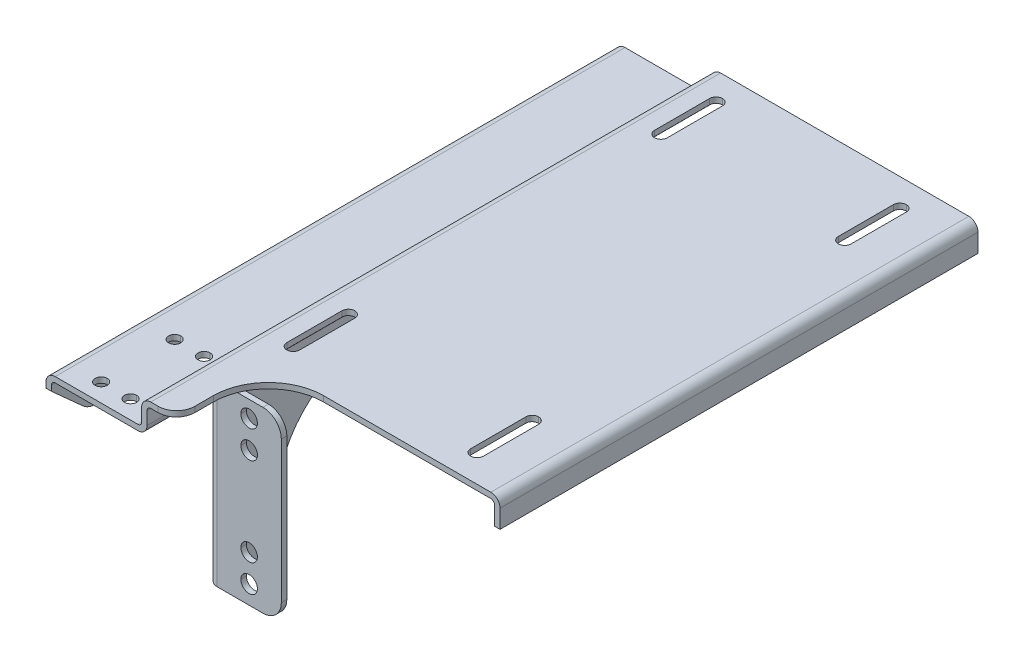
ISO-10303-21;
HEADER;
FILE_DESCRIPTION(('STEP AP214'),'2;1');
FILE_NAME('part.step','',(''),(''),'','','');
FILE_SCHEMA(('AUTOMOTIVE_DESIGN { 1 0 10303 214 1 1 1 1 }'));
ENDSEC;
DATA;
#1=APPLICATION_CONTEXT('core data for automotive mechanical design processes');
#2=APPLICATION_PROTOCOL_DEFINITION('international standard','automotive_design',2000,#1);
#3=PRODUCT_CONTEXT('',#1,'mechanical');
#4=PRODUCT('Part','Part','',(#3));
#5=PRODUCT_RELATED_PRODUCT_CATEGORY('part','',(#4));
#6=PRODUCT_DEFINITION_FORMATION('','',#4);
#7=PRODUCT_DEFINITION_CONTEXT('part definition',#1,'design');
#8=PRODUCT_DEFINITION('design','',#6,#7);
#9=PRODUCT_DEFINITION_SHAPE('','',#8);
#10=(LENGTH_UNIT() NAMED_UNIT(*) SI_UNIT(.MILLI.,.METRE.));
#11=(NAMED_UNIT(*) PLANE_ANGLE_UNIT() SI_UNIT($,.RADIAN.));
#12=(NAMED_UNIT(*) SI_UNIT($,.STERADIAN.) SOLID_ANGLE_UNIT());
#13=UNCERTAINTY_MEASURE_WITH_UNIT(LENGTH_MEASURE(1.E-05),#10,'distance_accuracy_value','');
#14=(GEOMETRIC_REPRESENTATION_CONTEXT(3) GLOBAL_UNCERTAINTY_ASSIGNED_CONTEXT((#13)) GLOBAL_UNIT_ASSIGNED_CONTEXT((#10,
#11,#12)) REPRESENTATION_CONTEXT('',''));
#15=CARTESIAN_POINT('',(0.,0.,0.));
#16=DIRECTION('',(0.,0.,1.));
#17=DIRECTION('',(1.,0.,0.));
#18=AXIS2_PLACEMENT_3D('',#15,#16,#17);
#19=CARTESIAN_POINT('',(-48.8408551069,-7.,-265.));
#20=DIRECTION('',(0.,1.,0.));
#21=DIRECTION('',(0.,0.,1.));
#22=AXIS2_PLACEMENT_3D('',#19,#20,#21);
#23=CYLINDRICAL_SURFACE('',#22,3.5);
#24=CARTESIAN_POINT('',(-48.8408551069,0.,-265.));
#25=DIRECTION('',(0.,1.,0.));
#26=DIRECTION('',(1.,0.,0.));
#27=AXIS2_PLACEMENT_3D('',#24,#25,#26);
#28=CIRCLE('',#27,3.5);
#29=CARTESIAN_POINT('',(-48.8408551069,0.,-261.5));
#30=VERTEX_POINT('',#29);
#31=CARTESIAN_POINT('',(-45.3408551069,0.,-265.));
#32=VERTEX_POINT('',#31);
#33=EDGE_CURVE('P0_E40',#30,#32,#28,.T.);
#34=ORIENTED_EDGE('',*,*,#33,.F.);
#35=DIRECTION('',(0.,1.,0.));
#36=VECTOR('',#35,1.);
#37=CARTESIAN_POINT('',(-48.8408551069,-7.,-261.5));
#38=LINE('',#37,#36);
#39=CARTESIAN_POINT('',(-48.8408551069,3.,-261.5));
#40=VERTEX_POINT('',#39);
#41=EDGE_CURVE('P0_E11',#30,#40,#38,.T.);
#42=ORIENTED_EDGE('',*,*,#41,.T.);
#43=CARTESIAN_POINT('',(-48.8408551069,3.,-265.));
#44=DIRECTION('',(0.,-1.,0.));
#45=DIRECTION('',(1.,0.,0.));
#46=AXIS2_PLACEMENT_3D('',#43,#44,#45);
#47=CIRCLE('',#46,3.5);
#48=CARTESIAN_POINT('',(-45.3408551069,3.,-265.));
#49=VERTEX_POINT('',#48);
#50=EDGE_CURVE('P0_E655',#49,#40,#47,.T.);
#51=ORIENTED_EDGE('',*,*,#50,.F.);
#52=DIRECTION('',(0.,1.,0.));
#53=VECTOR('',#52,1.);
#54=CARTESIAN_POINT('',(-45.3408551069,-7.,-265.));
#55=LINE('',#54,#53);
#56=EDGE_CURVE('P0_E840',#32,#49,#55,.T.);
#57=ORIENTED_EDGE('',*,*,#56,.F.);
#58=EDGE_LOOP('',(#34,#42,#51,#57));
#59=FACE_BOUND('',#58,.T.);
#60=ADVANCED_FACE('P0_F16',(#59),#23,.F.);
#61=CARTESIAN_POINT('',(-63.3408551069,0.,-310.));
#62=DIRECTION('',(0.,1.,0.));
#63=DIRECTION('',(1.,0.,0.));
#64=AXIS2_PLACEMENT_3D('',#61,#62,#63);
#65=PLANE('',#64);
#66=CARTESIAN_POINT('',(-17.3408551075,0.,-20.0000000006));
#67=DIRECTION('',(0.,1.,0.));
#68=DIRECTION('',(1.,0.,0.));
#69=AXIS2_PLACEMENT_3D('',#66,#67,#68);
#70=CIRCLE('',#69,29.9999999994);
#71=CARTESIAN_POINT('',(-17.3408551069,0.,-50.));
#72=VERTEX_POINT('',#71);
#73=CARTESIAN_POINT('',(-47.3408551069,0.,-20.));
#74=VERTEX_POINT('',#73);
#75=EDGE_CURVE('P0_E27',#72,#74,#70,.T.);
#76=ORIENTED_EDGE('',*,*,#75,.T.);
#77=DIRECTION('',(0.,0.,1.));
#78=VECTOR('',#77,1.);
#79=CARTESIAN_POINT('',(-47.3408551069,0.,-15.));
#80=LINE('',#79,#78);
#81=CARTESIAN_POINT('',(-47.3408551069,0.,-10.));
#82=VERTEX_POINT('',#81);
#83=EDGE_CURVE('P0_E1735',#74,#82,#80,.T.);
#84=ORIENTED_EDGE('',*,*,#83,.T.);
#85=CARTESIAN_POINT('',(-57.3408551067,0.,-9.99999999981));
#86=DIRECTION('',(0.,1.,0.));
#87=DIRECTION('',(1.,0.,0.));
#88=AXIS2_PLACEMENT_3D('',#85,#86,#87);
#89=CIRCLE('',#88,9.99999999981);
#90=CARTESIAN_POINT('',(-57.3408551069,0.,0.));
#91=VERTEX_POINT('',#90);
#92=EDGE_CURVE('P0_E1502',#91,#82,#89,.T.);
#93=ORIENTED_EDGE('',*,*,#92,.F.);
#94=DIRECTION('',(1.,0.,0.));
#95=VECTOR('',#94,1.);
#96=CARTESIAN_POINT('',(-59.3408551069,0.,0.));
#97=LINE('',#96,#95);
#98=CARTESIAN_POINT('',(-61.3408551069,0.,0.));
#99=VERTEX_POINT('',#98);
#100=EDGE_CURVE('P0_E675',#99,#91,#97,.T.);
#101=ORIENTED_EDGE('',*,*,#100,.F.);
#102=DIRECTION('',(0.,0.,1.));
#103=VECTOR('',#102,1.);
#104=CARTESIAN_POINT('',(-61.3408551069,0.,-155.));
#105=LINE('',#104,#103);
#106=CARTESIAN_POINT('',(-61.3408551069,0.,-310.));
#107=VERTEX_POINT('',#106);
#108=EDGE_CURVE('P0_E608',#107,#99,#105,.T.);
#109=ORIENTED_EDGE('',*,*,#108,.F.);
#110=DIRECTION('',(-1.,0.,0.));
#111=VECTOR('',#110,1.);
#112=CARTESIAN_POINT('',(6.15914489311,0.,-310.));
#113=LINE('',#112,#111);
#114=CARTESIAN_POINT('',(73.6591448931,0.,-310.));
#115=VERTEX_POINT('',#114);
#116=EDGE_CURVE('P0_E1812',#115,#107,#113,.T.);
#117=ORIENTED_EDGE('',*,*,#116,.F.);
#118=DIRECTION('',(0.,0.,-1.));
#119=VECTOR('',#118,1.);
#120=CARTESIAN_POINT('',(73.6591448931,0.,-180.));
#121=LINE('',#120,#119);
#122=CARTESIAN_POINT('',(73.6591448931,0.,-50.));
#123=VERTEX_POINT('',#122);
#124=EDGE_CURVE('P0_E1806',#123,#115,#121,.T.);
#125=ORIENTED_EDGE('',*,*,#124,.F.);
#126=DIRECTION('',(-1.,0.,0.));
#127=VECTOR('',#126,1.);
#128=CARTESIAN_POINT('',(28.1591448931,0.,-50.));
#129=LINE('',#128,#127);
#130=EDGE_CURVE('P0_E1075',#123,#72,#129,.T.);
#131=ORIENTED_EDGE('',*,*,#130,.T.);
#132=EDGE_LOOP('',(#76,#84,#93,#101,#109,#117,#125,#131));
#133=FACE_BOUND('',#132,.T.);
#134=CARTESIAN_POINT('',(-48.8408551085,0.,-264.999999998));
#135=DIRECTION('',(0.,1.,0.));
#136=DIRECTION('',(1.,0.,0.));
#137=AXIS2_PLACEMENT_3D('',#134,#135,#136);
#138=CIRCLE('',#137,3.49999999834);
#139=CARTESIAN_POINT('',(-52.3408551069,0.,-265.));
#140=VERTEX_POINT('',#139);
#141=EDGE_CURVE('P0_E1068',#140,#30,#138,.T.);
#142=ORIENTED_EDGE('',*,*,#141,.T.);
#143=ORIENTED_EDGE('',*,*,#33,.T.);
#144=DIRECTION('',(0.,0.,-1.));
#145=VECTOR('',#144,1.);
#146=CARTESIAN_POINT('',(-45.3408551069,0.,-280.));
#147=LINE('',#146,#145);
#148=CARTESIAN_POINT('',(-45.3408551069,0.,-295.));
#149=VERTEX_POINT('',#148);
#150=EDGE_CURVE('P0_E931',#32,#149,#147,.T.);
#151=ORIENTED_EDGE('',*,*,#150,.T.);
#152=CARTESIAN_POINT('',(-48.8408551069,0.,-295.));
#153=DIRECTION('',(0.,1.,0.));
#154=DIRECTION('',(1.,0.,0.));
#155=AXIS2_PLACEMENT_3D('',#152,#153,#154);
#156=CIRCLE('',#155,3.5);
#157=CARTESIAN_POINT('',(-48.8408551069,0.,-298.5));
#158=VERTEX_POINT('',#157);
#159=EDGE_CURVE('P0_E681',#149,#158,#156,.T.);
#160=ORIENTED_EDGE('',*,*,#159,.T.);
#161=CARTESIAN_POINT('',(-48.8408551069,0.,-295.));
#162=DIRECTION('',(0.,1.,0.));
#163=DIRECTION('',(1.,0.,0.));
#164=AXIS2_PLACEMENT_3D('',#161,#162,#163);
#165=CIRCLE('',#164,3.5);
#166=CARTESIAN_POINT('',(-52.3408551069,0.,-295.));
#167=VERTEX_POINT('',#166);
#168=EDGE_CURVE('P0_E677',#158,#167,#165,.T.);
#169=ORIENTED_EDGE('',*,*,#168,.T.);
#170=DIRECTION('',(0.,0.,1.));
#171=VECTOR('',#170,1.);
#172=CARTESIAN_POINT('',(-52.3408551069,0.,-280.));
#173=LINE('',#172,#171);
#174=EDGE_CURVE('P0_E682',#167,#140,#173,.T.);
#175=ORIENTED_EDGE('',*,*,#174,.T.);
#176=EDGE_LOOP('',(#142,#143,#151,#160,#169,#175));
#177=FACE_BOUND('',#176,.T.);
#178=CARTESIAN_POINT('',(51.1591448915,0.,-264.999999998));
#179=DIRECTION('',(0.,1.,0.));
#180=DIRECTION('',(1.,0.,0.));
#181=AXIS2_PLACEMENT_3D('',#178,#179,#180);
#182=CIRCLE('',#181,3.49999999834);
#183=CARTESIAN_POINT('',(47.6591448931,0.,-265.));
#184=VERTEX_POINT('',#183);
#185=CARTESIAN_POINT('',(51.1591448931,0.,-261.5));
#186=VERTEX_POINT('',#185);
#187=EDGE_CURVE('P0_E867',#184,#186,#182,.T.);
#188=ORIENTED_EDGE('',*,*,#187,.T.);
#189=CARTESIAN_POINT('',(51.1591448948,0.,-264.999999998));
#190=DIRECTION('',(0.,1.,0.));
#191=DIRECTION('',(1.,0.,0.));
#192=AXIS2_PLACEMENT_3D('',#189,#190,#191);
#193=CIRCLE('',#192,3.49999999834);
#194=CARTESIAN_POINT('',(54.6591448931,0.,-265.));
#195=VERTEX_POINT('',#194);
#196=EDGE_CURVE('P0_E871',#186,#195,#193,.T.);
#197=ORIENTED_EDGE('',*,*,#196,.T.);
#198=DIRECTION('',(0.,0.,-1.));
#199=VECTOR('',#198,1.);
#200=CARTESIAN_POINT('',(54.6591448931,0.,-280.));
#201=LINE('',#200,#199);
#202=CARTESIAN_POINT('',(54.6591448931,0.,-295.));
#203=VERTEX_POINT('',#202);
#204=EDGE_CURVE('P0_E932',#195,#203,#201,.T.);
#205=ORIENTED_EDGE('',*,*,#204,.T.);
#206=CARTESIAN_POINT('',(51.1591448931,0.,-295.));
#207=DIRECTION('',(0.,1.,0.));
#208=DIRECTION('',(1.,0.,0.));
#209=AXIS2_PLACEMENT_3D('',#206,#207,#208);
#210=CIRCLE('',#209,3.5);
#211=CARTESIAN_POINT('',(51.1591448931,0.,-298.5));
#212=VERTEX_POINT('',#211);
#213=EDGE_CURVE('P0_E936',#203,#212,#210,.T.);
#214=ORIENTED_EDGE('',*,*,#213,.T.);
#215=CARTESIAN_POINT('',(51.1591448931,0.,-295.));
#216=DIRECTION('',(0.,1.,0.));
#217=DIRECTION('',(1.,0.,0.));
#218=AXIS2_PLACEMENT_3D('',#215,#216,#217);
#219=CIRCLE('',#218,3.5);
#220=CARTESIAN_POINT('',(47.6591448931,0.,-295.));
#221=VERTEX_POINT('',#220);
#222=EDGE_CURVE('P0_E780',#212,#221,#219,.T.);
#223=ORIENTED_EDGE('',*,*,#222,.T.);
#224=DIRECTION('',(0.,0.,1.));
#225=VECTOR('',#224,1.);
#226=CARTESIAN_POINT('',(47.6591448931,0.,-280.));
#227=LINE('',#226,#225);
#228=EDGE_CURVE('P0_E776',#221,#184,#227,.T.);
#229=ORIENTED_EDGE('',*,*,#228,.T.);
#230=EDGE_LOOP('',(#188,#197,#205,#214,#223,#229));
#231=FACE_BOUND('',#230,.T.);
#232=DIRECTION('',(0.,0.,1.));
#233=VECTOR('',#232,1.);
#234=CARTESIAN_POINT('',(47.6591448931,0.,-80.));
#235=LINE('',#234,#233);
#236=CARTESIAN_POINT('',(47.6591448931,0.,-95.));
#237=VERTEX_POINT('',#236);
#238=CARTESIAN_POINT('',(47.6591448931,0.,-65.));
#239=VERTEX_POINT('',#238);
#240=EDGE_CURVE('P0_E781',#237,#239,#235,.T.);
#241=ORIENTED_EDGE('',*,*,#240,.T.);
#242=CARTESIAN_POINT('',(51.1591448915,0.,-64.9999999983));
#243=DIRECTION('',(0.,1.,0.));
#244=DIRECTION('',(1.,0.,0.));
#245=AXIS2_PLACEMENT_3D('',#242,#243,#244);
#246=CIRCLE('',#245,3.49999999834);
#247=CARTESIAN_POINT('',(51.1591448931,0.,-61.5));
#248=VERTEX_POINT('',#247);
#249=EDGE_CURVE('P0_E884',#239,#248,#246,.T.);
#250=ORIENTED_EDGE('',*,*,#249,.T.);
#251=CARTESIAN_POINT('',(51.1591448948,0.,-64.9999999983));
#252=DIRECTION('',(0.,1.,0.));
#253=DIRECTION('',(1.,0.,0.));
#254=AXIS2_PLACEMENT_3D('',#251,#252,#253);
#255=CIRCLE('',#254,3.49999999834);
#256=CARTESIAN_POINT('',(54.6591448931,0.,-65.));
#257=VERTEX_POINT('',#256);
#258=EDGE_CURVE('P0_E880',#248,#257,#255,.T.);
#259=ORIENTED_EDGE('',*,*,#258,.T.);
#260=DIRECTION('',(0.,0.,-1.));
#261=VECTOR('',#260,1.);
#262=CARTESIAN_POINT('',(54.6591448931,0.,-80.));
#263=LINE('',#262,#261);
#264=CARTESIAN_POINT('',(54.6591448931,0.,-95.));
#265=VERTEX_POINT('',#264);
#266=EDGE_CURVE('P0_E885',#257,#265,#263,.T.);
#267=ORIENTED_EDGE('',*,*,#266,.T.);
#268=CARTESIAN_POINT('',(51.1591448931,0.,-95.));
#269=DIRECTION('',(0.,1.,0.));
#270=DIRECTION('',(1.,0.,0.));
#271=AXIS2_PLACEMENT_3D('',#268,#269,#270);
#272=CIRCLE('',#271,3.5);
#273=CARTESIAN_POINT('',(51.1591448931,0.,-98.5));
#274=VERTEX_POINT('',#273);
#275=EDGE_CURVE('P0_E774',#265,#274,#272,.T.);
#276=ORIENTED_EDGE('',*,*,#275,.T.);
#277=CARTESIAN_POINT('',(51.1591448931,0.,-95.));
#278=DIRECTION('',(0.,1.,0.));
#279=DIRECTION('',(1.,0.,0.));
#280=AXIS2_PLACEMENT_3D('',#277,#278,#279);
#281=CIRCLE('',#280,3.5);
#282=EDGE_CURVE('P0_E771',#274,#237,#281,.T.);
#283=ORIENTED_EDGE('',*,*,#282,.T.);
#284=EDGE_LOOP('',(#241,#250,#259,#267,#276,#283));
#285=FACE_BOUND('',#284,.T.);
#286=DIRECTION('',(0.,0.,1.));
#287=VECTOR('',#286,1.);
#288=CARTESIAN_POINT('',(-52.3408551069,0.,-80.));
#289=LINE('',#288,#287);
#290=CARTESIAN_POINT('',(-52.3408551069,0.,-95.));
#291=VERTEX_POINT('',#290);
#292=CARTESIAN_POINT('',(-52.3408551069,0.,-65.));
#293=VERTEX_POINT('',#292);
#294=EDGE_CURVE('P0_E775',#291,#293,#289,.T.);
#295=ORIENTED_EDGE('',*,*,#294,.T.);
#296=CARTESIAN_POINT('',(-48.8408551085,0.,-64.9999999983));
#297=DIRECTION('',(0.,1.,0.));
#298=DIRECTION('',(1.,0.,0.));
#299=AXIS2_PLACEMENT_3D('',#296,#297,#298);
#300=CIRCLE('',#299,3.49999999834);
#301=CARTESIAN_POINT('',(-48.8408551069,0.,-61.5));
#302=VERTEX_POINT('',#301);
#303=EDGE_CURVE('P0_E661',#293,#302,#300,.T.);
#304=ORIENTED_EDGE('',*,*,#303,.T.);
#305=CARTESIAN_POINT('',(-48.8408551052,0.,-64.9999999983));
#306=DIRECTION('',(0.,1.,0.));
#307=DIRECTION('',(1.,0.,0.));
#308=AXIS2_PLACEMENT_3D('',#305,#306,#307);
#309=CIRCLE('',#308,3.49999999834);
#310=CARTESIAN_POINT('',(-45.3408551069,0.,-65.));
#311=VERTEX_POINT('',#310);
#312=EDGE_CURVE('P0_E657',#302,#311,#309,.T.);
#313=ORIENTED_EDGE('',*,*,#312,.T.);
#314=DIRECTION('',(0.,0.,-1.));
#315=VECTOR('',#314,1.);
#316=CARTESIAN_POINT('',(-45.3408551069,0.,-80.));
#317=LINE('',#316,#315);
#318=CARTESIAN_POINT('',(-45.3408551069,0.,-95.));
#319=VERTEX_POINT('',#318);
#320=EDGE_CURVE('P0_E662',#311,#319,#317,.T.);
#321=ORIENTED_EDGE('',*,*,#320,.T.);
#322=CARTESIAN_POINT('',(-48.8408551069,0.,-95.));
#323=DIRECTION('',(0.,1.,0.));
#324=DIRECTION('',(1.,0.,0.));
#325=AXIS2_PLACEMENT_3D('',#322,#323,#324);
#326=CIRCLE('',#325,3.5);
#327=CARTESIAN_POINT('',(-48.8408551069,0.,-98.5));
#328=VERTEX_POINT('',#327);
#329=EDGE_CURVE('P0_E1036',#319,#328,#326,.T.);
#330=ORIENTED_EDGE('',*,*,#329,.T.);
#331=CARTESIAN_POINT('',(-48.8408551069,0.,-95.));
#332=DIRECTION('',(0.,1.,0.));
#333=DIRECTION('',(1.,0.,0.));
#334=AXIS2_PLACEMENT_3D('',#331,#332,#333);
#335=CIRCLE('',#334,3.5);
#336=EDGE_CURVE('P0_E901',#328,#291,#335,.T.);
#337=ORIENTED_EDGE('',*,*,#336,.T.);
#338=EDGE_LOOP('',(#295,#304,#313,#321,#330,#337));
#339=FACE_BOUND('',#338,.T.);
#340=ADVANCED_FACE('P0_F1150',(#133,#177,#231,#285,#339),#65,.F.);
#341=CARTESIAN_POINT('',(-48.8408551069,-7.,-265.));
#342=DIRECTION('',(0.,1.,0.));
#343=DIRECTION('',(0.,0.,-1.));
#344=AXIS2_PLACEMENT_3D('',#341,#342,#343);
#345=CYLINDRICAL_SURFACE('',#344,3.5);
#346=ORIENTED_EDGE('',*,*,#41,.F.);
#347=ORIENTED_EDGE('',*,*,#141,.F.);
#348=DIRECTION('',(0.,1.,0.));
#349=VECTOR('',#348,1.);
#350=CARTESIAN_POINT('',(-52.3408551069,-7.,-265.));
#351=LINE('',#350,#349);
#352=CARTESIAN_POINT('',(-52.3408551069,3.,-265.));
#353=VERTEX_POINT('',#352);
#354=EDGE_CURVE('P0_E897',#140,#353,#351,.T.);
#355=ORIENTED_EDGE('',*,*,#354,.T.);
#356=CARTESIAN_POINT('',(-48.8408551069,3.,-265.));
#357=DIRECTION('',(0.,-1.,0.));
#358=DIRECTION('',(1.,0.,0.));
#359=AXIS2_PLACEMENT_3D('',#356,#357,#358);
#360=CIRCLE('',#359,3.5);
#361=EDGE_CURVE('P0_E651',#40,#353,#360,.T.);
#362=ORIENTED_EDGE('',*,*,#361,.F.);
#363=EDGE_LOOP('',(#346,#347,#355,#362));
#364=FACE_BOUND('',#363,.T.);
#365=ADVANCED_FACE('P0_F1147',(#364),#345,.F.);
#366=CARTESIAN_POINT('',(-63.3408551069,3.,-310.));
#367=DIRECTION('',(0.,1.,0.));
#368=DIRECTION('',(1.,0.,0.));
#369=AXIS2_PLACEMENT_3D('',#366,#367,#368);
#370=PLANE('',#369);
#371=DIRECTION('',(-1.,0.,0.));
#372=VECTOR('',#371,1.);
#373=CARTESIAN_POINT('',(6.15914489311,3.,-310.));
#374=LINE('',#373,#372);
#375=CARTESIAN_POINT('',(73.6591448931,3.,-310.));
#376=VERTEX_POINT('',#375);
#377=CARTESIAN_POINT('',(-61.3408551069,3.,-310.));
#378=VERTEX_POINT('',#377);
#379=EDGE_CURVE('P0_E902',#376,#378,#374,.T.);
#380=ORIENTED_EDGE('',*,*,#379,.T.);
#381=DIRECTION('',(0.,0.,1.));
#382=VECTOR('',#381,1.);
#383=CARTESIAN_POINT('',(-61.3408551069,3.,-155.));
#384=LINE('',#383,#382);
#385=CARTESIAN_POINT('',(-61.3408551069,3.,0.));
#386=VERTEX_POINT('',#385);
#387=EDGE_CURVE('P0_E726',#378,#386,#384,.T.);
#388=ORIENTED_EDGE('',*,*,#387,.T.);
#389=DIRECTION('',(1.,0.,0.));
#390=VECTOR('',#389,1.);
#391=CARTESIAN_POINT('',(-59.3408551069,3.,0.));
#392=LINE('',#391,#390);
#393=CARTESIAN_POINT('',(-57.3408551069,3.,0.));
#394=VERTEX_POINT('',#393);
#395=EDGE_CURVE('P0_E719',#386,#394,#392,.T.);
#396=ORIENTED_EDGE('',*,*,#395,.T.);
#397=CARTESIAN_POINT('',(-57.3408551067,3.,-9.99999999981));
#398=DIRECTION('',(0.,1.,0.));
#399=DIRECTION('',(1.,0.,0.));
#400=AXIS2_PLACEMENT_3D('',#397,#398,#399);
#401=CIRCLE('',#400,9.99999999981);
#402=CARTESIAN_POINT('',(-47.3408551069,3.,-10.));
#403=VERTEX_POINT('',#402);
#404=EDGE_CURVE('P0_E727',#394,#403,#401,.T.);
#405=ORIENTED_EDGE('',*,*,#404,.T.);
#406=DIRECTION('',(0.,0.,-1.));
#407=VECTOR('',#406,1.);
#408=CARTESIAN_POINT('',(-47.3408551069,3.,-15.));
#409=LINE('',#408,#407);
#410=CARTESIAN_POINT('',(-47.3408551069,3.,-20.));
#411=VERTEX_POINT('',#410);
#412=EDGE_CURVE('P0_E1487',#403,#411,#409,.T.);
#413=ORIENTED_EDGE('',*,*,#412,.T.);
#414=CARTESIAN_POINT('',(-47.3408551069,3.,-20.));
#415=CARTESIAN_POINT('',(-47.3408551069,3.,-22.9543915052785));
#416=CARTESIAN_POINT('',(-46.7644142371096,3.,-25.852631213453));
#417=CARTESIAN_POINT('',(-46.1881268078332,3.,-28.75009945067));
#418=CARTESIAN_POINT('',(-45.0572765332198,3.,-31.480405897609));
#419=CARTESIAN_POINT('',(-43.9268428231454,3.,-34.209706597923));
#420=CARTESIAN_POINT('',(-42.2850579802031,3.,-36.6669280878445));
#421=CARTESIAN_POINT('',(-40.6438790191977,3.,-39.1232427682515));
#422=CARTESIAN_POINT('',(-38.554217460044,3.,-41.2130236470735));
#423=CARTESIAN_POINT('',(-36.4653437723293,3.,-43.3020166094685));
#424=CARTESIAN_POINT('',(-34.0082239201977,3.,-44.943913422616));
#425=CARTESIAN_POINT('',(-31.5520070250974,3.,-46.5852068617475));
#426=CARTESIAN_POINT('',(-28.8217157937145,3.,-47.7162221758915));
#427=CARTESIAN_POINT('',(-26.0924037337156,3.,-48.846831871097));
#428=CARTESIAN_POINT('',(-23.1939744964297,3.,-49.4234722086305));
#429=CARTESIAN_POINT('',(-20.2961109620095,3.,-50.));
#430=CARTESIAN_POINT('',(-17.3408551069,3.,-50.));
#431=B_SPLINE_CURVE_WITH_KNOTS('',2,(#414,#415,#416,#417,#418,#419,#420,#421,#422,#423,#424,
#425,#426,#427,#428,#429,#430),.UNSPECIFIED.,.F.,.F.,(3,2,2,2,2,2,2,2,3),(0.,0.125,0.25,0.375,
0.5,0.625,0.75,0.875,1.),.UNSPECIFIED.);
#432=CARTESIAN_POINT('',(-17.3408551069,3.,-50.));
#433=VERTEX_POINT('',#432);
#434=EDGE_CURVE('P0_E1129',#411,#433,#431,.T.);
#435=ORIENTED_EDGE('',*,*,#434,.T.);
#436=DIRECTION('',(1.,0.,0.));
#437=VECTOR('',#436,1.);
#438=CARTESIAN_POINT('',(28.1591448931,3.,-50.));
#439=LINE('',#438,#437);
#440=CARTESIAN_POINT('',(73.6591448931,3.,-50.));
#441=VERTEX_POINT('',#440);
#442=EDGE_CURVE('P0_E1505',#433,#441,#439,.T.);
#443=ORIENTED_EDGE('',*,*,#442,.T.);
#444=DIRECTION('',(0.,0.,-1.));
#445=VECTOR('',#444,1.);
#446=CARTESIAN_POINT('',(73.6591448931,3.,-180.));
#447=LINE('',#446,#445);
#448=EDGE_CURVE('P0_E1041',#441,#376,#447,.T.);
#449=ORIENTED_EDGE('',*,*,#448,.T.);
#450=EDGE_LOOP('',(#380,#388,#396,#405,#413,#435,#443,#449));
#451=FACE_BOUND('',#450,.T.);
#452=DIRECTION('',(0.,0.,1.));
#453=VECTOR('',#452,1.);
#454=CARTESIAN_POINT('',(-45.3408551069,3.,-280.));
#455=LINE('',#454,#453);
#456=CARTESIAN_POINT('',(-45.3408551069,3.,-295.));
#457=VERTEX_POINT('',#456);
#458=EDGE_CURVE('P0_E1037',#457,#49,#455,.T.);
#459=ORIENTED_EDGE('',*,*,#458,.T.);
#460=ORIENTED_EDGE('',*,*,#50,.T.);
#461=ORIENTED_EDGE('',*,*,#361,.T.);
#462=DIRECTION('',(0.,0.,-1.));
#463=VECTOR('',#462,1.);
#464=CARTESIAN_POINT('',(-52.3408551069,3.,-280.));
#465=LINE('',#464,#463);
#466=CARTESIAN_POINT('',(-52.3408551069,3.,-295.));
#467=VERTEX_POINT('',#466);
#468=EDGE_CURVE('P0_E656',#353,#467,#465,.T.);
#469=ORIENTED_EDGE('',*,*,#468,.T.);
#470=CARTESIAN_POINT('',(-52.3408551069,3.,-295.));
#471=CARTESIAN_POINT('',(-52.3408551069,3.,-295.366601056));
#472=CARTESIAN_POINT('',(-52.2928564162,3.,-295.733201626));
#473=CARTESIAN_POINT('',(-52.1968417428,3.,-296.091445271));
#474=CARTESIAN_POINT('',(-51.9132915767,3.,-296.774381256));
#475=CARTESIAN_POINT('',(-51.4634819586,3.,-297.361297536));
#476=CARTESIAN_POINT('',(-51.2011764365,3.,-297.623505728));
#477=CARTESIAN_POINT('',(-50.6142997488,3.,-298.072937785));
#478=CARTESIAN_POINT('',(-49.9315368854,3.,-298.356190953));
#479=CARTESIAN_POINT('',(-49.5735362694,3.,-298.452069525));
#480=CARTESIAN_POINT('',(-49.207195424,3.,-298.500000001));
#481=CARTESIAN_POINT('',(-48.8408551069,3.,-298.500000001));
#482=(BOUNDED_CURVE() B_SPLINE_CURVE(5,(#470,#471,#472,#473,#474,#475,#476,#477,#478,#479,#480,
#481),.UNSPECIFIED.,.F.,.F.) B_SPLINE_CURVE_WITH_KNOTS((6,3,3,6),(0.,2.59226092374,
5.18452185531,7.7749390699),
.UNSPECIFIED.) CURVE() GEOMETRIC_REPRESENTATION_ITEM() RATIONAL_B_SPLINE_CURVE((1.,1.,1.,1.,1.,
1.,1.,1.,1.,1.,1.,1.)) REPRESENTATION_ITEM(''));
#483=CARTESIAN_POINT('',(-48.8408551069,3.,-298.5));
#484=VERTEX_POINT('',#483);
#485=EDGE_CURVE('P0_E1819',#467,#484,#482,.T.);
#486=ORIENTED_EDGE('',*,*,#485,.T.);
#487=CARTESIAN_POINT('',(-48.8408551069,3.,-298.500000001));
#488=CARTESIAN_POINT('',(-48.840594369,3.,-298.500000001));
#489=CARTESIAN_POINT('',(-48.8403336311,3.,-298.499999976));
#490=CARTESIAN_POINT('',(-48.8400728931,3.,-298.499999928));
#491=CARTESIAN_POINT('',(-48.4732111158,3.,-298.49989744));
#492=CARTESIAN_POINT('',(-48.1063677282,3.,-298.451727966));
#493=CARTESIAN_POINT('',(-47.7481598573,3.,-298.355579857));
#494=CARTESIAN_POINT('',(-47.0653295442,3.,-298.07177533));
#495=CARTESIAN_POINT('',(-46.4785808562,3.,-297.621747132));
#496=CARTESIAN_POINT('',(-46.216470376,3.,-297.359343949));
#497=CARTESIAN_POINT('',(-45.7674167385,3.,-296.772508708));
#498=CARTESIAN_POINT('',(-45.4844594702,3.,-296.089917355));
#499=CARTESIAN_POINT('',(-45.3887173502,3.,-295.732159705));
#500=CARTESIAN_POINT('',(-45.3408551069,3.,-295.366079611));
#501=CARTESIAN_POINT('',(-45.3408551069,3.,-295.));
#502=(BOUNDED_CURVE() B_SPLINE_CURVE(5,(#487,#488,#489,#490,#491,#492,#493,#494,#495,#496,#497,
#498,#499,#500,#501),.UNSPECIFIED.,.F.,.F.) B_SPLINE_CURVE_WITH_KNOTS((6,3,3,3,6),(7.7749390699,
7.77678276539,10.3690436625,12.9613045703,15.5498783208),
.UNSPECIFIED.) CURVE() GEOMETRIC_REPRESENTATION_ITEM() RATIONAL_B_SPLINE_CURVE((1.,1.,1.,1.,1.,
1.,1.,1.,1.,1.,1.,1.,1.,1.,1.)) REPRESENTATION_ITEM(''));
#503=EDGE_CURVE('P0_E1016',#484,#457,#502,.T.);
#504=ORIENTED_EDGE('',*,*,#503,.T.);
#505=EDGE_LOOP('',(#459,#460,#461,#469,#486,#504));
#506=FACE_BOUND('',#505,.T.);
#507=DIRECTION('',(0.,0.,1.));
#508=VECTOR('',#507,1.);
#509=CARTESIAN_POINT('',(54.6591448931,3.,-280.));
#510=LINE('',#509,#508);
#511=CARTESIAN_POINT('',(54.6591448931,3.,-295.));
#512=VERTEX_POINT('',#511);
#513=CARTESIAN_POINT('',(54.6591448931,3.,-265.));
#514=VERTEX_POINT('',#513);
#515=EDGE_CURVE('P0_E1012',#512,#514,#510,.T.);
#516=ORIENTED_EDGE('',*,*,#515,.T.);
#517=CARTESIAN_POINT('',(54.6591448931,3.,-265.));
#518=CARTESIAN_POINT('',(54.6591448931,3.,-264.633398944));
#519=CARTESIAN_POINT('',(54.6111462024,3.,-264.266798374));
#520=CARTESIAN_POINT('',(54.515131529,3.,-263.908554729));
#521=CARTESIAN_POINT('',(54.231581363,3.,-263.225618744));
#522=CARTESIAN_POINT('',(53.7817717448,3.,-262.638702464));
#523=CARTESIAN_POINT('',(53.5194662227,3.,-262.376494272));
#524=CARTESIAN_POINT('',(52.9325895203,3.,-261.927062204));
#525=CARTESIAN_POINT('',(52.2498266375,3.,-261.643809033));
#526=CARTESIAN_POINT('',(51.8918260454,3.,-261.547930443));
#527=CARTESIAN_POINT('',(51.5254852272,3.,-261.5));
#528=CARTESIAN_POINT('',(51.1591448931,3.,-261.5));
#529=(BOUNDED_CURVE() B_SPLINE_CURVE(5,(#517,#518,#519,#520,#521,#522,#523,#524,#525,#526,#527,
#528),.UNSPECIFIED.,.F.,.F.) B_SPLINE_CURVE_WITH_KNOTS((6,3,3,6),(0.,2.59226092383,
5.18452185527,7.77493919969),
.UNSPECIFIED.) CURVE() GEOMETRIC_REPRESENTATION_ITEM() RATIONAL_B_SPLINE_CURVE((1.,1.,1.,1.,1.,
1.,1.,1.,1.,1.,1.,1.)) REPRESENTATION_ITEM(''));
#530=CARTESIAN_POINT('',(51.1591448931,3.,-261.5));
#531=VERTEX_POINT('',#530);
#532=EDGE_CURVE('P0_E1017',#514,#531,#529,.T.);
#533=ORIENTED_EDGE('',*,*,#532,.T.);
#534=CARTESIAN_POINT('',(51.1591448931,3.,-261.5));
#535=CARTESIAN_POINT('',(50.7925438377,3.,-261.5));
#536=CARTESIAN_POINT('',(50.4259432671,3.,-261.547998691));
#537=CARTESIAN_POINT('',(50.0676996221,3.,-261.644013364));
#538=CARTESIAN_POINT('',(49.3847636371,3.,-261.92756353));
#539=CARTESIAN_POINT('',(48.7978473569,3.,-262.377373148));
#540=CARTESIAN_POINT('',(48.5356391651,3.,-262.63967867));
#541=CARTESIAN_POINT('',(48.0862070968,3.,-263.226555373));
#542=CARTESIAN_POINT('',(47.8029539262,3.,-263.909318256));
#543=CARTESIAN_POINT('',(47.7070753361,3.,-264.267318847));
#544=CARTESIAN_POINT('',(47.6591448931,3.,-264.633659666));
#545=CARTESIAN_POINT('',(47.6591448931,3.,-265.));
#546=(BOUNDED_CURVE() B_SPLINE_CURVE(5,(#534,#535,#536,#537,#538,#539,#540,#541,#542,#543,#544,
#545),.UNSPECIFIED.,.F.,.F.) B_SPLINE_CURVE_WITH_KNOTS((6,3,3,6),(0.,2.59226092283,
5.18452185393,7.77493919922),
.UNSPECIFIED.) CURVE() GEOMETRIC_REPRESENTATION_ITEM() RATIONAL_B_SPLINE_CURVE((1.,1.,1.,1.,1.,
1.,1.,1.,1.,1.,1.,1.)) REPRESENTATION_ITEM(''));
#547=CARTESIAN_POINT('',(47.6591448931,3.,-265.));
#548=VERTEX_POINT('',#547);
#549=EDGE_CURVE('P0_E879',#531,#548,#546,.T.);
#550=ORIENTED_EDGE('',*,*,#549,.T.);
#551=DIRECTION('',(0.,0.,-1.));
#552=VECTOR('',#551,1.);
#553=CARTESIAN_POINT('',(47.6591448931,3.,-280.));
#554=LINE('',#553,#552);
#555=CARTESIAN_POINT('',(47.6591448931,3.,-295.));
#556=VERTEX_POINT('',#555);
#557=EDGE_CURVE('P0_E875',#548,#556,#554,.T.);
#558=ORIENTED_EDGE('',*,*,#557,.T.);
#559=CARTESIAN_POINT('',(47.6591448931,3.,-295.));
#560=CARTESIAN_POINT('',(47.6591448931,3.,-295.366601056));
#561=CARTESIAN_POINT('',(47.7071435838,3.,-295.733201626));
#562=CARTESIAN_POINT('',(47.8031582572,3.,-296.091445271));
#563=CARTESIAN_POINT('',(48.0867084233,3.,-296.774381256));
#564=CARTESIAN_POINT('',(48.5365180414,3.,-297.361297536));
#565=CARTESIAN_POINT('',(48.7988235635,3.,-297.623505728));
#566=CARTESIAN_POINT('',(49.3857002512,3.,-298.072937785));
#567=CARTESIAN_POINT('',(50.0684631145,3.,-298.356190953));
#568=CARTESIAN_POINT('',(50.4264637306,3.,-298.452069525));
#569=CARTESIAN_POINT('',(50.792804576,3.,-298.500000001));
#570=CARTESIAN_POINT('',(51.1591448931,3.,-298.500000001));
#571=(BOUNDED_CURVE() B_SPLINE_CURVE(5,(#559,#560,#561,#562,#563,#564,#565,#566,#567,#568,#569,
#570),.UNSPECIFIED.,.F.,.F.) B_SPLINE_CURVE_WITH_KNOTS((6,3,3,6),(0.,2.59226092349,
5.18452185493,7.77493906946),
.UNSPECIFIED.) CURVE() GEOMETRIC_REPRESENTATION_ITEM() RATIONAL_B_SPLINE_CURVE((1.,1.,1.,1.,1.,
1.,1.,1.,1.,1.,1.,1.)) REPRESENTATION_ITEM(''));
#572=CARTESIAN_POINT('',(51.1591448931,3.,-298.5));
#573=VERTEX_POINT('',#572);
#574=EDGE_CURVE('P0_E791',#556,#573,#571,.T.);
#575=ORIENTED_EDGE('',*,*,#574,.T.);
#576=CARTESIAN_POINT('',(51.1591448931,3.,-298.500000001));
#577=CARTESIAN_POINT('',(51.159405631,3.,-298.500000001));
#578=CARTESIAN_POINT('',(51.1596663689,3.,-298.499999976));
#579=CARTESIAN_POINT('',(51.1599271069,3.,-298.499999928));
#580=CARTESIAN_POINT('',(51.5267888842,3.,-298.49989744));
#581=CARTESIAN_POINT('',(51.8936322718,3.,-298.451727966));
#582=CARTESIAN_POINT('',(52.2518401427,3.,-298.355579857));
#583=CARTESIAN_POINT('',(52.9346704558,3.,-298.071775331));
#584=CARTESIAN_POINT('',(53.5214191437,3.,-297.621747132));
#585=CARTESIAN_POINT('',(53.783529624,3.,-297.359343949));
#586=CARTESIAN_POINT('',(54.2325832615,3.,-296.772508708));
#587=CARTESIAN_POINT('',(54.5155405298,3.,-296.089917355));
#588=CARTESIAN_POINT('',(54.6112826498,3.,-295.732159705));
#589=CARTESIAN_POINT('',(54.6591448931,3.,-295.366079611));
#590=CARTESIAN_POINT('',(54.6591448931,3.,-295.));
#591=(BOUNDED_CURVE() B_SPLINE_CURVE(5,(#576,#577,#578,#579,#580,#581,#582,#583,#584,#585,#586,
#587,#588,#589,#590),.UNSPECIFIED.,.F.,.F.) B_SPLINE_CURVE_WITH_KNOTS((6,3,3,3,6),
(7.77493906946,7.77678276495,10.3690436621,12.9613045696,15.5498783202),
.UNSPECIFIED.) CURVE() GEOMETRIC_REPRESENTATION_ITEM() RATIONAL_B_SPLINE_CURVE((1.,1.,1.,1.,1.,
1.,1.,1.,1.,1.,1.,1.,1.,1.,1.)) REPRESENTATION_ITEM(''));
#592=EDGE_CURVE('P0_E644',#573,#512,#591,.T.);
#593=ORIENTED_EDGE('',*,*,#592,.T.);
#594=EDGE_LOOP('',(#516,#533,#550,#558,#575,#593));
#595=FACE_BOUND('',#594,.T.);
#596=DIRECTION('',(0.,0.,1.));
#597=VECTOR('',#596,1.);
#598=CARTESIAN_POINT('',(54.6591448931,3.,-80.));
#599=LINE('',#598,#597);
#600=CARTESIAN_POINT('',(54.6591448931,3.,-95.));
#601=VERTEX_POINT('',#600);
#602=CARTESIAN_POINT('',(54.6591448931,3.,-65.));
#603=VERTEX_POINT('',#602);
#604=EDGE_CURVE('P0_E640',#601,#603,#599,.T.);
#605=ORIENTED_EDGE('',*,*,#604,.T.);
#606=CARTESIAN_POINT('',(54.6591448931,3.,-65.));
#607=CARTESIAN_POINT('',(54.6591448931,3.,-64.6333989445));
#608=CARTESIAN_POINT('',(54.6111462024,3.,-64.2667983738));
#609=CARTESIAN_POINT('',(54.515131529,3.,-63.9085547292));
#610=CARTESIAN_POINT('',(54.231581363,3.,-63.225618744));
#611=CARTESIAN_POINT('',(53.7817717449,3.,-62.6387024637));
#612=CARTESIAN_POINT('',(53.5194662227,3.,-62.376494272));
#613=CARTESIAN_POINT('',(52.9325895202,3.,-61.9270622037));
#614=CARTESIAN_POINT('',(52.2498266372,3.,-61.6438090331));
#615=CARTESIAN_POINT('',(51.8918260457,3.,-61.547930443));
#616=CARTESIAN_POINT('',(51.5254852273,3.,-61.5));
#617=CARTESIAN_POINT('',(51.1591448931,3.,-61.5));
#618=(BOUNDED_CURVE() B_SPLINE_CURVE(5,(#606,#607,#608,#609,#610,#611,#612,#613,#614,#615,#616,
#617),.UNSPECIFIED.,.F.,.F.) B_SPLINE_CURVE_WITH_KNOTS((6,3,3,6),(0.,2.59226092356,
5.18452185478,7.77493920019),
.UNSPECIFIED.) CURVE() GEOMETRIC_REPRESENTATION_ITEM() RATIONAL_B_SPLINE_CURVE((1.,1.,1.,1.,1.,
1.,1.,1.,1.,1.,1.,1.)) REPRESENTATION_ITEM(''));
#619=CARTESIAN_POINT('',(51.1591448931,3.,-61.5));
#620=VERTEX_POINT('',#619);
#621=EDGE_CURVE('P0_E645',#603,#620,#618,.T.);
#622=ORIENTED_EDGE('',*,*,#621,.T.);
#623=CARTESIAN_POINT('',(51.1591448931,3.,-61.5));
#624=CARTESIAN_POINT('',(50.7925438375,3.,-61.5));
#625=CARTESIAN_POINT('',(50.4259432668,3.,-61.5479986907));
#626=CARTESIAN_POINT('',(50.0676996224,3.,-61.6440133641));
#627=CARTESIAN_POINT('',(49.3847636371,3.,-61.9275635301));
#628=CARTESIAN_POINT('',(48.7978473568,3.,-62.3773731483));
#629=CARTESIAN_POINT('',(48.5356391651,3.,-62.6396786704));
#630=CARTESIAN_POINT('',(48.0862070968,3.,-63.2265553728));
#631=CARTESIAN_POINT('',(47.8029539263,3.,-63.9093182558));
#632=CARTESIAN_POINT('',(47.7070753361,3.,-64.2673188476));
#633=CARTESIAN_POINT('',(47.6591448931,3.,-64.6336596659));
#634=CARTESIAN_POINT('',(47.6591448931,3.,-65.));
#635=(BOUNDED_CURVE() B_SPLINE_CURVE(5,(#623,#624,#625,#626,#627,#628,#629,#630,#631,#632,#633,
#634),.UNSPECIFIED.,.F.,.F.) B_SPLINE_CURVE_WITH_KNOTS((6,3,3,6),(0.,2.59226092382,
5.18452185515,7.7749392),
.UNSPECIFIED.) CURVE() GEOMETRIC_REPRESENTATION_ITEM() RATIONAL_B_SPLINE_CURVE((1.,1.,1.,1.,1.,
1.,1.,1.,1.,1.,1.,1.)) REPRESENTATION_ITEM(''));
#636=CARTESIAN_POINT('',(47.6591448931,3.,-65.));
#637=VERTEX_POINT('',#636);
#638=EDGE_CURVE('P0_E709',#620,#637,#635,.T.);
#639=ORIENTED_EDGE('',*,*,#638,.T.);
#640=DIRECTION('',(0.,0.,-1.));
#641=VECTOR('',#640,1.);
#642=CARTESIAN_POINT('',(47.6591448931,3.,-80.));
#643=LINE('',#642,#641);
#644=CARTESIAN_POINT('',(47.6591448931,3.,-95.));
#645=VERTEX_POINT('',#644);
#646=EDGE_CURVE('P0_E718',#637,#645,#643,.T.);
#647=ORIENTED_EDGE('',*,*,#646,.T.);
#648=CARTESIAN_POINT('',(47.6591448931,3.,-95.));
#649=CARTESIAN_POINT('',(47.6591448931,3.,-95.3666010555));
#650=CARTESIAN_POINT('',(47.7071435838,3.,-95.7332016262));
#651=CARTESIAN_POINT('',(47.8031582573,3.,-96.0914452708));
#652=CARTESIAN_POINT('',(48.0867084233,3.,-96.774381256));
#653=CARTESIAN_POINT('',(48.5365180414,3.,-97.3612975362));
#654=CARTESIAN_POINT('',(48.7988235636,3.,-97.623505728));
#655=CARTESIAN_POINT('',(49.3857002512,3.,-98.072937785));
#656=CARTESIAN_POINT('',(50.0684631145,3.,-98.3561909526));
#657=CARTESIAN_POINT('',(50.4264637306,3.,-98.4520695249));
#658=CARTESIAN_POINT('',(50.792804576,3.,-98.5000000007));
#659=CARTESIAN_POINT('',(51.1591448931,3.,-98.5000000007));
#660=(BOUNDED_CURVE() B_SPLINE_CURVE(5,(#648,#649,#650,#651,#652,#653,#654,#655,#656,#657,#658,
#659),.UNSPECIFIED.,.F.,.F.) B_SPLINE_CURVE_WITH_KNOTS((6,3,3,6),(0.,2.59226092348,
5.18452185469,7.77493906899),
.UNSPECIFIED.) CURVE() GEOMETRIC_REPRESENTATION_ITEM() RATIONAL_B_SPLINE_CURVE((1.,1.,1.,1.,1.,
1.,1.,1.,1.,1.,1.,1.)) REPRESENTATION_ITEM(''));
#661=CARTESIAN_POINT('',(51.1591448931,3.,-98.5));
#662=VERTEX_POINT('',#661);
#663=EDGE_CURVE('P0_E749',#645,#662,#660,.T.);
#664=ORIENTED_EDGE('',*,*,#663,.T.);
#665=CARTESIAN_POINT('',(51.1591448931,3.,-98.5000000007));
#666=CARTESIAN_POINT('',(51.159405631,3.,-98.5000000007));
#667=CARTESIAN_POINT('',(51.1596663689,3.,-98.4999999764));
#668=CARTESIAN_POINT('',(51.1599271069,3.,-98.4999999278));
#669=CARTESIAN_POINT('',(51.5267888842,3.,-98.4998974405));
#670=CARTESIAN_POINT('',(51.8936322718,3.,-98.4517279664));
#671=CARTESIAN_POINT('',(52.2518401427,3.,-98.3555798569));
#672=CARTESIAN_POINT('',(52.9346704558,3.,-98.0717753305));
#673=CARTESIAN_POINT('',(53.5214191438,3.,-97.6217471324));
#674=CARTESIAN_POINT('',(53.783529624,3.,-97.359343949));
#675=CARTESIAN_POINT('',(54.2325832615,3.,-96.7725087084));
#676=CARTESIAN_POINT('',(54.5155405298,3.,-96.0899173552));
#677=CARTESIAN_POINT('',(54.6112826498,3.,-95.7321597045));
#678=CARTESIAN_POINT('',(54.6591448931,3.,-95.3660796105));
#679=CARTESIAN_POINT('',(54.6591448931,3.,-95.));
#680=(BOUNDED_CURVE() B_SPLINE_CURVE(5,(#665,#666,#667,#668,#669,#670,#671,#672,#673,#674,#675,
#676,#677,#678,#679),.UNSPECIFIED.,.F.,.F.) B_SPLINE_CURVE_WITH_KNOTS((6,3,3,3,6),
(7.77493906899,7.77678276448,10.3690436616,12.9613045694,15.5498783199),
.UNSPECIFIED.) CURVE() GEOMETRIC_REPRESENTATION_ITEM() RATIONAL_B_SPLINE_CURVE((1.,1.,1.,1.,1.,
1.,1.,1.,1.,1.,1.,1.,1.,1.,1.)) REPRESENTATION_ITEM(''));
#681=EDGE_CURVE('P0_E741',#662,#601,#680,.T.);
#682=ORIENTED_EDGE('',*,*,#681,.T.);
#683=EDGE_LOOP('',(#605,#622,#639,#647,#664,#682));
#684=FACE_BOUND('',#683,.T.);
#685=DIRECTION('',(0.,0.,1.));
#686=VECTOR('',#685,1.);
#687=CARTESIAN_POINT('',(-45.3408551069,3.,-80.));
#688=LINE('',#687,#686);
#689=CARTESIAN_POINT('',(-45.3408551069,3.,-95.));
#690=VERTEX_POINT('',#689);
#691=CARTESIAN_POINT('',(-45.3408551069,3.,-65.));
#692=VERTEX_POINT('',#691);
#693=EDGE_CURVE('P0_E750',#690,#692,#688,.T.);
#694=ORIENTED_EDGE('',*,*,#693,.T.);
#695=CARTESIAN_POINT('',(-45.3408551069,3.,-65.));
#696=CARTESIAN_POINT('',(-45.3408551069,3.,-64.6333989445));
#697=CARTESIAN_POINT('',(-45.3888537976,3.,-64.2667983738));
#698=CARTESIAN_POINT('',(-45.484868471,3.,-63.9085547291));
#699=CARTESIAN_POINT('',(-45.7684186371,3.,-63.225618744));
#700=CARTESIAN_POINT('',(-46.2182282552,3.,-62.6387024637));
#701=CARTESIAN_POINT('',(-46.4805337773,3.,-62.376494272));
#702=CARTESIAN_POINT('',(-47.0674104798,3.,-61.9270622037));
#703=CARTESIAN_POINT('',(-47.7501733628,3.,-61.6438090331));
#704=CARTESIAN_POINT('',(-48.1081739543,3.,-61.547930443));
#705=CARTESIAN_POINT('',(-48.4745147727,3.,-61.5));
#706=CARTESIAN_POINT('',(-48.8408551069,3.,-61.5));
#707=(BOUNDED_CURVE() B_SPLINE_CURVE(5,(#695,#696,#697,#698,#699,#700,#701,#702,#703,#704,#705,
#706),.UNSPECIFIED.,.F.,.F.) B_SPLINE_CURVE_WITH_KNOTS((6,3,3,6),(0.,2.5922609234,5.18452185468,
7.77493920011),
.UNSPECIFIED.) CURVE() GEOMETRIC_REPRESENTATION_ITEM() RATIONAL_B_SPLINE_CURVE((1.,1.,1.,1.,1.,
1.,1.,1.,1.,1.,1.,1.)) REPRESENTATION_ITEM(''));
#708=CARTESIAN_POINT('',(-48.8408551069,3.,-61.5));
#709=VERTEX_POINT('',#708);
#710=EDGE_CURVE('P0_E927',#692,#709,#707,.T.);
#711=ORIENTED_EDGE('',*,*,#710,.T.);
#712=CARTESIAN_POINT('',(-48.8408551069,3.,-61.5));
#713=CARTESIAN_POINT('',(-49.2074561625,3.,-61.5));
#714=CARTESIAN_POINT('',(-49.5740567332,3.,-61.5479986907));
#715=CARTESIAN_POINT('',(-49.9323003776,3.,-61.6440133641));
#716=CARTESIAN_POINT('',(-50.6152363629,3.,-61.9275635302));
#717=CARTESIAN_POINT('',(-51.2021526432,3.,-62.3773731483));
#718=CARTESIAN_POINT('',(-51.4643608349,3.,-62.6396786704));
#719=CARTESIAN_POINT('',(-51.9137929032,3.,-63.2265553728));
#720=CARTESIAN_POINT('',(-52.1970460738,3.,-63.9093182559));
#721=CARTESIAN_POINT('',(-52.2929246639,3.,-64.2673188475));
#722=CARTESIAN_POINT('',(-52.3408551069,3.,-64.6336596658));
#723=CARTESIAN_POINT('',(-52.3408551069,3.,-65.));
#724=(BOUNDED_CURVE() B_SPLINE_CURVE(5,(#712,#713,#714,#715,#716,#717,#718,#719,#720,#721,#722,
#723),.UNSPECIFIED.,.F.,.F.) B_SPLINE_CURVE_WITH_KNOTS((6,3,3,6),(0.,2.59226092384,
5.18452185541,7.7749392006),
.UNSPECIFIED.) CURVE() GEOMETRIC_REPRESENTATION_ITEM() RATIONAL_B_SPLINE_CURVE((1.,1.,1.,1.,1.,
1.,1.,1.,1.,1.,1.,1.)) REPRESENTATION_ITEM(''));
#725=CARTESIAN_POINT('',(-52.3408551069,3.,-65.));
#726=VERTEX_POINT('',#725);
#727=EDGE_CURVE('P0_E948',#709,#726,#724,.T.);
#728=ORIENTED_EDGE('',*,*,#727,.T.);
#729=DIRECTION('',(0.,0.,-1.));
#730=VECTOR('',#729,1.);
#731=CARTESIAN_POINT('',(-52.3408551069,3.,-80.));
#732=LINE('',#731,#730);
#733=CARTESIAN_POINT('',(-52.3408551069,3.,-95.));
#734=VERTEX_POINT('',#733);
#735=EDGE_CURVE('P0_E954',#726,#734,#732,.T.);
#736=ORIENTED_EDGE('',*,*,#735,.T.);
#737=CARTESIAN_POINT('',(-52.3408551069,3.,-95.));
#738=CARTESIAN_POINT('',(-52.3408551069,3.,-95.3666010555));
#739=CARTESIAN_POINT('',(-52.2928564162,3.,-95.7332016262));
#740=CARTESIAN_POINT('',(-52.1968417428,3.,-96.0914452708));
#741=CARTESIAN_POINT('',(-51.9132915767,3.,-96.774381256));
#742=CARTESIAN_POINT('',(-51.4634819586,3.,-97.3612975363));
#743=CARTESIAN_POINT('',(-51.2011764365,3.,-97.623505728));
#744=CARTESIAN_POINT('',(-50.6142997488,3.,-98.072937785));
#745=CARTESIAN_POINT('',(-49.9315368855,3.,-98.3561909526));
#746=CARTESIAN_POINT('',(-49.5735362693,3.,-98.4520695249));
#747=CARTESIAN_POINT('',(-49.207195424,3.,-98.5000000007));
#748=CARTESIAN_POINT('',(-48.8408551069,3.,-98.5000000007));
#749=(BOUNDED_CURVE() B_SPLINE_CURVE(5,(#737,#738,#739,#740,#741,#742,#743,#744,#745,#746,#747,
#748),.UNSPECIFIED.,.F.,.F.) B_SPLINE_CURVE_WITH_KNOTS((6,3,3,6),(0.,2.59226092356,5.1845218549,
7.77493906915),
.UNSPECIFIED.) CURVE() GEOMETRIC_REPRESENTATION_ITEM() RATIONAL_B_SPLINE_CURVE((1.,1.,1.,1.,1.,
1.,1.,1.,1.,1.,1.,1.)) REPRESENTATION_ITEM(''));
#750=CARTESIAN_POINT('',(-48.8408551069,3.,-98.5));
#751=VERTEX_POINT('',#750);
#752=EDGE_CURVE('P0_E839',#734,#751,#749,.T.);
#753=ORIENTED_EDGE('',*,*,#752,.T.);
#754=CARTESIAN_POINT('',(-48.8408551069,3.,-98.5000000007));
#755=CARTESIAN_POINT('',(-48.840594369,3.,-98.5000000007));
#756=CARTESIAN_POINT('',(-48.8403336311,3.,-98.4999999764));
#757=CARTESIAN_POINT('',(-48.8400728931,3.,-98.4999999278));
#758=CARTESIAN_POINT('',(-48.4732111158,3.,-98.4998974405));
#759=CARTESIAN_POINT('',(-48.1063677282,3.,-98.4517279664));
#760=CARTESIAN_POINT('',(-47.7481598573,3.,-98.3555798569));
#761=CARTESIAN_POINT('',(-47.0653295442,3.,-98.0717753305));
#762=CARTESIAN_POINT('',(-46.4785808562,3.,-97.6217471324));
#763=CARTESIAN_POINT('',(-46.216470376,3.,-97.359343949));
#764=CARTESIAN_POINT('',(-45.7674167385,3.,-96.7725087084));
#765=CARTESIAN_POINT('',(-45.4844594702,3.,-96.0899173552));
#766=CARTESIAN_POINT('',(-45.3887173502,3.,-95.7321597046));
#767=CARTESIAN_POINT('',(-45.3408551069,3.,-95.3660796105));
#768=CARTESIAN_POINT('',(-45.3408551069,3.,-95.));
#769=(BOUNDED_CURVE() B_SPLINE_CURVE(5,(#754,#755,#756,#757,#758,#759,#760,#761,#762,#763,#764,
#765,#766,#767,#768),.UNSPECIFIED.,.F.,.F.) B_SPLINE_CURVE_WITH_KNOTS((6,3,3,3,6),
(7.77493906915,7.77678276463,10.3690436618,12.9613045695,15.5498783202),
.UNSPECIFIED.) CURVE() GEOMETRIC_REPRESENTATION_ITEM() RATIONAL_B_SPLINE_CURVE((1.,1.,1.,1.,1.,
1.,1.,1.,1.,1.,1.,1.,1.,1.,1.)) REPRESENTATION_ITEM(''));
#770=EDGE_CURVE('P0_E831',#751,#690,#769,.T.);
#771=ORIENTED_EDGE('',*,*,#770,.T.);
#772=EDGE_LOOP('',(#694,#711,#728,#736,#753,#771));
#773=FACE_BOUND('',#772,.T.);
#774=ADVANCED_FACE('P0_F1136',(#451,#506,#595,#684,#773),#370,.T.);
#775=CARTESIAN_POINT('',(-45.3408551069,-7.,-265.));
#776=DIRECTION('',(1.,0.,0.));
#777=DIRECTION('',(0.,1.,0.));
#778=AXIS2_PLACEMENT_3D('',#775,#776,#777);
#779=PLANE('',#778);
#780=ORIENTED_EDGE('',*,*,#458,.F.);
#781=DIRECTION('',(0.,1.,0.));
#782=VECTOR('',#781,1.);
#783=CARTESIAN_POINT('',(-45.3408551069,1.5,-295.));
#784=LINE('',#783,#782);
#785=EDGE_CURVE('P0_E860',#149,#457,#784,.T.);
#786=ORIENTED_EDGE('',*,*,#785,.F.);
#787=ORIENTED_EDGE('',*,*,#150,.F.);
#788=ORIENTED_EDGE('',*,*,#56,.T.);
#789=EDGE_LOOP('',(#780,#786,#787,#788));
#790=FACE_BOUND('',#789,.T.);
#791=ADVANCED_FACE('P0_F1146',(#790),#779,.F.);
#792=CARTESIAN_POINT('',(-17.3408551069,-7.,-20.));
#793=DIRECTION('',(0.,-1.,0.));
#794=DIRECTION('',(0.,0.,1.));
#795=AXIS2_PLACEMENT_3D('',#792,#793,#794);
#796=CYLINDRICAL_SURFACE('',#795,30.);
#797=DIRECTION('',(0.,1.,0.));
#798=VECTOR('',#797,1.);
#799=CARTESIAN_POINT('',(-17.3408551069,-7.,-50.));
#800=LINE('',#799,#798);
#801=EDGE_CURVE('P0_E1501',#72,#433,#800,.T.);
#802=ORIENTED_EDGE('',*,*,#801,.T.);
#803=ORIENTED_EDGE('',*,*,#434,.F.);
#804=DIRECTION('',(0.,1.,0.));
#805=VECTOR('',#804,1.);
#806=CARTESIAN_POINT('',(-47.3408551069,-7.,-20.));
#807=LINE('',#806,#805);
#808=EDGE_CURVE('P0_E1497',#74,#411,#807,.T.);
#809=ORIENTED_EDGE('',*,*,#808,.F.);
#810=ORIENTED_EDGE('',*,*,#75,.F.);
#811=EDGE_LOOP('',(#802,#803,#809,#810));
#812=FACE_BOUND('',#811,.T.);
#813=ADVANCED_FACE('P0_F1465',(#812),#796,.F.);
#814=CARTESIAN_POINT('',(-47.3408551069,-7.,0.));
#815=DIRECTION('',(-1.,0.,0.));
#816=DIRECTION('',(0.,0.,1.));
#817=AXIS2_PLACEMENT_3D('',#814,#815,#816);
#818=PLANE('',#817);
#819=ORIENTED_EDGE('',*,*,#808,.T.);
#820=ORIENTED_EDGE('',*,*,#412,.F.);
#821=DIRECTION('',(0.,1.,0.));
#822=VECTOR('',#821,1.);
#823=CARTESIAN_POINT('',(-47.3408551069,1.5,-10.));
#824=LINE('',#823,#822);
#825=EDGE_CURVE('P0_E940',#82,#403,#824,.T.);
#826=ORIENTED_EDGE('',*,*,#825,.F.);
#827=ORIENTED_EDGE('',*,*,#83,.F.);
#828=EDGE_LOOP('',(#819,#820,#826,#827));
#829=FACE_BOUND('',#828,.T.);
#830=ADVANCED_FACE('P0_F1415',(#829),#818,.F.);
#831=CARTESIAN_POINT('',(-57.3408551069,-7.,-10.));
#832=DIRECTION('',(0.,1.,0.));
#833=DIRECTION('',(0.,0.,1.));
#834=AXIS2_PLACEMENT_3D('',#831,#832,#833);
#835=CYLINDRICAL_SURFACE('',#834,10.);
#836=ORIENTED_EDGE('',*,*,#92,.T.);
#837=ORIENTED_EDGE('',*,*,#825,.T.);
#838=ORIENTED_EDGE('',*,*,#404,.F.);
#839=DIRECTION('',(0.,-1.,0.));
#840=VECTOR('',#839,1.);
#841=CARTESIAN_POINT('',(-57.3408551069,-7.,0.));
#842=LINE('',#841,#840);
#843=EDGE_CURVE('P0_E829',#394,#91,#842,.T.);
#844=ORIENTED_EDGE('',*,*,#843,.T.);
#845=EDGE_LOOP('',(#836,#837,#838,#844));
#846=FACE_BOUND('',#845,.T.);
#847=ADVANCED_FACE('P0_F1233',(#846),#835,.T.);
#848=CARTESIAN_POINT('',(-68.3408551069,-9.,0.));
#849=DIRECTION('',(0.,0.,1.));
#850=DIRECTION('',(1.,0.,0.));
#851=AXIS2_PLACEMENT_3D('',#848,#849,#850);
#852=PLANE('',#851);
#853=ORIENTED_EDGE('',*,*,#395,.F.);
#854=CARTESIAN_POINT('',(-66.3408551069,-2.,0.));
#855=CARTESIAN_POINT('',(-66.3408551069,-1.45228629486,0.));
#856=CARTESIAN_POINT('',(-66.2658575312,-0.904573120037,0.));
#857=CARTESIAN_POINT('',(-66.1158300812,-0.370513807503,0.));
#858=CARTESIAN_POINT('',(-65.6734447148,0.64277651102,0.));
#859=CARTESIAN_POINT('',(-64.9749549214,1.49984677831,0.));
#860=CARTESIAN_POINT('',(-64.5687662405,1.87765405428,0.));
#861=CARTESIAN_POINT('',(-63.7232400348,2.47041388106,0.));
#862=CARTESIAN_POINT('',(-62.7579651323,2.83051975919,0.));
#863=CARTESIAN_POINT('',(-62.2915489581,2.94351137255,0.));
#864=CARTESIAN_POINT('',(-61.8162018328,3.,0.));
#865=CARTESIAN_POINT('',(-61.3408551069,3.,0.));
#866=(BOUNDED_CURVE() B_SPLINE_CURVE(5,(#854,#855,#856,#857,#858,#859,#860,#861,#862,#863,#864,
#865),.UNSPECIFIED.,.F.,.F.) B_SPLINE_CURVE_WITH_KNOTS((6,3,3,6),(0.,3.87292075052,
7.74584150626,11.1070504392),
.UNSPECIFIED.) CURVE() GEOMETRIC_REPRESENTATION_ITEM() RATIONAL_B_SPLINE_CURVE((1.,1.,1.,1.,1.,
1.,1.,1.,1.,1.,1.,1.)) REPRESENTATION_ITEM(''));
#867=CARTESIAN_POINT('',(-66.3408551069,-2.,0.));
#868=VERTEX_POINT('',#867);
#869=EDGE_CURVE('P0_E1563',#868,#386,#866,.T.);
#870=ORIENTED_EDGE('',*,*,#869,.F.);
#871=DIRECTION('',(0.,1.,0.));
#872=VECTOR('',#871,1.);
#873=CARTESIAN_POINT('',(-66.3408551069,-5.5,0.));
#874=LINE('',#873,#872);
#875=CARTESIAN_POINT('',(-66.3408551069,-9.,0.));
#876=VERTEX_POINT('',#875);
#877=EDGE_CURVE('P0_E896',#876,#868,#874,.T.);
#878=ORIENTED_EDGE('',*,*,#877,.F.);
#879=CARTESIAN_POINT('',(-66.3408551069,-9.,0.));
#880=CARTESIAN_POINT('',(-66.3408551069,-9.20784334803,0.));
#881=CARTESIAN_POINT('',(-66.3678543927,-9.41568621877,0.));
#882=CARTESIAN_POINT('',(-66.4218622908,-9.61886526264,0.));
#883=CARTESIAN_POINT('',(-66.5813990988,-10.0064992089,0.));
#884=CARTESIAN_POINT('',(-66.8346775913,-10.3405059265,0.));
#885=CARTESIAN_POINT('',(-66.9824447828,-10.4900500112,0.));
#886=CARTESIAN_POINT('',(-67.3134025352,-10.7473028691,0.));
#887=CARTESIAN_POINT('',(-67.6991006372,-10.9114596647,0.));
#888=CARTESIAN_POINT('',(-67.9016196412,-10.9678922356,0.));
#889=CARTESIAN_POINT('',(-68.1138984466,-10.9980514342,0.));
#890=CARTESIAN_POINT('',(-68.3265144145,-10.9999571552,0.));
#891=CARTESIAN_POINT('',(-68.3312946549,-10.9999857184,0.));
#892=CARTESIAN_POINT('',(-68.336074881,-11.,0.));
#893=CARTESIAN_POINT('',(-68.3408551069,-11.,0.));
#894=(BOUNDED_CURVE() B_SPLINE_CURVE(5,(#879,#880,#881,#882,#883,#884,#885,#886,#887,#888,#889,
#890,#891,#892,#893),.UNSPECIFIED.,.F.,.F.) B_SPLINE_CURVE_WITH_KNOTS((6,3,3,3,6),(0.,
1.46967440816,2.93934882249,4.40902320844,4.44282450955),
.UNSPECIFIED.) CURVE() GEOMETRIC_REPRESENTATION_ITEM() RATIONAL_B_SPLINE_CURVE((1.,1.,1.,1.,1.,
1.,1.,1.,1.,1.,1.,1.,1.,1.,1.)) REPRESENTATION_ITEM(''));
#895=CARTESIAN_POINT('',(-68.3408551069,-11.,0.));
#896=VERTEX_POINT('',#895);
#897=EDGE_CURVE('P0_E823',#876,#896,#894,.T.);
#898=ORIENTED_EDGE('',*,*,#897,.T.);
#899=DIRECTION('',(1.,0.,0.));
#900=VECTOR('',#899,1.);
#901=CARTESIAN_POINT('',(-90.8408551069,-11.,0.));
#902=LINE('',#901,#900);
#903=CARTESIAN_POINT('',(-113.340855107,-11.,0.));
#904=VERTEX_POINT('',#903);
#905=EDGE_CURVE('P0_E866',#904,#896,#902,.T.);
#906=ORIENTED_EDGE('',*,*,#905,.F.);
#907=CARTESIAN_POINT('',(-118.340855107,-16.,0.));
#908=CARTESIAN_POINT('',(-118.340855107,-15.4522862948,0.));
#909=CARTESIAN_POINT('',(-118.265857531,-14.9045731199,0.));
#910=CARTESIAN_POINT('',(-118.115830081,-14.3705138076,0.));
#911=CARTESIAN_POINT('',(-117.673444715,-13.357223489,0.));
#912=CARTESIAN_POINT('',(-116.974954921,-12.5001532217,0.));
#913=CARTESIAN_POINT('',(-116.56876624,-12.1223459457,0.));
#914=CARTESIAN_POINT('',(-115.723240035,-11.5295861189,0.));
#915=CARTESIAN_POINT('',(-114.757965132,-11.1694802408,0.));
#916=CARTESIAN_POINT('',(-114.291548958,-11.0564886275,0.));
#917=CARTESIAN_POINT('',(-113.816201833,-11.,0.));
#918=CARTESIAN_POINT('',(-113.340855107,-11.,0.));
#919=(BOUNDED_CURVE() B_SPLINE_CURVE(5,(#907,#908,#909,#910,#911,#912,#913,#914,#915,#916,#917,
#918),.UNSPECIFIED.,.F.,.F.) B_SPLINE_CURVE_WITH_KNOTS((6,3,3,6),(0.,3.87292075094,
7.74584150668,11.1070504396),
.UNSPECIFIED.) CURVE() GEOMETRIC_REPRESENTATION_ITEM() RATIONAL_B_SPLINE_CURVE((1.,1.,1.,1.,1.,
1.,1.,1.,1.,1.,1.,1.)) REPRESENTATION_ITEM(''));
#920=CARTESIAN_POINT('',(-118.340855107,-16.,0.));
#921=VERTEX_POINT('',#920);
#922=EDGE_CURVE('P0_E673',#921,#904,#919,.T.);
#923=ORIENTED_EDGE('',*,*,#922,.F.);
#924=DIRECTION('',(0.,1.,0.));
#925=VECTOR('',#924,1.);
#926=CARTESIAN_POINT('',(-118.340855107,-17.5,0.));
#927=LINE('',#926,#925);
#928=CARTESIAN_POINT('',(-118.340855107,-19.,0.));
#929=VERTEX_POINT('',#928);
#930=EDGE_CURVE('P0_E695',#929,#921,#927,.T.);
#931=ORIENTED_EDGE('',*,*,#930,.F.);
#932=DIRECTION('',(1.,0.,0.));
#933=VECTOR('',#932,1.);
#934=CARTESIAN_POINT('',(-116.840855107,-19.,0.));
#935=LINE('',#934,#933);
#936=CARTESIAN_POINT('',(-115.340855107,-19.,0.));
#937=VERTEX_POINT('',#936);
#938=EDGE_CURVE('P0_E830',#929,#937,#935,.T.);
#939=ORIENTED_EDGE('',*,*,#938,.T.);
#940=DIRECTION('',(0.,1.,0.));
#941=VECTOR('',#940,1.);
#942=CARTESIAN_POINT('',(-115.340855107,-17.5,0.));
#943=LINE('',#942,#941);
#944=CARTESIAN_POINT('',(-115.340855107,-16.,0.));
#945=VERTEX_POINT('',#944);
#946=EDGE_CURVE('P0_E1698',#937,#945,#943,.T.);
#947=ORIENTED_EDGE('',*,*,#946,.T.);
#948=CARTESIAN_POINT('',(-115.340855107,-16.,0.));
#949=CARTESIAN_POINT('',(-115.340855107,-15.792156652,0.));
#950=CARTESIAN_POINT('',(-115.313855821,-15.5843137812,0.));
#951=CARTESIAN_POINT('',(-115.259847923,-15.3811347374,0.));
#952=CARTESIAN_POINT('',(-115.100311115,-14.9935007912,0.));
#953=CARTESIAN_POINT('',(-114.847032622,-14.6594940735,0.));
#954=CARTESIAN_POINT('',(-114.699265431,-14.5099499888,0.));
#955=CARTESIAN_POINT('',(-114.368307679,-14.2526971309,0.));
#956=CARTESIAN_POINT('',(-113.982609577,-14.0885403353,0.));
#957=CARTESIAN_POINT('',(-113.780090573,-14.0321077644,0.));
#958=CARTESIAN_POINT('',(-113.567811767,-14.0019485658,0.));
#959=CARTESIAN_POINT('',(-113.355195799,-14.0000428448,0.));
#960=CARTESIAN_POINT('',(-113.350415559,-14.0000142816,0.));
#961=CARTESIAN_POINT('',(-113.345635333,-14.,0.));
#962=CARTESIAN_POINT('',(-113.340855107,-14.,0.));
#963=(BOUNDED_CURVE() B_SPLINE_CURVE(5,(#948,#949,#950,#951,#952,#953,#954,#955,#956,#957,#958,
#959,#960,#961,#962),.UNSPECIFIED.,.F.,.F.) B_SPLINE_CURVE_WITH_KNOTS((6,3,3,3,6),(0.,
1.46967440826,2.9393488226,4.40902320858,4.44282450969),
.UNSPECIFIED.) CURVE() GEOMETRIC_REPRESENTATION_ITEM() RATIONAL_B_SPLINE_CURVE((1.,1.,1.,1.,1.,
1.,1.,1.,1.,1.,1.,1.,1.,1.,1.)) REPRESENTATION_ITEM(''));
#964=CARTESIAN_POINT('',(-113.340855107,-14.,0.));
#965=VERTEX_POINT('',#964);
#966=EDGE_CURVE('P0_E922',#945,#965,#963,.T.);
#967=ORIENTED_EDGE('',*,*,#966,.T.);
#968=DIRECTION('',(1.,0.,0.));
#969=VECTOR('',#968,1.);
#970=CARTESIAN_POINT('',(-90.8408551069,-14.,0.));
#971=LINE('',#970,#969);
#972=CARTESIAN_POINT('',(-68.3408551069,-14.,0.));
#973=VERTEX_POINT('',#972);
#974=EDGE_CURVE('P0_E918',#965,#973,#971,.T.);
#975=ORIENTED_EDGE('',*,*,#974,.T.);
#976=CARTESIAN_POINT('',(-68.34085511,-8.99999999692,0.));
#977=DIRECTION('',(0.,0.,1.));
#978=DIRECTION('',(1.,0.,0.));
#979=AXIS2_PLACEMENT_3D('',#976,#977,#978);
#980=CIRCLE('',#979,5.00000000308);
#981=CARTESIAN_POINT('',(-63.3408551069,-9.,0.));
#982=VERTEX_POINT('',#981);
#983=EDGE_CURVE('P0_E923',#973,#982,#980,.T.);
#984=ORIENTED_EDGE('',*,*,#983,.T.);
#985=DIRECTION('',(0.,1.,0.));
#986=VECTOR('',#985,1.);
#987=CARTESIAN_POINT('',(-63.3408551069,-5.5,0.));
#988=LINE('',#987,#986);
#989=CARTESIAN_POINT('',(-63.3408551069,-2.,0.));
#990=VERTEX_POINT('',#989);
#991=EDGE_CURVE('P0_E1549',#982,#990,#988,.T.);
#992=ORIENTED_EDGE('',*,*,#991,.T.);
#993=CARTESIAN_POINT('',(-63.3408551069,-2.,0.));
#994=CARTESIAN_POINT('',(-63.3408551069,-1.79215665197,0.));
#995=CARTESIAN_POINT('',(-63.3138558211,-1.58431378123,0.));
#996=CARTESIAN_POINT('',(-63.259847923,-1.38113473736,0.));
#997=CARTESIAN_POINT('',(-63.100311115,-0.993500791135,0.));
#998=CARTESIAN_POINT('',(-62.8470326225,-0.659494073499,0.));
#999=CARTESIAN_POINT('',(-62.699265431,-0.509949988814,0.));
#1000=CARTESIAN_POINT('',(-62.3683076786,-0.252697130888,0.));
#1001=CARTESIAN_POINT('',(-61.9826095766,-0.0885403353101,0.));
#1002=CARTESIAN_POINT('',(-61.7800905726,-0.0321077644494,0.));
#1003=CARTESIAN_POINT('',(-61.5678117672,-0.00194856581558,0.));
#1004=CARTESIAN_POINT('',(-61.3551957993,-4.28447598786E-05,0.));
#1005=CARTESIAN_POINT('',(-61.3504155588,-1.42815994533E-05,0.));
#1006=CARTESIAN_POINT('',(-61.3456353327,0.,0.));
#1007=CARTESIAN_POINT('',(-61.3408551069,0.,0.));
#1008=(BOUNDED_CURVE() B_SPLINE_CURVE(5,(#993,#994,#995,#996,#997,#998,#999,#1000,#1001,#1002,
#1003,#1004,#1005,#1006,#1007),.UNSPECIFIED.,.F.,.F.) B_SPLINE_CURVE_WITH_KNOTS((6,3,3,3,6),(0.,
1.46967440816,2.93934882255,4.40902320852,4.44282450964),
.UNSPECIFIED.) CURVE() GEOMETRIC_REPRESENTATION_ITEM() RATIONAL_B_SPLINE_CURVE((1.,1.,1.,1.,1.,
1.,1.,1.,1.,1.,1.,1.,1.,1.,1.)) REPRESENTATION_ITEM(''));
#1009=EDGE_CURVE('P0_E971',#990,#99,#1008,.T.);
#1010=ORIENTED_EDGE('',*,*,#1009,.T.);
#1011=ORIENTED_EDGE('',*,*,#100,.T.);
#1012=ORIENTED_EDGE('',*,*,#843,.F.);
#1013=EDGE_LOOP('',(#853,#870,#878,#898,#906,#923,#931,#939,#947,#967,#975,#984,#992,#1010,
#1011,#1012));
#1014=FACE_BOUND('',#1013,.T.);
#1015=ADVANCED_FACE('P0_F1193',(#1014),#852,.T.);
#1016=CARTESIAN_POINT('',(-61.3408551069,-2.,-310.));
#1017=DIRECTION('',(0.,0.,1.));
#1018=DIRECTION('',(1.,0.,0.));
#1019=AXIS2_PLACEMENT_3D('',#1016,#1017,#1018);
#1020=CYLINDRICAL_SURFACE('',#1019,2.);
#1021=DIRECTION('',(0.,0.,1.));
#1022=VECTOR('',#1021,1.);
#1023=CARTESIAN_POINT('',(-63.3408551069,-2.,-310.));
#1024=LINE('',#1023,#1022);
#1025=CARTESIAN_POINT('',(-63.3408551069,-2.,-310.));
#1026=VERTEX_POINT('',#1025);
#1027=EDGE_CURVE('P0_E770',#1026,#990,#1024,.T.);
#1028=ORIENTED_EDGE('',*,*,#1027,.F.);
#1029=CARTESIAN_POINT('',(-61.3408551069,-2.,-310.));
#1030=DIRECTION('',(0.,0.,1.));
#1031=DIRECTION('',(1.,0.,0.));
#1032=AXIS2_PLACEMENT_3D('',#1029,#1030,#1031);
#1033=CIRCLE('',#1032,2.);
#1034=EDGE_CURVE('P0_E982',#107,#1026,#1033,.T.);
#1035=ORIENTED_EDGE('',*,*,#1034,.F.);
#1036=ORIENTED_EDGE('',*,*,#108,.T.);
#1037=ORIENTED_EDGE('',*,*,#1009,.F.);
#1038=EDGE_LOOP('',(#1028,#1035,#1036,#1037));
#1039=FACE_BOUND('',#1038,.T.);
#1040=ADVANCED_FACE('P0_F1190',(#1039),#1020,.F.);
#1041=CARTESIAN_POINT('',(-66.3408551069,-2.,-310.));
#1042=DIRECTION('',(0.,0.,-1.));
#1043=DIRECTION('',(0.,-1.,0.));
#1044=AXIS2_PLACEMENT_3D('',#1041,#1042,#1043);
#1045=PLANE('',#1044);
#1046=ORIENTED_EDGE('',*,*,#379,.F.);
#1047=CARTESIAN_POINT('',(78.6591448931,-2.,-310.));
#1048=CARTESIAN_POINT('',(78.6591448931,-1.4522862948,-310.));
#1049=CARTESIAN_POINT('',(78.5841473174,-0.904573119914,-310.));
#1050=CARTESIAN_POINT('',(78.4341198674,-0.370513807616,-310.));
#1051=CARTESIAN_POINT('',(77.9917345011,0.642776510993,-310.));
#1052=CARTESIAN_POINT('',(77.2932447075,1.49984677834,-310.));
#1053=CARTESIAN_POINT('',(76.8870560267,1.87765405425,-310.));
#1054=CARTESIAN_POINT('',(76.0415298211,2.47041388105,-310.));
#1055=CARTESIAN_POINT('',(75.0762549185,2.83051975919,-310.));
#1056=CARTESIAN_POINT('',(74.6098387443,2.94351137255,-310.));
#1057=CARTESIAN_POINT('',(74.134491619,3.,-310.));
#1058=CARTESIAN_POINT('',(73.6591448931,3.,-310.));
#1059=(BOUNDED_CURVE() B_SPLINE_CURVE(5,(#1047,#1048,#1049,#1050,#1051,#1052,#1053,#1054,#1055,
#1056,#1057,#1058),.UNSPECIFIED.,.F.,.F.) B_SPLINE_CURVE_WITH_KNOTS((6,3,3,6),(0.,3.87292075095,
7.74584150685,11.1070504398),
.UNSPECIFIED.) CURVE() GEOMETRIC_REPRESENTATION_ITEM() RATIONAL_B_SPLINE_CURVE((1.,1.,1.,1.,1.,
1.,1.,1.,1.,1.,1.,1.)) REPRESENTATION_ITEM(''));
#1060=CARTESIAN_POINT('',(78.6591448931,-2.,-310.));
#1061=VERTEX_POINT('',#1060);
#1062=EDGE_CURVE('P0_E890',#1061,#376,#1059,.T.);
#1063=ORIENTED_EDGE('',*,*,#1062,.F.);
#1064=DIRECTION('',(0.,1.,0.));
#1065=VECTOR('',#1064,1.);
#1066=CARTESIAN_POINT('',(78.6591448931,-7.,-310.));
#1067=LINE('',#1066,#1065);
#1068=CARTESIAN_POINT('',(78.6591448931,-12.,-310.));
#1069=VERTEX_POINT('',#1068);
#1070=EDGE_CURVE('P0_E603',#1069,#1061,#1067,.T.);
#1071=ORIENTED_EDGE('',*,*,#1070,.F.);
#1072=DIRECTION('',(-1.,0.,0.));
#1073=VECTOR('',#1072,1.);
#1074=CARTESIAN_POINT('',(77.1591448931,-12.,-310.));
#1075=LINE('',#1074,#1073);
#1076=CARTESIAN_POINT('',(75.6591448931,-12.,-310.));
#1077=VERTEX_POINT('',#1076);
#1078=EDGE_CURVE('P0_E596',#1069,#1077,#1075,.T.);
#1079=ORIENTED_EDGE('',*,*,#1078,.T.);
#1080=DIRECTION('',(0.,1.,0.));
#1081=VECTOR('',#1080,1.);
#1082=CARTESIAN_POINT('',(75.6591448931,-7.,-310.));
#1083=LINE('',#1082,#1081);
#1084=CARTESIAN_POINT('',(75.6591448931,-2.,-310.));
#1085=VERTEX_POINT('',#1084);
#1086=EDGE_CURVE('P0_E585',#1077,#1085,#1083,.T.);
#1087=ORIENTED_EDGE('',*,*,#1086,.T.);
#1088=CARTESIAN_POINT('',(75.6591448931,-2.,-310.));
#1089=CARTESIAN_POINT('',(75.6591448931,-1.79215665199,-310.));
#1090=CARTESIAN_POINT('',(75.6321456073,-1.58431378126,-310.));
#1091=CARTESIAN_POINT('',(75.5781377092,-1.38113473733,-310.));
#1092=CARTESIAN_POINT('',(75.4186009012,-0.993500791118,-310.));
#1093=CARTESIAN_POINT('',(75.1653224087,-0.659494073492,-310.));
#1094=CARTESIAN_POINT('',(75.0175552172,-0.50994998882,-310.));
#1095=CARTESIAN_POINT('',(74.6865974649,-0.252697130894,-310.));
#1096=CARTESIAN_POINT('',(74.3008993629,-0.0885403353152,-310.));
#1097=CARTESIAN_POINT('',(74.0983803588,-0.0321077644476,-310.));
#1098=CARTESIAN_POINT('',(73.8861015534,-0.00194856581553,-310.));
#1099=CARTESIAN_POINT('',(73.6734855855,-4.28447598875E-05,-310.));
#1100=CARTESIAN_POINT('',(73.6687053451,-1.4281599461E-05,-310.));
#1101=CARTESIAN_POINT('',(73.663925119,0.,-310.));
#1102=CARTESIAN_POINT('',(73.6591448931,0.,-310.));
#1103=(BOUNDED_CURVE() B_SPLINE_CURVE(5,(#1088,#1089,#1090,#1091,#1092,#1093,#1094,#1095,#1096,
#1097,#1098,#1099,#1100,#1101,#1102),.UNSPECIFIED.,.F.,.F.) B_SPLINE_CURVE_WITH_KNOTS((6,3,3,3,
6),(0.,1.46967440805,2.93934882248,4.4090232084,4.44282450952),
.UNSPECIFIED.) CURVE() GEOMETRIC_REPRESENTATION_ITEM() RATIONAL_B_SPLINE_CURVE((1.,1.,1.,1.,1.,
1.,1.,1.,1.,1.,1.,1.,1.,1.,1.)) REPRESENTATION_ITEM(''));
#1104=EDGE_CURVE('P0_E597',#1085,#115,#1103,.T.);
#1105=ORIENTED_EDGE('',*,*,#1104,.T.);
#1106=ORIENTED_EDGE('',*,*,#116,.T.);
#1107=ORIENTED_EDGE('',*,*,#1034,.T.);
#1108=DIRECTION('',(0.,-1.,0.));
#1109=VECTOR('',#1108,1.);
#1110=CARTESIAN_POINT('',(-63.3408551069,-5.5,-310.));
#1111=LINE('',#1110,#1109);
#1112=CARTESIAN_POINT('',(-63.3408551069,-9.,-310.));
#1113=VERTEX_POINT('',#1112);
#1114=EDGE_CURVE('P0_E978',#1026,#1113,#1111,.T.);
#1115=ORIENTED_EDGE('',*,*,#1114,.T.);
#1116=CARTESIAN_POINT('',(-68.34085511,-8.99999999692,-310.));
#1117=DIRECTION('',(0.,0.,-1.));
#1118=DIRECTION('',(1.,0.,0.));
#1119=AXIS2_PLACEMENT_3D('',#1116,#1117,#1118);
#1120=CIRCLE('',#1119,5.00000000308);
#1121=CARTESIAN_POINT('',(-68.3408551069,-14.,-310.));
#1122=VERTEX_POINT('',#1121);
#1123=EDGE_CURVE('P0_E693',#1113,#1122,#1120,.T.);
#1124=ORIENTED_EDGE('',*,*,#1123,.T.);
#1125=DIRECTION('',(1.,0.,0.));
#1126=VECTOR('',#1125,1.);
#1127=CARTESIAN_POINT('',(-90.8408551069,-14.,-310.));
#1128=LINE('',#1127,#1126);
#1129=CARTESIAN_POINT('',(-113.340855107,-14.,-310.));
#1130=VERTEX_POINT('',#1129);
#1131=EDGE_CURVE('P0_E1024',#1130,#1122,#1128,.T.);
#1132=ORIENTED_EDGE('',*,*,#1131,.F.);
#1133=CARTESIAN_POINT('',(-113.340855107,-16.,-310.));
#1134=DIRECTION('',(0.,0.,-1.));
#1135=DIRECTION('',(1.,0.,0.));
#1136=AXIS2_PLACEMENT_3D('',#1133,#1134,#1135);
#1137=CIRCLE('',#1136,1.99999999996);
#1138=CARTESIAN_POINT('',(-115.340855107,-16.,-310.));
#1139=VERTEX_POINT('',#1138);
#1140=EDGE_CURVE('P0_E1112',#1139,#1130,#1137,.T.);
#1141=ORIENTED_EDGE('',*,*,#1140,.F.);
#1142=DIRECTION('',(0.,-1.,0.));
#1143=VECTOR('',#1142,1.);
#1144=CARTESIAN_POINT('',(-115.340855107,-23.758810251,-310.));
#1145=LINE('',#1144,#1143);
#1146=CARTESIAN_POINT('',(-115.340855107,-31.517620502,-310.));
#1147=VERTEX_POINT('',#1146);
#1148=EDGE_CURVE('P0_E689',#1139,#1147,#1145,.T.);
#1149=ORIENTED_EDGE('',*,*,#1148,.T.);
#1150=DIRECTION('',(-1.,0.,0.));
#1151=VECTOR('',#1150,1.);
#1152=CARTESIAN_POINT('',(-116.840855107,-31.517620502,-310.));
#1153=LINE('',#1152,#1151);
#1154=CARTESIAN_POINT('',(-118.340855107,-31.517620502,-310.));
#1155=VERTEX_POINT('',#1154);
#1156=EDGE_CURVE('P0_E694',#1147,#1155,#1153,.T.);
#1157=ORIENTED_EDGE('',*,*,#1156,.T.);
#1158=DIRECTION('',(0.,-1.,0.));
#1159=VECTOR('',#1158,1.);
#1160=CARTESIAN_POINT('',(-118.340855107,-23.758810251,-310.));
#1161=LINE('',#1160,#1159);
#1162=CARTESIAN_POINT('',(-118.340855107,-16.,-310.));
#1163=VERTEX_POINT('',#1162);
#1164=EDGE_CURVE('P0_E700',#1163,#1155,#1161,.T.);
#1165=ORIENTED_EDGE('',*,*,#1164,.F.);
#1166=CARTESIAN_POINT('',(-113.340855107,-11.,-310.));
#1167=CARTESIAN_POINT('',(-113.888568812,-11.,-310.));
#1168=CARTESIAN_POINT('',(-114.436281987,-11.0749975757,-310.));
#1169=CARTESIAN_POINT('',(-114.970341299,-11.2250250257,-310.));
#1170=CARTESIAN_POINT('',(-115.983631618,-11.667410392,-310.));
#1171=CARTESIAN_POINT('',(-116.840701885,-12.3659001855,-310.));
#1172=CARTESIAN_POINT('',(-117.218509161,-12.7720888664,-310.));
#1173=CARTESIAN_POINT('',(-117.811268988,-13.6176150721,-310.));
#1174=CARTESIAN_POINT('',(-118.171374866,-14.5828899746,-310.));
#1175=CARTESIAN_POINT('',(-118.284366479,-15.0493061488,-310.));
#1176=CARTESIAN_POINT('',(-118.340855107,-15.5246532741,-310.));
#1177=CARTESIAN_POINT('',(-118.340855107,-16.,-310.));
#1178=(BOUNDED_CURVE() B_SPLINE_CURVE(5,(#1166,#1167,#1168,#1169,#1170,#1171,#1172,#1173,#1174,
#1175,#1176,#1177),.UNSPECIFIED.,.F.,.F.) B_SPLINE_CURVE_WITH_KNOTS((6,3,3,6),(0.,3.87292075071,
7.74584150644,11.1070504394),
.UNSPECIFIED.) CURVE() GEOMETRIC_REPRESENTATION_ITEM() RATIONAL_B_SPLINE_CURVE((1.,1.,1.,1.,1.,
1.,1.,1.,1.,1.,1.,1.)) REPRESENTATION_ITEM(''));
#1179=CARTESIAN_POINT('',(-113.340855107,-11.,-310.));
#1180=VERTEX_POINT('',#1179);
#1181=EDGE_CURVE('P0_E1723',#1180,#1163,#1178,.T.);
#1182=ORIENTED_EDGE('',*,*,#1181,.F.);
#1183=DIRECTION('',(-1.,0.,0.));
#1184=VECTOR('',#1183,1.);
#1185=CARTESIAN_POINT('',(-90.8408551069,-11.,-310.));
#1186=LINE('',#1185,#1184);
#1187=CARTESIAN_POINT('',(-68.3408551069,-11.,-310.));
#1188=VERTEX_POINT('',#1187);
#1189=EDGE_CURVE('P0_E865',#1188,#1180,#1186,.T.);
#1190=ORIENTED_EDGE('',*,*,#1189,.F.);
#1191=CARTESIAN_POINT('',(-68.3408551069,-11.,-310.));
#1192=CARTESIAN_POINT('',(-68.1330117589,-11.,-310.));
#1193=CARTESIAN_POINT('',(-67.9251688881,-10.9730007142,-310.));
#1194=CARTESIAN_POINT('',(-67.7219898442,-10.9189928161,-310.));
#1195=CARTESIAN_POINT('',(-67.334355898,-10.7594560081,-310.));
#1196=CARTESIAN_POINT('',(-67.0003491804,-10.5061775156,-310.));
#1197=CARTESIAN_POINT('',(-66.8508050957,-10.3584103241,-310.));
#1198=CARTESIAN_POINT('',(-66.5935522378,-10.0274525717,-310.));
#1199=CARTESIAN_POINT('',(-66.4293954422,-9.64175446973,-310.));
#1200=CARTESIAN_POINT('',(-66.3729628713,-9.4392354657,-310.));
#1201=CARTESIAN_POINT('',(-66.3428036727,-9.22695666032,-310.));
#1202=CARTESIAN_POINT('',(-66.3408979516,-9.01434069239,-310.));
#1203=CARTESIAN_POINT('',(-66.3408693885,-9.00956045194,-310.));
#1204=CARTESIAN_POINT('',(-66.3408551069,-9.00478022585,-310.));
#1205=CARTESIAN_POINT('',(-66.3408551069,-9.,-310.));
#1206=(BOUNDED_CURVE() B_SPLINE_CURVE(5,(#1191,#1192,#1193,#1194,#1195,#1196,#1197,#1198,#1199,
#1200,#1201,#1202,#1203,#1204,#1205),.UNSPECIFIED.,.F.,.F.) B_SPLINE_CURVE_WITH_KNOTS((6,3,3,3,
6),(0.,1.46967440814,2.93934882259,4.40902320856,4.44282450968),
.UNSPECIFIED.) CURVE() GEOMETRIC_REPRESENTATION_ITEM() RATIONAL_B_SPLINE_CURVE((1.,1.,1.,1.,1.,
1.,1.,1.,1.,1.,1.,1.,1.,1.,1.)) REPRESENTATION_ITEM(''));
#1207=CARTESIAN_POINT('',(-66.3408551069,-9.,-310.));
#1208=VERTEX_POINT('',#1207);
#1209=EDGE_CURVE('P0_E1624',#1188,#1208,#1206,.T.);
#1210=ORIENTED_EDGE('',*,*,#1209,.T.);
#1211=DIRECTION('',(0.,-1.,0.));
#1212=VECTOR('',#1211,1.);
#1213=CARTESIAN_POINT('',(-66.3408551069,-5.5,-310.));
#1214=LINE('',#1213,#1212);
#1215=CARTESIAN_POINT('',(-66.3408551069,-2.,-310.));
#1216=VERTEX_POINT('',#1215);
#1217=EDGE_CURVE('P0_E891',#1216,#1208,#1214,.T.);
#1218=ORIENTED_EDGE('',*,*,#1217,.F.);
#1219=CARTESIAN_POINT('',(-61.3408551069,3.,-310.));
#1220=CARTESIAN_POINT('',(-61.8885688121,3.,-310.));
#1221=CARTESIAN_POINT('',(-62.4362819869,2.92500242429,-310.));
#1222=CARTESIAN_POINT('',(-62.9703412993,2.7749749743,-310.));
#1223=CARTESIAN_POINT('',(-63.9836316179,2.33258960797,-310.));
#1224=CARTESIAN_POINT('',(-64.8407018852,1.63409981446,-310.));
#1225=CARTESIAN_POINT('',(-65.2185091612,1.2279111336,-310.));
#1226=CARTESIAN_POINT('',(-65.8112689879,0.382384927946,-310.));
#1227=CARTESIAN_POINT('',(-66.1713748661,-0.582889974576,-310.));
#1228=CARTESIAN_POINT('',(-66.2843664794,-1.04930614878,-310.));
#1229=CARTESIAN_POINT('',(-66.3408551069,-1.52465327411,-310.));
#1230=CARTESIAN_POINT('',(-66.3408551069,-2.,-310.));
#1231=(BOUNDED_CURVE() B_SPLINE_CURVE(5,(#1219,#1220,#1221,#1222,#1223,#1224,#1225,#1226,#1227,
#1228,#1229,#1230),.UNSPECIFIED.,.F.,.F.) B_SPLINE_CURVE_WITH_KNOTS((6,3,3,6),(0.,3.87292075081,
7.74584150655,11.1070504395),
.UNSPECIFIED.) CURVE() GEOMETRIC_REPRESENTATION_ITEM() RATIONAL_B_SPLINE_CURVE((1.,1.,1.,1.,1.,
1.,1.,1.,1.,1.,1.,1.)) REPRESENTATION_ITEM(''));
#1232=EDGE_CURVE('P0_E1526',#378,#1216,#1231,.T.);
#1233=ORIENTED_EDGE('',*,*,#1232,.F.);
#1234=EDGE_LOOP('',(#1046,#1063,#1071,#1079,#1087,#1105,#1106,#1107,#1115,#1124,#1132,#1141,
#1149,#1157,#1165,#1182,#1190,#1210,#1218,#1233));
#1235=FACE_BOUND('',#1234,.T.);
#1236=ADVANCED_FACE('P0_F601',(#1235),#1045,.T.);
#1237=CARTESIAN_POINT('',(73.6591448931,-2.,-50.));
#1238=DIRECTION('',(0.,0.,1.));
#1239=DIRECTION('',(1.,0.,0.));
#1240=AXIS2_PLACEMENT_3D('',#1237,#1238,#1239);
#1241=CYLINDRICAL_SURFACE('',#1240,2.);
#1242=ORIENTED_EDGE('',*,*,#1104,.F.);
#1243=DIRECTION('',(0.,0.,-1.));
#1244=VECTOR('',#1243,1.);
#1245=CARTESIAN_POINT('',(75.6591448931,-2.,-50.));
#1246=LINE('',#1245,#1244);
#1247=CARTESIAN_POINT('',(75.6591448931,-2.,-50.));
#1248=VERTEX_POINT('',#1247);
#1249=EDGE_CURVE('P0_E592',#1248,#1085,#1246,.T.);
#1250=ORIENTED_EDGE('',*,*,#1249,.F.);
#1251=CARTESIAN_POINT('',(73.6591448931,-2.,-50.));
#1252=DIRECTION('',(0.,0.,1.));
#1253=DIRECTION('',(1.,0.,0.));
#1254=AXIS2_PLACEMENT_3D('',#1251,#1252,#1253);
#1255=CIRCLE('',#1254,2.);
#1256=EDGE_CURVE('P0_E626',#1248,#123,#1255,.T.);
#1257=ORIENTED_EDGE('',*,*,#1256,.T.);
#1258=ORIENTED_EDGE('',*,*,#124,.T.);
#1259=EDGE_LOOP('',(#1242,#1250,#1257,#1258));
#1260=FACE_BOUND('',#1259,.T.);
#1261=ADVANCED_FACE('P0_F1322',(#1260),#1241,.F.);
#1262=CARTESIAN_POINT('',(73.6591448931,-7.,-50.));
#1263=DIRECTION('',(0.,0.,-1.));
#1264=DIRECTION('',(-1.,0.,0.));
#1265=AXIS2_PLACEMENT_3D('',#1262,#1263,#1264);
#1266=PLANE('',#1265);
#1267=ORIENTED_EDGE('',*,*,#801,.F.);
#1268=ORIENTED_EDGE('',*,*,#130,.F.);
#1269=ORIENTED_EDGE('',*,*,#1256,.F.);
#1270=DIRECTION('',(0.,-1.,0.));
#1271=VECTOR('',#1270,1.);
#1272=CARTESIAN_POINT('',(75.6591448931,-7.,-50.));
#1273=LINE('',#1272,#1271);
#1274=CARTESIAN_POINT('',(75.6591448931,-12.,-50.));
#1275=VERTEX_POINT('',#1274);
#1276=EDGE_CURVE('P0_E1059',#1248,#1275,#1273,.T.);
#1277=ORIENTED_EDGE('',*,*,#1276,.T.);
#1278=DIRECTION('',(-1.,0.,0.));
#1279=VECTOR('',#1278,1.);
#1280=CARTESIAN_POINT('',(77.1591448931,-12.,-50.));
#1281=LINE('',#1280,#1279);
#1282=CARTESIAN_POINT('',(78.6591448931,-12.,-50.));
#1283=VERTEX_POINT('',#1282);
#1284=EDGE_CURVE('P0_E611',#1283,#1275,#1281,.T.);
#1285=ORIENTED_EDGE('',*,*,#1284,.F.);
#1286=DIRECTION('',(0.,-1.,0.));
#1287=VECTOR('',#1286,1.);
#1288=CARTESIAN_POINT('',(78.6591448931,-7.,-50.));
#1289=LINE('',#1288,#1287);
#1290=CARTESIAN_POINT('',(78.6591448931,-2.,-50.));
#1291=VERTEX_POINT('',#1290);
#1292=EDGE_CURVE('P0_E1094',#1291,#1283,#1289,.T.);
#1293=ORIENTED_EDGE('',*,*,#1292,.F.);
#1294=CARTESIAN_POINT('',(73.65914489,-2.00000000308,-50.));
#1295=DIRECTION('',(0.,0.,-1.));
#1296=DIRECTION('',(1.,0.,0.));
#1297=AXIS2_PLACEMENT_3D('',#1294,#1295,#1296);
#1298=CIRCLE('',#1297,5.00000000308);
#1299=EDGE_CURVE('P0_E886',#441,#1291,#1298,.T.);
#1300=ORIENTED_EDGE('',*,*,#1299,.F.);
#1301=ORIENTED_EDGE('',*,*,#442,.F.);
#1302=EDGE_LOOP('',(#1267,#1268,#1269,#1277,#1285,#1293,#1300,#1301));
#1303=FACE_BOUND('',#1302,.T.);
#1304=ADVANCED_FACE('P0_F1318',(#1303),#1266,.F.);
#1305=CARTESIAN_POINT('',(-48.8408551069,-7.,-295.));
#1306=DIRECTION('',(0.,1.,0.));
#1307=DIRECTION('',(0.,0.,1.));
#1308=AXIS2_PLACEMENT_3D('',#1305,#1306,#1307);
#1309=CYLINDRICAL_SURFACE('',#1308,3.5);
#1310=ORIENTED_EDGE('',*,*,#159,.F.);
#1311=ORIENTED_EDGE('',*,*,#785,.T.);
#1312=ORIENTED_EDGE('',*,*,#503,.F.);
#1313=DIRECTION('',(0.,1.,0.));
#1314=VECTOR('',#1313,1.);
#1315=CARTESIAN_POINT('',(-48.8408551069,-7.,-298.5));
#1316=LINE('',#1315,#1314);
#1317=EDGE_CURVE('P0_E856',#158,#484,#1316,.T.);
#1318=ORIENTED_EDGE('',*,*,#1317,.F.);
#1319=EDGE_LOOP('',(#1310,#1311,#1312,#1318));
#1320=FACE_BOUND('',#1319,.T.);
#1321=ADVANCED_FACE('P0_F1321',(#1320),#1309,.F.);
#1322=CARTESIAN_POINT('',(-48.8408551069,-7.,-295.));
#1323=DIRECTION('',(0.,1.,0.));
#1324=DIRECTION('',(0.,0.,-1.));
#1325=AXIS2_PLACEMENT_3D('',#1322,#1323,#1324);
#1326=CYLINDRICAL_SURFACE('',#1325,3.5);
#1327=ORIENTED_EDGE('',*,*,#485,.F.);
#1328=DIRECTION('',(0.,1.,0.));
#1329=VECTOR('',#1328,1.);
#1330=CARTESIAN_POINT('',(-52.3408551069,-7.,-295.));
#1331=LINE('',#1330,#1329);
#1332=EDGE_CURVE('P0_E732',#167,#467,#1331,.T.);
#1333=ORIENTED_EDGE('',*,*,#1332,.F.);
#1334=ORIENTED_EDGE('',*,*,#168,.F.);
#1335=ORIENTED_EDGE('',*,*,#1317,.T.);
#1336=EDGE_LOOP('',(#1327,#1333,#1334,#1335));
#1337=FACE_BOUND('',#1336,.T.);
#1338=ADVANCED_FACE('P0_F1262',(#1337),#1326,.F.);
#1339=CARTESIAN_POINT('',(-52.3408551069,-7.,-265.));
#1340=DIRECTION('',(-1.,0.,0.));
#1341=DIRECTION('',(0.,1.,0.));
#1342=AXIS2_PLACEMENT_3D('',#1339,#1340,#1341);
#1343=PLANE('',#1342);
#1344=ORIENTED_EDGE('',*,*,#468,.F.);
#1345=ORIENTED_EDGE('',*,*,#354,.F.);
#1346=ORIENTED_EDGE('',*,*,#174,.F.);
#1347=ORIENTED_EDGE('',*,*,#1332,.T.);
#1348=EDGE_LOOP('',(#1344,#1345,#1346,#1347));
#1349=FACE_BOUND('',#1348,.T.);
#1350=ADVANCED_FACE('P0_F1176',(#1349),#1343,.F.);
#1351=CARTESIAN_POINT('',(51.1591448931,-7.,-265.));
#1352=DIRECTION('',(0.,1.,0.));
#1353=DIRECTION('',(0.,0.,-1.));
#1354=AXIS2_PLACEMENT_3D('',#1351,#1352,#1353);
#1355=CYLINDRICAL_SURFACE('',#1354,3.5);
#1356=DIRECTION('',(0.,1.,0.));
#1357=VECTOR('',#1356,1.);
#1358=CARTESIAN_POINT('',(51.1591448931,-7.,-261.5));
#1359=LINE('',#1358,#1357);
#1360=EDGE_CURVE('P0_E733',#186,#531,#1359,.T.);
#1361=ORIENTED_EDGE('',*,*,#1360,.F.);
#1362=ORIENTED_EDGE('',*,*,#187,.F.);
#1363=DIRECTION('',(0.,1.,0.));
#1364=VECTOR('',#1363,1.);
#1365=CARTESIAN_POINT('',(47.6591448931,-7.,-265.));
#1366=LINE('',#1365,#1364);
#1367=EDGE_CURVE('P0_E728',#184,#548,#1366,.T.);
#1368=ORIENTED_EDGE('',*,*,#1367,.T.);
#1369=ORIENTED_EDGE('',*,*,#549,.F.);
#1370=EDGE_LOOP('',(#1361,#1362,#1368,#1369));
#1371=FACE_BOUND('',#1370,.T.);
#1372=ADVANCED_FACE('P0_F1161',(#1371),#1355,.F.);
#1373=CARTESIAN_POINT('',(51.1591448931,-7.,-265.));
#1374=DIRECTION('',(0.,1.,0.));
#1375=DIRECTION('',(0.,0.,1.));
#1376=AXIS2_PLACEMENT_3D('',#1373,#1374,#1375);
#1377=CYLINDRICAL_SURFACE('',#1376,3.5);
#1378=ORIENTED_EDGE('',*,*,#196,.F.);
#1379=ORIENTED_EDGE('',*,*,#1360,.T.);
#1380=ORIENTED_EDGE('',*,*,#532,.F.);
#1381=DIRECTION('',(0.,1.,0.));
#1382=VECTOR('',#1381,1.);
#1383=CARTESIAN_POINT('',(54.6591448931,-7.,-265.));
#1384=LINE('',#1383,#1382);
#1385=EDGE_CURVE('P0_E751',#195,#514,#1384,.T.);
#1386=ORIENTED_EDGE('',*,*,#1385,.F.);
#1387=EDGE_LOOP('',(#1378,#1379,#1380,#1386));
#1388=FACE_BOUND('',#1387,.T.);
#1389=ADVANCED_FACE('P0_F1157',(#1388),#1377,.F.);
#1390=CARTESIAN_POINT('',(54.6591448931,-7.,-265.));
#1391=DIRECTION('',(1.,0.,0.));
#1392=DIRECTION('',(0.,1.,0.));
#1393=AXIS2_PLACEMENT_3D('',#1390,#1391,#1392);
#1394=PLANE('',#1393);
#1395=ORIENTED_EDGE('',*,*,#515,.F.);
#1396=DIRECTION('',(0.,1.,0.));
#1397=VECTOR('',#1396,1.);
#1398=CARTESIAN_POINT('',(54.6591448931,1.5,-295.));
#1399=LINE('',#1398,#1397);
#1400=EDGE_CURVE('P0_E758',#203,#512,#1399,.T.);
#1401=ORIENTED_EDGE('',*,*,#1400,.F.);
#1402=ORIENTED_EDGE('',*,*,#204,.F.);
#1403=ORIENTED_EDGE('',*,*,#1385,.T.);
#1404=EDGE_LOOP('',(#1395,#1401,#1402,#1403));
#1405=FACE_BOUND('',#1404,.T.);
#1406=ADVANCED_FACE('P0_F1160',(#1405),#1394,.F.);
#1407=CARTESIAN_POINT('',(51.1591448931,-7.,-295.));
#1408=DIRECTION('',(0.,1.,0.));
#1409=DIRECTION('',(0.,0.,1.));
#1410=AXIS2_PLACEMENT_3D('',#1407,#1408,#1409);
#1411=CYLINDRICAL_SURFACE('',#1410,3.5);
#1412=ORIENTED_EDGE('',*,*,#213,.F.);
#1413=ORIENTED_EDGE('',*,*,#1400,.T.);
#1414=ORIENTED_EDGE('',*,*,#592,.F.);
#1415=DIRECTION('',(0.,1.,0.));
#1416=VECTOR('',#1415,1.);
#1417=CARTESIAN_POINT('',(51.1591448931,-7.,-298.5));
#1418=LINE('',#1417,#1416);
#1419=EDGE_CURVE('P0_E1770',#212,#573,#1418,.T.);
#1420=ORIENTED_EDGE('',*,*,#1419,.F.);
#1421=EDGE_LOOP('',(#1412,#1413,#1414,#1420));
#1422=FACE_BOUND('',#1421,.T.);
#1423=ADVANCED_FACE('P0_F1195',(#1422),#1411,.F.);
#1424=CARTESIAN_POINT('',(51.1591448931,-7.,-295.));
#1425=DIRECTION('',(0.,1.,0.));
#1426=DIRECTION('',(0.,0.,-1.));
#1427=AXIS2_PLACEMENT_3D('',#1424,#1425,#1426);
#1428=CYLINDRICAL_SURFACE('',#1427,3.5);
#1429=ORIENTED_EDGE('',*,*,#574,.F.);
#1430=DIRECTION('',(0.,1.,0.));
#1431=VECTOR('',#1430,1.);
#1432=CARTESIAN_POINT('',(47.6591448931,-7.,-295.));
#1433=LINE('',#1432,#1431);
#1434=EDGE_CURVE('P0_E1766',#221,#556,#1433,.T.);
#1435=ORIENTED_EDGE('',*,*,#1434,.F.);
#1436=ORIENTED_EDGE('',*,*,#222,.F.);
#1437=ORIENTED_EDGE('',*,*,#1419,.T.);
#1438=EDGE_LOOP('',(#1429,#1435,#1436,#1437));
#1439=FACE_BOUND('',#1438,.T.);
#1440=ADVANCED_FACE('P0_F1198',(#1439),#1428,.F.);
#1441=CARTESIAN_POINT('',(47.6591448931,-7.,-265.));
#1442=DIRECTION('',(-1.,0.,0.));
#1443=DIRECTION('',(0.,1.,0.));
#1444=AXIS2_PLACEMENT_3D('',#1441,#1442,#1443);
#1445=PLANE('',#1444);
#1446=ORIENTED_EDGE('',*,*,#557,.F.);
#1447=ORIENTED_EDGE('',*,*,#1367,.F.);
#1448=ORIENTED_EDGE('',*,*,#228,.F.);
#1449=ORIENTED_EDGE('',*,*,#1434,.T.);
#1450=EDGE_LOOP('',(#1446,#1447,#1448,#1449));
#1451=FACE_BOUND('',#1450,.T.);
#1452=ADVANCED_FACE('P0_F1432',(#1451),#1445,.F.);
#1453=CARTESIAN_POINT('',(47.6591448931,-7.,-65.));
#1454=DIRECTION('',(-1.,0.,0.));
#1455=DIRECTION('',(0.,1.,0.));
#1456=AXIS2_PLACEMENT_3D('',#1453,#1454,#1455);
#1457=PLANE('',#1456);
#1458=ORIENTED_EDGE('',*,*,#646,.F.);
#1459=DIRECTION('',(0.,1.,0.));
#1460=VECTOR('',#1459,1.);
#1461=CARTESIAN_POINT('',(47.6591448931,1.5,-65.));
#1462=LINE('',#1461,#1460);
#1463=EDGE_CURVE('P0_E1792',#239,#637,#1462,.T.);
#1464=ORIENTED_EDGE('',*,*,#1463,.F.);
#1465=ORIENTED_EDGE('',*,*,#240,.F.);
#1466=DIRECTION('',(0.,1.,0.));
#1467=VECTOR('',#1466,1.);
#1468=CARTESIAN_POINT('',(47.6591448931,1.5,-95.));
#1469=LINE('',#1468,#1467);
#1470=EDGE_CURVE('P0_E1771',#237,#645,#1469,.T.);
#1471=ORIENTED_EDGE('',*,*,#1470,.T.);
#1472=EDGE_LOOP('',(#1458,#1464,#1465,#1471));
#1473=FACE_BOUND('',#1472,.T.);
#1474=ADVANCED_FACE('P0_F1237',(#1473),#1457,.F.);
#1475=CARTESIAN_POINT('',(51.1591448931,-7.,-65.));
#1476=DIRECTION('',(0.,1.,0.));
#1477=DIRECTION('',(0.,0.,-1.));
#1478=AXIS2_PLACEMENT_3D('',#1475,#1476,#1477);
#1479=CYLINDRICAL_SURFACE('',#1478,3.5);
#1480=DIRECTION('',(0.,1.,0.));
#1481=VECTOR('',#1480,1.);
#1482=CARTESIAN_POINT('',(51.1591448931,-7.,-61.5));
#1483=LINE('',#1482,#1481);
#1484=EDGE_CURVE('P0_E1796',#248,#620,#1483,.T.);
#1485=ORIENTED_EDGE('',*,*,#1484,.F.);
#1486=ORIENTED_EDGE('',*,*,#249,.F.);
#1487=ORIENTED_EDGE('',*,*,#1463,.T.);
#1488=ORIENTED_EDGE('',*,*,#638,.F.);
#1489=EDGE_LOOP('',(#1485,#1486,#1487,#1488));
#1490=FACE_BOUND('',#1489,.T.);
#1491=ADVANCED_FACE('P0_F1229',(#1490),#1479,.F.);
#1492=CARTESIAN_POINT('',(51.1591448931,-7.,-65.));
#1493=DIRECTION('',(0.,1.,0.));
#1494=DIRECTION('',(0.,0.,1.));
#1495=AXIS2_PLACEMENT_3D('',#1492,#1493,#1494);
#1496=CYLINDRICAL_SURFACE('',#1495,3.5);
#1497=ORIENTED_EDGE('',*,*,#258,.F.);
#1498=ORIENTED_EDGE('',*,*,#1484,.T.);
#1499=ORIENTED_EDGE('',*,*,#621,.F.);
#1500=DIRECTION('',(0.,1.,0.));
#1501=VECTOR('',#1500,1.);
#1502=CARTESIAN_POINT('',(54.6591448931,-7.,-65.));
#1503=LINE('',#1502,#1501);
#1504=EDGE_CURVE('P0_E1933',#257,#603,#1503,.T.);
#1505=ORIENTED_EDGE('',*,*,#1504,.F.);
#1506=EDGE_LOOP('',(#1497,#1498,#1499,#1505));
#1507=FACE_BOUND('',#1506,.T.);
#1508=ADVANCED_FACE('P0_F1226',(#1507),#1496,.F.);
#1509=CARTESIAN_POINT('',(54.6591448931,-7.,-65.));
#1510=DIRECTION('',(1.,0.,0.));
#1511=DIRECTION('',(0.,1.,0.));
#1512=AXIS2_PLACEMENT_3D('',#1509,#1510,#1511);
#1513=PLANE('',#1512);
#1514=ORIENTED_EDGE('',*,*,#604,.F.);
#1515=DIRECTION('',(0.,1.,0.));
#1516=VECTOR('',#1515,1.);
#1517=CARTESIAN_POINT('',(54.6591448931,1.5,-95.));
#1518=LINE('',#1517,#1516);
#1519=EDGE_CURVE('P0_E1706',#265,#601,#1518,.T.);
#1520=ORIENTED_EDGE('',*,*,#1519,.F.);
#1521=ORIENTED_EDGE('',*,*,#266,.F.);
#1522=ORIENTED_EDGE('',*,*,#1504,.T.);
#1523=EDGE_LOOP('',(#1514,#1520,#1521,#1522));
#1524=FACE_BOUND('',#1523,.T.);
#1525=ADVANCED_FACE('P0_F1204',(#1524),#1513,.F.);
#1526=CARTESIAN_POINT('',(51.1591448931,-7.,-95.));
#1527=DIRECTION('',(0.,1.,0.));
#1528=DIRECTION('',(0.,0.,1.));
#1529=AXIS2_PLACEMENT_3D('',#1526,#1527,#1528);
#1530=CYLINDRICAL_SURFACE('',#1529,3.5);
#1531=ORIENTED_EDGE('',*,*,#275,.F.);
#1532=ORIENTED_EDGE('',*,*,#1519,.T.);
#1533=ORIENTED_EDGE('',*,*,#681,.F.);
#1534=DIRECTION('',(0.,1.,0.));
#1535=VECTOR('',#1534,1.);
#1536=CARTESIAN_POINT('',(51.1591448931,-7.,-98.5));
#1537=LINE('',#1536,#1535);
#1538=EDGE_CURVE('P0_E1702',#274,#662,#1537,.T.);
#1539=ORIENTED_EDGE('',*,*,#1538,.F.);
#1540=EDGE_LOOP('',(#1531,#1532,#1533,#1539));
#1541=FACE_BOUND('',#1540,.T.);
#1542=ADVANCED_FACE('P0_F1200',(#1541),#1530,.F.);
#1543=CARTESIAN_POINT('',(51.1591448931,-7.,-95.));
#1544=DIRECTION('',(0.,1.,0.));
#1545=DIRECTION('',(0.,0.,-1.));
#1546=AXIS2_PLACEMENT_3D('',#1543,#1544,#1545);
#1547=CYLINDRICAL_SURFACE('',#1546,3.5);
#1548=ORIENTED_EDGE('',*,*,#663,.F.);
#1549=ORIENTED_EDGE('',*,*,#1470,.F.);
#1550=ORIENTED_EDGE('',*,*,#282,.F.);
#1551=ORIENTED_EDGE('',*,*,#1538,.T.);
#1552=EDGE_LOOP('',(#1548,#1549,#1550,#1551));
#1553=FACE_BOUND('',#1552,.T.);
#1554=ADVANCED_FACE('P0_F1203',(#1553),#1547,.F.);
#1555=CARTESIAN_POINT('',(-52.3408551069,-7.,-65.));
#1556=DIRECTION('',(-1.,0.,0.));
#1557=DIRECTION('',(0.,1.,0.));
#1558=AXIS2_PLACEMENT_3D('',#1555,#1556,#1557);
#1559=PLANE('',#1558);
#1560=ORIENTED_EDGE('',*,*,#735,.F.);
#1561=DIRECTION('',(0.,1.,0.));
#1562=VECTOR('',#1561,1.);
#1563=CARTESIAN_POINT('',(-52.3408551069,1.5,-65.));
#1564=LINE('',#1563,#1562);
#1565=EDGE_CURVE('P0_E955',#293,#726,#1564,.T.);
#1566=ORIENTED_EDGE('',*,*,#1565,.F.);
#1567=ORIENTED_EDGE('',*,*,#294,.F.);
#1568=DIRECTION('',(0.,1.,0.));
#1569=VECTOR('',#1568,1.);
#1570=CARTESIAN_POINT('',(-52.3408551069,1.5,-95.));
#1571=LINE('',#1570,#1569);
#1572=EDGE_CURVE('P0_E962',#291,#734,#1571,.T.);
#1573=ORIENTED_EDGE('',*,*,#1572,.T.);
#1574=EDGE_LOOP('',(#1560,#1566,#1567,#1573));
#1575=FACE_BOUND('',#1574,.T.);
#1576=ADVANCED_FACE('P0_F1364',(#1575),#1559,.F.);
#1577=CARTESIAN_POINT('',(-48.8408551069,-7.,-65.));
#1578=DIRECTION('',(0.,1.,0.));
#1579=DIRECTION('',(0.,0.,-1.));
#1580=AXIS2_PLACEMENT_3D('',#1577,#1578,#1579);
#1581=CYLINDRICAL_SURFACE('',#1580,3.5);
#1582=DIRECTION('',(0.,1.,0.));
#1583=VECTOR('',#1582,1.);
#1584=CARTESIAN_POINT('',(-48.8408551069,-7.,-61.5));
#1585=LINE('',#1584,#1583);
#1586=EDGE_CURVE('P0_E632',#302,#709,#1585,.T.);
#1587=ORIENTED_EDGE('',*,*,#1586,.F.);
#1588=ORIENTED_EDGE('',*,*,#303,.F.);
#1589=ORIENTED_EDGE('',*,*,#1565,.T.);
#1590=ORIENTED_EDGE('',*,*,#727,.F.);
#1591=EDGE_LOOP('',(#1587,#1588,#1589,#1590));
#1592=FACE_BOUND('',#1591,.T.);
#1593=ADVANCED_FACE('P0_F1390',(#1592),#1581,.F.);
#1594=CARTESIAN_POINT('',(-48.8408551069,-7.,-65.));
#1595=DIRECTION('',(0.,1.,0.));
#1596=DIRECTION('',(0.,0.,1.));
#1597=AXIS2_PLACEMENT_3D('',#1594,#1595,#1596);
#1598=CYLINDRICAL_SURFACE('',#1597,3.5);
#1599=ORIENTED_EDGE('',*,*,#312,.F.);
#1600=ORIENTED_EDGE('',*,*,#1586,.T.);
#1601=ORIENTED_EDGE('',*,*,#710,.F.);
#1602=DIRECTION('',(0.,1.,0.));
#1603=VECTOR('',#1602,1.);
#1604=CARTESIAN_POINT('',(-45.3408551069,-7.,-65.));
#1605=LINE('',#1604,#1603);
#1606=EDGE_CURVE('P0_E628',#311,#692,#1605,.T.);
#1607=ORIENTED_EDGE('',*,*,#1606,.F.);
#1608=EDGE_LOOP('',(#1599,#1600,#1601,#1607));
#1609=FACE_BOUND('',#1608,.T.);
#1610=ADVANCED_FACE('P0_F1360',(#1609),#1598,.F.);
#1611=CARTESIAN_POINT('',(-45.3408551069,-7.,-65.));
#1612=DIRECTION('',(1.,0.,0.));
#1613=DIRECTION('',(0.,1.,0.));
#1614=AXIS2_PLACEMENT_3D('',#1611,#1612,#1613);
#1615=PLANE('',#1614);
#1616=ORIENTED_EDGE('',*,*,#693,.F.);
#1617=DIRECTION('',(0.,1.,0.));
#1618=VECTOR('',#1617,1.);
#1619=CARTESIAN_POINT('',(-45.3408551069,1.5,-95.));
#1620=LINE('',#1619,#1618);
#1621=EDGE_CURVE('P0_E633',#319,#690,#1620,.T.);
#1622=ORIENTED_EDGE('',*,*,#1621,.F.);
#1623=ORIENTED_EDGE('',*,*,#320,.F.);
#1624=ORIENTED_EDGE('',*,*,#1606,.T.);
#1625=EDGE_LOOP('',(#1616,#1622,#1623,#1624));
#1626=FACE_BOUND('',#1625,.T.);
#1627=ADVANCED_FACE('P0_F1357',(#1626),#1615,.F.);
#1628=CARTESIAN_POINT('',(-48.8408551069,-7.,-95.));
#1629=DIRECTION('',(0.,1.,0.));
#1630=DIRECTION('',(0.,0.,1.));
#1631=AXIS2_PLACEMENT_3D('',#1628,#1629,#1630);
#1632=CYLINDRICAL_SURFACE('',#1631,3.5);
#1633=ORIENTED_EDGE('',*,*,#329,.F.);
#1634=ORIENTED_EDGE('',*,*,#1621,.T.);
#1635=ORIENTED_EDGE('',*,*,#770,.F.);
#1636=DIRECTION('',(0.,1.,0.));
#1637=VECTOR('',#1636,1.);
#1638=CARTESIAN_POINT('',(-48.8408551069,-7.,-98.5));
#1639=LINE('',#1638,#1637);
#1640=EDGE_CURVE('P0_E906',#328,#751,#1639,.T.);
#1641=ORIENTED_EDGE('',*,*,#1640,.F.);
#1642=EDGE_LOOP('',(#1633,#1634,#1635,#1641));
#1643=FACE_BOUND('',#1642,.T.);
#1644=ADVANCED_FACE('P0_F1308',(#1643),#1632,.F.);
#1645=CARTESIAN_POINT('',(-48.8408551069,-7.,-95.));
#1646=DIRECTION('',(0.,1.,0.));
#1647=DIRECTION('',(0.,0.,-1.));
#1648=AXIS2_PLACEMENT_3D('',#1645,#1646,#1647);
#1649=CYLINDRICAL_SURFACE('',#1648,3.5);
#1650=ORIENTED_EDGE('',*,*,#752,.F.);
#1651=ORIENTED_EDGE('',*,*,#1572,.F.);
#1652=ORIENTED_EDGE('',*,*,#336,.F.);
#1653=ORIENTED_EDGE('',*,*,#1640,.T.);
#1654=EDGE_LOOP('',(#1650,#1651,#1652,#1653));
#1655=FACE_BOUND('',#1654,.T.);
#1656=ADVANCED_FACE('P0_F1304',(#1655),#1649,.F.);
#1657=CARTESIAN_POINT('',(-61.3408551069,-2.,-310.));
#1658=DIRECTION('',(0.,0.,1.));
#1659=DIRECTION('',(1.,0.,0.));
#1660=AXIS2_PLACEMENT_3D('',#1657,#1658,#1659);
#1661=CYLINDRICAL_SURFACE('',#1660,5.);
#1662=ORIENTED_EDGE('',*,*,#1232,.T.);
#1663=DIRECTION('',(0.,0.,1.));
#1664=VECTOR('',#1663,1.);
#1665=CARTESIAN_POINT('',(-66.3408551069,-2.,-310.));
#1666=LINE('',#1665,#1664);
#1667=EDGE_CURVE('P0_E1569',#1216,#868,#1666,.T.);
#1668=ORIENTED_EDGE('',*,*,#1667,.T.);
#1669=ORIENTED_EDGE('',*,*,#869,.T.);
#1670=ORIENTED_EDGE('',*,*,#387,.F.);
#1671=EDGE_LOOP('',(#1662,#1668,#1669,#1670));
#1672=FACE_BOUND('',#1671,.T.);
#1673=ADVANCED_FACE('P0_F1307',(#1672),#1661,.T.);
#1674=CARTESIAN_POINT('',(73.6591448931,-2.,-50.));
#1675=DIRECTION('',(0.,0.,1.));
#1676=DIRECTION('',(1.,0.,0.));
#1677=AXIS2_PLACEMENT_3D('',#1674,#1675,#1676);
#1678=CYLINDRICAL_SURFACE('',#1677,5.);
#1679=DIRECTION('',(0.,0.,-1.));
#1680=VECTOR('',#1679,1.);
#1681=CARTESIAN_POINT('',(78.6591448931,-2.,-50.));
#1682=LINE('',#1681,#1680);
#1683=EDGE_CURVE('P0_E1104',#1291,#1061,#1682,.T.);
#1684=ORIENTED_EDGE('',*,*,#1683,.T.);
#1685=ORIENTED_EDGE('',*,*,#1062,.T.);
#1686=ORIENTED_EDGE('',*,*,#448,.F.);
#1687=ORIENTED_EDGE('',*,*,#1299,.T.);
#1688=EDGE_LOOP('',(#1684,#1685,#1686,#1687));
#1689=FACE_BOUND('',#1688,.T.);
#1690=ADVANCED_FACE('P0_F1148',(#1689),#1678,.T.);
#1691=CARTESIAN_POINT('',(-66.3408551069,0.,-310.));
#1692=DIRECTION('',(-1.,0.,0.));
#1693=DIRECTION('',(0.,0.,1.));
#1694=AXIS2_PLACEMENT_3D('',#1691,#1692,#1693);
#1695=PLANE('',#1694);
#1696=ORIENTED_EDGE('',*,*,#1217,.T.);
#1697=DIRECTION('',(0.,0.,1.));
#1698=VECTOR('',#1697,1.);
#1699=CARTESIAN_POINT('',(-66.3408551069,-9.,-155.));
#1700=LINE('',#1699,#1698);
#1701=EDGE_CURVE('P0_E892',#1208,#876,#1700,.T.);
#1702=ORIENTED_EDGE('',*,*,#1701,.T.);
#1703=ORIENTED_EDGE('',*,*,#877,.T.);
#1704=ORIENTED_EDGE('',*,*,#1667,.F.);
#1705=EDGE_LOOP('',(#1696,#1702,#1703,#1704));
#1706=FACE_BOUND('',#1705,.T.);
#1707=ADVANCED_FACE('P0_F18',(#1706),#1695,.T.);
#1708=CARTESIAN_POINT('',(-68.3408551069,-9.,-310.));
#1709=DIRECTION('',(0.,0.,1.));
#1710=DIRECTION('',(-1.,0.,0.));
#1711=AXIS2_PLACEMENT_3D('',#1708,#1709,#1710);
#1712=CYLINDRICAL_SURFACE('',#1711,2.);
#1713=ORIENTED_EDGE('',*,*,#1701,.F.);
#1714=ORIENTED_EDGE('',*,*,#1209,.F.);
#1715=DIRECTION('',(0.,0.,-1.));
#1716=VECTOR('',#1715,1.);
#1717=CARTESIAN_POINT('',(-68.3408551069,-11.,-310.));
#1718=LINE('',#1717,#1716);
#1719=EDGE_CURVE('P0_E1536',#896,#1188,#1718,.T.);
#1720=ORIENTED_EDGE('',*,*,#1719,.F.);
#1721=ORIENTED_EDGE('',*,*,#897,.F.);
#1722=EDGE_LOOP('',(#1713,#1714,#1720,#1721));
#1723=FACE_BOUND('',#1722,.T.);
#1724=ADVANCED_FACE('P0_F1350',(#1723),#1712,.F.);
#1725=CARTESIAN_POINT('',(-63.3408551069,-11.,-310.));
#1726=DIRECTION('',(0.,1.,0.));
#1727=DIRECTION('',(1.,0.,0.));
#1728=AXIS2_PLACEMENT_3D('',#1725,#1726,#1727);
#1729=PLANE('',#1728);
#1730=ORIENTED_EDGE('',*,*,#1189,.T.);
#1731=DIRECTION('',(0.,0.,1.));
#1732=VECTOR('',#1731,1.);
#1733=CARTESIAN_POINT('',(-113.340855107,-11.,-155.));
#1734=LINE('',#1733,#1732);
#1735=EDGE_CURVE('P0_E861',#1180,#904,#1734,.T.);
#1736=ORIENTED_EDGE('',*,*,#1735,.T.);
#1737=ORIENTED_EDGE('',*,*,#905,.T.);
#1738=ORIENTED_EDGE('',*,*,#1719,.T.);
#1739=EDGE_LOOP('',(#1730,#1736,#1737,#1738));
#1740=FACE_BOUND('',#1739,.T.);
#1741=CARTESIAN_POINT('',(-98.3408551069,-11.,-6.69999999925));
#1742=CARTESIAN_POINT('',(-98.6968272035,-11.,-6.69999999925));
#1743=CARTESIAN_POINT('',(-99.0527987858,-11.,-6.74799853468));
#1744=CARTESIAN_POINT('',(-99.4001649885,-11.,-6.84401499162));
#1745=CARTESIAN_POINT('',(-100.060343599,-11.,-7.12729160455));
#1746=CARTESIAN_POINT('',(-100.621914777,-11.,-7.57530535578));
#1747=CARTESIAN_POINT('',(-100.87065525,-11.,-7.83609380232));
#1748=CARTESIAN_POINT('',(-101.291626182,-11.,-8.41821484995));
#1749=CARTESIAN_POINT('',(-101.543381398,-11.,-9.09104307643));
#1750=CARTESIAN_POINT('',(-101.622872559,-11.,-9.44255920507));
#1751=CARTESIAN_POINT('',(-101.685111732,-11.,-10.1582460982));
#1752=CARTESIAN_POINT('',(-101.555571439,-11.,-10.8648561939));
#1753=CARTESIAN_POINT('',(-101.443243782,-11.,-11.207295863));
#1754=CARTESIAN_POINT('',(-101.12907995,-11.,-11.8533473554));
#1755=CARTESIAN_POINT('',(-100.655023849,-11.,-12.3931152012));
#1756=CARTESIAN_POINT('',(-100.382769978,-11.,-12.6292513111));
#1757=CARTESIAN_POINT('',(-99.8341193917,-11.,-12.987787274));
#1758=CARTESIAN_POINT('',(-99.2167094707,-11.,-13.2020636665));
#1759=CARTESIAN_POINT('',(-98.92797819,-11.,-13.2673567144));
#1760=CARTESIAN_POINT('',(-98.6344164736,-11.,-13.3000000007));
#1761=CARTESIAN_POINT('',(-98.3408551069,-11.,-13.3000000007));
#1762=(BOUNDED_CURVE() B_SPLINE_CURVE(5,(#1741,#1742,#1743,#1744,#1745,#1746,#1747,#1748,#1749,
#1750,#1751,#1752,#1753,#1754,#1755,#1756,#1757,#1758,#1759,#1760,#1761),.UNSPECIFIED.,.F.,
.F.) B_SPLINE_CURVE_WITH_KNOTS((6,3,3,3,3,3,6),(0.,2.51710283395,5.03420567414,7.55130851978,
10.0684113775,12.5855142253,14.6613065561),
.UNSPECIFIED.) CURVE() GEOMETRIC_REPRESENTATION_ITEM() RATIONAL_B_SPLINE_CURVE((1.,1.,1.,1.,1.,
1.,1.,1.,1.,1.,1.,1.,1.,1.,1.,1.,1.,1.,1.,1.,1.)) REPRESENTATION_ITEM(''));
#1763=CARTESIAN_POINT('',(-98.3408551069,-11.,-6.7));
#1764=VERTEX_POINT('',#1763);
#1765=CARTESIAN_POINT('',(-98.3408551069,-11.,-13.3));
#1766=VERTEX_POINT('',#1765);
#1767=EDGE_CURVE('P0_E1818',#1764,#1766,#1762,.T.);
#1768=ORIENTED_EDGE('',*,*,#1767,.T.);
#1769=CARTESIAN_POINT('',(-98.3408551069,-11.,-13.3000000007));
#1770=CARTESIAN_POINT('',(-97.9848830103,-11.,-13.3000000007));
#1771=CARTESIAN_POINT('',(-97.628911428,-11.,-13.2520014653));
#1772=CARTESIAN_POINT('',(-97.2815452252,-11.,-13.1559850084));
#1773=CARTESIAN_POINT('',(-96.6213666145,-11.,-12.8727083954));
#1774=CARTESIAN_POINT('',(-96.0597954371,-11.,-12.4246946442));
#1775=CARTESIAN_POINT('',(-95.8110549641,-11.,-12.1639061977));
#1776=CARTESIAN_POINT('',(-95.3900840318,-11.,-11.5817851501));
#1777=CARTESIAN_POINT('',(-95.1383288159,-11.,-10.9089569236));
#1778=CARTESIAN_POINT('',(-95.0588376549,-11.,-10.5574407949));
#1779=CARTESIAN_POINT('',(-94.9965984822,-11.,-9.84175390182));
#1780=CARTESIAN_POINT('',(-95.1261387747,-11.,-9.13514380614));
#1781=CARTESIAN_POINT('',(-95.2384664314,-11.,-8.79270413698));
#1782=CARTESIAN_POINT('',(-95.5526302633,-11.,-8.1466526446));
#1783=CARTESIAN_POINT('',(-96.0266863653,-11.,-7.60688479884));
#1784=CARTESIAN_POINT('',(-96.298940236,-11.,-7.37074868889));
#1785=CARTESIAN_POINT('',(-96.8475908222,-11.,-7.01221272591));
#1786=CARTESIAN_POINT('',(-97.4650007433,-11.,-6.79793633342));
#1787=CARTESIAN_POINT('',(-97.7537320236,-11.,-6.73264328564));
#1788=CARTESIAN_POINT('',(-98.0472937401,-11.,-6.69999999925));
#1789=CARTESIAN_POINT('',(-98.3408551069,-11.,-6.69999999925));
#1790=(BOUNDED_CURVE() B_SPLINE_CURVE(5,(#1769,#1770,#1771,#1772,#1773,#1774,#1775,#1776,#1777,
#1778,#1779,#1780,#1781,#1782,#1783,#1784,#1785,#1786,#1787,#1788,#1789),.UNSPECIFIED.,.F.,
.F.) B_SPLINE_CURVE_WITH_KNOTS((6,3,3,3,3,3,6),(0.,2.51710283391,5.03420567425,7.5513085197,
10.0684113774,12.5855142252,14.6613065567),
.UNSPECIFIED.) CURVE() GEOMETRIC_REPRESENTATION_ITEM() RATIONAL_B_SPLINE_CURVE((1.,1.,1.,1.,1.,
1.,1.,1.,1.,1.,1.,1.,1.,1.,1.,1.,1.,1.,1.,1.,1.)) REPRESENTATION_ITEM(''));
#1791=EDGE_CURVE('P0_E1066',#1766,#1764,#1790,.T.);
#1792=ORIENTED_EDGE('',*,*,#1791,.T.);
#1793=EDGE_LOOP('',(#1768,#1792));
#1794=FACE_BOUND('',#1793,.T.);
#1795=CARTESIAN_POINT('',(-82.3408551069,-11.,-46.6999999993));
#1796=CARTESIAN_POINT('',(-82.6968272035,-11.,-46.6999999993));
#1797=CARTESIAN_POINT('',(-83.0527987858,-11.,-46.7479985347));
#1798=CARTESIAN_POINT('',(-83.4001649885,-11.,-46.8440149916));
#1799=CARTESIAN_POINT('',(-84.0603435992,-11.,-47.1272916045));
#1800=CARTESIAN_POINT('',(-84.6219147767,-11.,-47.5753053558));
#1801=CARTESIAN_POINT('',(-84.8706552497,-11.,-47.8360938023));
#1802=CARTESIAN_POINT('',(-85.291626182,-11.,-48.41821485));
#1803=CARTESIAN_POINT('',(-85.5433813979,-11.,-49.0910430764));
#1804=CARTESIAN_POINT('',(-85.6228725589,-11.,-49.4425592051));
#1805=CARTESIAN_POINT('',(-85.6851117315,-11.,-50.1582460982));
#1806=CARTESIAN_POINT('',(-85.5555714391,-11.,-50.8648561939));
#1807=CARTESIAN_POINT('',(-85.4432437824,-11.,-51.207295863));
#1808=CARTESIAN_POINT('',(-85.1290799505,-11.,-51.8533473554));
#1809=CARTESIAN_POINT('',(-84.6550238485,-11.,-52.3931152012));
#1810=CARTESIAN_POINT('',(-84.3827699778,-11.,-52.6292513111));
#1811=CARTESIAN_POINT('',(-83.8341193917,-11.,-52.987787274));
#1812=CARTESIAN_POINT('',(-83.2167094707,-11.,-53.2020636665));
#1813=CARTESIAN_POINT('',(-82.92797819,-11.,-53.2673567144));
#1814=CARTESIAN_POINT('',(-82.6344164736,-11.,-53.3000000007));
#1815=CARTESIAN_POINT('',(-82.3408551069,-11.,-53.3000000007));
#1816=(BOUNDED_CURVE() B_SPLINE_CURVE(5,(#1795,#1796,#1797,#1798,#1799,#1800,#1801,#1802,#1803,
#1804,#1805,#1806,#1807,#1808,#1809,#1810,#1811,#1812,#1813,#1814,#1815),.UNSPECIFIED.,.F.,
.F.) B_SPLINE_CURVE_WITH_KNOTS((6,3,3,3,3,3,6),(0.,2.51710283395,5.03420567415,7.55130851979,
10.0684113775,12.5855142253,14.6613065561),
.UNSPECIFIED.) CURVE() GEOMETRIC_REPRESENTATION_ITEM() RATIONAL_B_SPLINE_CURVE((1.,1.,1.,1.,1.,
1.,1.,1.,1.,1.,1.,1.,1.,1.,1.,1.,1.,1.,1.,1.,1.)) REPRESENTATION_ITEM(''));
#1817=CARTESIAN_POINT('',(-82.3408551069,-11.,-46.7));
#1818=VERTEX_POINT('',#1817);
#1819=CARTESIAN_POINT('',(-82.3408551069,-11.,-53.3));
#1820=VERTEX_POINT('',#1819);
#1821=EDGE_CURVE('P0_E1060',#1818,#1820,#1816,.T.);
#1822=ORIENTED_EDGE('',*,*,#1821,.T.);
#1823=CARTESIAN_POINT('',(-82.3408551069,-11.,-53.3000000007));
#1824=CARTESIAN_POINT('',(-81.9848830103,-11.,-53.3000000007));
#1825=CARTESIAN_POINT('',(-81.628911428,-11.,-53.2520014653));
#1826=CARTESIAN_POINT('',(-81.2815452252,-11.,-53.1559850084));
#1827=CARTESIAN_POINT('',(-80.6213666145,-11.,-52.8727083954));
#1828=CARTESIAN_POINT('',(-80.0597954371,-11.,-52.4246946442));
#1829=CARTESIAN_POINT('',(-79.8110549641,-11.,-52.1639061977));
#1830=CARTESIAN_POINT('',(-79.3900840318,-11.,-51.5817851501));
#1831=CARTESIAN_POINT('',(-79.1383288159,-11.,-50.9089569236));
#1832=CARTESIAN_POINT('',(-79.0588376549,-11.,-50.5574407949));
#1833=CARTESIAN_POINT('',(-78.9965984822,-11.,-49.8417539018));
#1834=CARTESIAN_POINT('',(-79.1261387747,-11.,-49.1351438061));
#1835=CARTESIAN_POINT('',(-79.2384664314,-11.,-48.792704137));
#1836=CARTESIAN_POINT('',(-79.5526302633,-11.,-48.1466526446));
#1837=CARTESIAN_POINT('',(-80.0266863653,-11.,-47.6068847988));
#1838=CARTESIAN_POINT('',(-80.298940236,-11.,-47.3707486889));
#1839=CARTESIAN_POINT('',(-80.8475908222,-11.,-47.0122127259));
#1840=CARTESIAN_POINT('',(-81.4650007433,-11.,-46.7979363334));
#1841=CARTESIAN_POINT('',(-81.7537320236,-11.,-46.7326432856));
#1842=CARTESIAN_POINT('',(-82.0472937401,-11.,-46.6999999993));
#1843=CARTESIAN_POINT('',(-82.3408551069,-11.,-46.6999999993));
#1844=(BOUNDED_CURVE() B_SPLINE_CURVE(5,(#1823,#1824,#1825,#1826,#1827,#1828,#1829,#1830,#1831,
#1832,#1833,#1834,#1835,#1836,#1837,#1838,#1839,#1840,#1841,#1842,#1843),.UNSPECIFIED.,.F.,
.F.) B_SPLINE_CURVE_WITH_KNOTS((6,3,3,3,3,3,6),(0.,2.51710283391,5.03420567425,7.5513085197,
10.0684113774,12.5855142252,14.6613065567),
.UNSPECIFIED.) CURVE() GEOMETRIC_REPRESENTATION_ITEM() RATIONAL_B_SPLINE_CURVE((1.,1.,1.,1.,1.,
1.,1.,1.,1.,1.,1.,1.,1.,1.,1.,1.,1.,1.,1.,1.,1.)) REPRESENTATION_ITEM(''));
#1845=EDGE_CURVE('P0_E1067',#1820,#1818,#1844,.T.);
#1846=ORIENTED_EDGE('',*,*,#1845,.T.);
#1847=EDGE_LOOP('',(#1822,#1846));
#1848=FACE_BOUND('',#1847,.T.);
#1849=CARTESIAN_POINT('',(-98.3408551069,-11.,-46.6999999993));
#1850=CARTESIAN_POINT('',(-98.6968272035,-11.,-46.6999999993));
#1851=CARTESIAN_POINT('',(-99.0527987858,-11.,-46.7479985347));
#1852=CARTESIAN_POINT('',(-99.4001649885,-11.,-46.8440149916));
#1853=CARTESIAN_POINT('',(-100.060343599,-11.,-47.1272916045));
#1854=CARTESIAN_POINT('',(-100.621914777,-11.,-47.5753053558));
#1855=CARTESIAN_POINT('',(-100.87065525,-11.,-47.8360938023));
#1856=CARTESIAN_POINT('',(-101.291626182,-11.,-48.41821485));
#1857=CARTESIAN_POINT('',(-101.543381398,-11.,-49.0910430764));
#1858=CARTESIAN_POINT('',(-101.622872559,-11.,-49.4425592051));
#1859=CARTESIAN_POINT('',(-101.685111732,-11.,-50.1582460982));
#1860=CARTESIAN_POINT('',(-101.555571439,-11.,-50.8648561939));
#1861=CARTESIAN_POINT('',(-101.443243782,-11.,-51.207295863));
#1862=CARTESIAN_POINT('',(-101.12907995,-11.,-51.8533473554));
#1863=CARTESIAN_POINT('',(-100.655023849,-11.,-52.3931152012));
#1864=CARTESIAN_POINT('',(-100.382769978,-11.,-52.6292513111));
#1865=CARTESIAN_POINT('',(-99.8341193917,-11.,-52.987787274));
#1866=CARTESIAN_POINT('',(-99.2167094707,-11.,-53.2020636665));
#1867=CARTESIAN_POINT('',(-98.92797819,-11.,-53.2673567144));
#1868=CARTESIAN_POINT('',(-98.6344164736,-11.,-53.3000000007));
#1869=CARTESIAN_POINT('',(-98.3408551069,-11.,-53.3000000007));
#1870=(BOUNDED_CURVE() B_SPLINE_CURVE(5,(#1849,#1850,#1851,#1852,#1853,#1854,#1855,#1856,#1857,
#1858,#1859,#1860,#1861,#1862,#1863,#1864,#1865,#1866,#1867,#1868,#1869),.UNSPECIFIED.,.F.,
.F.) B_SPLINE_CURVE_WITH_KNOTS((6,3,3,3,3,3,6),(0.,2.51710283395,5.03420567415,7.55130851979,
10.0684113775,12.5855142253,14.6613065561),
.UNSPECIFIED.) CURVE() GEOMETRIC_REPRESENTATION_ITEM() RATIONAL_B_SPLINE_CURVE((1.,1.,1.,1.,1.,
1.,1.,1.,1.,1.,1.,1.,1.,1.,1.,1.,1.,1.,1.,1.,1.)) REPRESENTATION_ITEM(''));
#1871=CARTESIAN_POINT('',(-98.3408551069,-11.,-46.7));
#1872=VERTEX_POINT('',#1871);
#1873=CARTESIAN_POINT('',(-98.3408551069,-11.,-53.3));
#1874=VERTEX_POINT('',#1873);
#1875=EDGE_CURVE('P0_E1711',#1872,#1874,#1870,.T.);
#1876=ORIENTED_EDGE('',*,*,#1875,.T.);
#1877=CARTESIAN_POINT('',(-98.3408551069,-11.,-53.3000000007));
#1878=CARTESIAN_POINT('',(-97.9848830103,-11.,-53.3000000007));
#1879=CARTESIAN_POINT('',(-97.628911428,-11.,-53.2520014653));
#1880=CARTESIAN_POINT('',(-97.2815452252,-11.,-53.1559850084));
#1881=CARTESIAN_POINT('',(-96.6213666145,-11.,-52.8727083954));
#1882=CARTESIAN_POINT('',(-96.0597954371,-11.,-52.4246946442));
#1883=CARTESIAN_POINT('',(-95.8110549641,-11.,-52.1639061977));
#1884=CARTESIAN_POINT('',(-95.3900840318,-11.,-51.5817851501));
#1885=CARTESIAN_POINT('',(-95.1383288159,-11.,-50.9089569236));
#1886=CARTESIAN_POINT('',(-95.0588376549,-11.,-50.5574407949));
#1887=CARTESIAN_POINT('',(-94.9965984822,-11.,-49.8417539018));
#1888=CARTESIAN_POINT('',(-95.1261387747,-11.,-49.1351438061));
#1889=CARTESIAN_POINT('',(-95.2384664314,-11.,-48.792704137));
#1890=CARTESIAN_POINT('',(-95.5526302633,-11.,-48.1466526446));
#1891=CARTESIAN_POINT('',(-96.0266863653,-11.,-47.6068847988));
#1892=CARTESIAN_POINT('',(-96.298940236,-11.,-47.3707486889));
#1893=CARTESIAN_POINT('',(-96.8475908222,-11.,-47.0122127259));
#1894=CARTESIAN_POINT('',(-97.4650007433,-11.,-46.7979363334));
#1895=CARTESIAN_POINT('',(-97.7537320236,-11.,-46.7326432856));
#1896=CARTESIAN_POINT('',(-98.0472937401,-11.,-46.6999999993));
#1897=CARTESIAN_POINT('',(-98.3408551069,-11.,-46.6999999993));
#1898=(BOUNDED_CURVE() B_SPLINE_CURVE(5,(#1877,#1878,#1879,#1880,#1881,#1882,#1883,#1884,#1885,
#1886,#1887,#1888,#1889,#1890,#1891,#1892,#1893,#1894,#1895,#1896,#1897),.UNSPECIFIED.,.F.,
.F.) B_SPLINE_CURVE_WITH_KNOTS((6,3,3,3,3,3,6),(0.,2.51710283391,5.03420567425,7.5513085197,
10.0684113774,12.5855142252,14.6613065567),
.UNSPECIFIED.) CURVE() GEOMETRIC_REPRESENTATION_ITEM() RATIONAL_B_SPLINE_CURVE((1.,1.,1.,1.,1.,
1.,1.,1.,1.,1.,1.,1.,1.,1.,1.,1.,1.,1.,1.,1.,1.)) REPRESENTATION_ITEM(''));
#1899=EDGE_CURVE('P0_E740',#1874,#1872,#1898,.T.);
#1900=ORIENTED_EDGE('',*,*,#1899,.T.);
#1901=EDGE_LOOP('',(#1876,#1900));
#1902=FACE_BOUND('',#1901,.T.);
#1903=CARTESIAN_POINT('',(-82.3408551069,-11.,-6.69999999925));
#1904=CARTESIAN_POINT('',(-82.6968272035,-11.,-6.69999999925));
#1905=CARTESIAN_POINT('',(-83.0527987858,-11.,-6.74799853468));
#1906=CARTESIAN_POINT('',(-83.4001649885,-11.,-6.84401499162));
#1907=CARTESIAN_POINT('',(-84.0603435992,-11.,-7.12729160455));
#1908=CARTESIAN_POINT('',(-84.6219147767,-11.,-7.57530535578));
#1909=CARTESIAN_POINT('',(-84.8706552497,-11.,-7.83609380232));
#1910=CARTESIAN_POINT('',(-85.291626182,-11.,-8.41821484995));
#1911=CARTESIAN_POINT('',(-85.5433813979,-11.,-9.09104307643));
#1912=CARTESIAN_POINT('',(-85.6228725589,-11.,-9.44255920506));
#1913=CARTESIAN_POINT('',(-85.6851117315,-11.,-10.1582460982));
#1914=CARTESIAN_POINT('',(-85.5555714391,-11.,-10.8648561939));
#1915=CARTESIAN_POINT('',(-85.4432437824,-11.,-11.207295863));
#1916=CARTESIAN_POINT('',(-85.1290799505,-11.,-11.8533473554));
#1917=CARTESIAN_POINT('',(-84.6550238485,-11.,-12.3931152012));
#1918=CARTESIAN_POINT('',(-84.3827699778,-11.,-12.6292513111));
#1919=CARTESIAN_POINT('',(-83.8341193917,-11.,-12.987787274));
#1920=CARTESIAN_POINT('',(-83.2167094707,-11.,-13.2020636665));
#1921=CARTESIAN_POINT('',(-82.92797819,-11.,-13.2673567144));
#1922=CARTESIAN_POINT('',(-82.6344164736,-11.,-13.3000000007));
#1923=CARTESIAN_POINT('',(-82.3408551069,-11.,-13.3000000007));
#1924=(BOUNDED_CURVE() B_SPLINE_CURVE(5,(#1903,#1904,#1905,#1906,#1907,#1908,#1909,#1910,#1911,
#1912,#1913,#1914,#1915,#1916,#1917,#1918,#1919,#1920,#1921,#1922,#1923),.UNSPECIFIED.,.F.,
.F.) B_SPLINE_CURVE_WITH_KNOTS((6,3,3,3,3,3,6),(0.,2.51710283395,5.03420567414,7.55130851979,
10.0684113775,12.5855142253,14.6613065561),
.UNSPECIFIED.) CURVE() GEOMETRIC_REPRESENTATION_ITEM() RATIONAL_B_SPLINE_CURVE((1.,1.,1.,1.,1.,
1.,1.,1.,1.,1.,1.,1.,1.,1.,1.,1.,1.,1.,1.,1.,1.)) REPRESENTATION_ITEM(''));
#1925=CARTESIAN_POINT('',(-82.3408551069,-11.,-6.7));
#1926=VERTEX_POINT('',#1925);
#1927=CARTESIAN_POINT('',(-82.3408551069,-11.,-13.3));
#1928=VERTEX_POINT('',#1927);
#1929=EDGE_CURVE('P0_E734',#1926,#1928,#1924,.T.);
#1930=ORIENTED_EDGE('',*,*,#1929,.T.);
#1931=CARTESIAN_POINT('',(-82.3408551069,-11.,-13.3000000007));
#1932=CARTESIAN_POINT('',(-81.9848830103,-11.,-13.3000000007));
#1933=CARTESIAN_POINT('',(-81.628911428,-11.,-13.2520014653));
#1934=CARTESIAN_POINT('',(-81.2815452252,-11.,-13.1559850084));
#1935=CARTESIAN_POINT('',(-80.6213666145,-11.,-12.8727083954));
#1936=CARTESIAN_POINT('',(-80.0597954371,-11.,-12.4246946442));
#1937=CARTESIAN_POINT('',(-79.8110549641,-11.,-12.1639061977));
#1938=CARTESIAN_POINT('',(-79.3900840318,-11.,-11.5817851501));
#1939=CARTESIAN_POINT('',(-79.1383288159,-11.,-10.9089569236));
#1940=CARTESIAN_POINT('',(-79.0588376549,-11.,-10.5574407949));
#1941=CARTESIAN_POINT('',(-78.9965984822,-11.,-9.84175390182));
#1942=CARTESIAN_POINT('',(-79.1261387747,-11.,-9.13514380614));
#1943=CARTESIAN_POINT('',(-79.2384664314,-11.,-8.79270413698));
#1944=CARTESIAN_POINT('',(-79.5526302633,-11.,-8.1466526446));
#1945=CARTESIAN_POINT('',(-80.0266863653,-11.,-7.60688479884));
#1946=CARTESIAN_POINT('',(-80.298940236,-11.,-7.37074868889));
#1947=CARTESIAN_POINT('',(-80.8475908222,-11.,-7.01221272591));
#1948=CARTESIAN_POINT('',(-81.4650007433,-11.,-6.79793633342));
#1949=CARTESIAN_POINT('',(-81.7537320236,-11.,-6.73264328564));
#1950=CARTESIAN_POINT('',(-82.0472937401,-11.,-6.69999999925));
#1951=CARTESIAN_POINT('',(-82.3408551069,-11.,-6.69999999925));
#1952=(BOUNDED_CURVE() B_SPLINE_CURVE(5,(#1931,#1932,#1933,#1934,#1935,#1936,#1937,#1938,#1939,
#1940,#1941,#1942,#1943,#1944,#1945,#1946,#1947,#1948,#1949,#1950,#1951),.UNSPECIFIED.,.F.,
.F.) B_SPLINE_CURVE_WITH_KNOTS((6,3,3,3,3,3,6),(0.,2.51710283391,5.03420567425,7.5513085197,
10.0684113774,12.5855142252,14.6613065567),
.UNSPECIFIED.) CURVE() GEOMETRIC_REPRESENTATION_ITEM() RATIONAL_B_SPLINE_CURVE((1.,1.,1.,1.,1.,
1.,1.,1.,1.,1.,1.,1.,1.,1.,1.,1.,1.,1.,1.,1.,1.)) REPRESENTATION_ITEM(''));
#1953=EDGE_CURVE('P0_E672',#1928,#1926,#1952,.T.);
#1954=ORIENTED_EDGE('',*,*,#1953,.T.);
#1955=EDGE_LOOP('',(#1930,#1954));
#1956=FACE_BOUND('',#1955,.T.);
#1957=ADVANCED_FACE('P0_F1342',(#1740,#1794,#1848,#1902,#1956),#1729,.T.);
#1958=CARTESIAN_POINT('',(-113.340855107,-16.,-310.));
#1959=DIRECTION('',(0.,0.,-1.));
#1960=DIRECTION('',(-1.,0.,0.));
#1961=AXIS2_PLACEMENT_3D('',#1958,#1959,#1960);
#1962=CYLINDRICAL_SURFACE('',#1961,5.);
#1963=DIRECTION('',(0.,0.,1.));
#1964=VECTOR('',#1963,1.);
#1965=CARTESIAN_POINT('',(-118.340855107,-16.,-310.));
#1966=LINE('',#1965,#1964);
#1967=EDGE_CURVE('P0_E668',#1163,#921,#1966,.T.);
#1968=ORIENTED_EDGE('',*,*,#1967,.T.);
#1969=ORIENTED_EDGE('',*,*,#922,.T.);
#1970=ORIENTED_EDGE('',*,*,#1735,.F.);
#1971=ORIENTED_EDGE('',*,*,#1181,.T.);
#1972=EDGE_LOOP('',(#1968,#1969,#1970,#1971));
#1973=FACE_BOUND('',#1972,.T.);
#1974=ADVANCED_FACE('P0_F1260',(#1973),#1962,.T.);
#1975=CARTESIAN_POINT('',(-118.340855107,-47.,-97.));
#1976=DIRECTION('',(-1.,0.,0.));
#1977=DIRECTION('',(0.,0.,1.));
#1978=AXIS2_PLACEMENT_3D('',#1975,#1976,#1977);
#1979=PLANE('',#1978);
#1980=DIRECTION('',(0.,0.,-1.));
#1981=VECTOR('',#1980,1.);
#1982=CARTESIAN_POINT('',(-118.340855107,-57.,-95.));
#1983=LINE('',#1982,#1981);
#1984=CARTESIAN_POINT('',(-118.340855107,-57.,-93.));
#1985=VERTEX_POINT('',#1984);
#1986=CARTESIAN_POINT('',(-118.340855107,-57.,-97.));
#1987=VERTEX_POINT('',#1986);
#1988=EDGE_CURVE('P0_E1719',#1985,#1987,#1983,.T.);
#1989=ORIENTED_EDGE('',*,*,#1988,.T.);
#1990=CARTESIAN_POINT('',(-118.340855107,-57.,-97.));
#1991=CARTESIAN_POINT('',(-118.340855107,-57.,-97.9295079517));
#1992=CARTESIAN_POINT('',(-118.340855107,-56.892001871,-98.8590155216));
#1993=CARTESIAN_POINT('',(-118.340855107,-56.6759809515,-99.7718288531));
#1994=CARTESIAN_POINT('',(-118.340855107,-56.0358431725,-101.530470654));
#1995=CARTESIAN_POINT('',(-118.340855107,-55.0095349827,-103.095489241));
#1996=CARTESIAN_POINT('',(-118.340855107,-54.4072985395,-103.814658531));
#1997=CARTESIAN_POINT('',(-118.340855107,-53.0468254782,-105.099847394));
#1998=CARTESIAN_POINT('',(-118.340855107,-51.4279262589,-106.038866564));
#1999=CARTESIAN_POINT('',(-118.340855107,-50.5672326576,-106.411827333));
#2000=CARTESIAN_POINT('',(-118.340855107,-48.7750349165,-106.950923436));
#2001=CARTESIAN_POINT('',(-118.340855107,-46.9069777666,-107.064739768));
#2002=CARTESIAN_POINT('',(-118.340855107,-45.9704144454,-107.012372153));
#2003=CARTESIAN_POINT('',(-118.340855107,-44.1266886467,-106.691011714));
#2004=CARTESIAN_POINT('',(-118.340855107,-42.4057629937,-105.955480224));
#2005=CARTESIAN_POINT('',(-118.340855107,-41.5920124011,-105.488893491));
#2006=CARTESIAN_POINT('',(-118.340855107,-40.0878863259,-104.375249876));
#2007=CARTESIAN_POINT('',(-118.340855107,-38.8791691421,-102.946406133));
#2008=CARTESIAN_POINT('',(-118.340855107,-38.3608602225,-102.164581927));
#2009=CARTESIAN_POINT('',(-118.340855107,-37.6170260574,-100.69556914));
#2010=CARTESIAN_POINT('',(-118.340855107,-37.1869646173,-99.1109378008));
#2011=CARTESIAN_POINT('',(-118.340855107,-37.0623198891,-98.4121745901));
#2012=CARTESIAN_POINT('',(-118.340855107,-37.,-97.7060871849));
#2013=CARTESIAN_POINT('',(-118.340855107,-37.,-97.));
#2014=(BOUNDED_CURVE() B_SPLINE_CURVE(5,(#1990,#1991,#1992,#1993,#1994,#1995,#1996,#1997,#1998,
#1999,#2000,#2001,#2002,#2003,#2004,#2005,#2006,#2007,#2008,#2009,#2010,#2011,#2012,#2013),
.UNSPECIFIED.,.F.,.F.) B_SPLINE_CURVE_WITH_KNOTS((6,3,3,3,3,3,3,6),(0.,6.57261375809,
13.1452275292,19.7178412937,26.2904550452,32.8630688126,39.4356825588,44.428472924),
.UNSPECIFIED.) CURVE() GEOMETRIC_REPRESENTATION_ITEM() RATIONAL_B_SPLINE_CURVE((1.,1.,1.,1.,1.,
1.,1.,1.,1.,1.,1.,1.,1.,1.,1.,1.,1.,1.,1.,1.,1.,1.,1.,1.)) REPRESENTATION_ITEM(''));
#2015=CARTESIAN_POINT('',(-118.340855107,-37.,-97.));
#2016=VERTEX_POINT('',#2015);
#2017=EDGE_CURVE('P0_E1724',#1987,#2016,#2014,.T.);
#2018=ORIENTED_EDGE('',*,*,#2017,.T.);
#2019=DIRECTION('',(0.,0.,1.));
#2020=VECTOR('',#2019,1.);
#2021=CARTESIAN_POINT('',(-118.340855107,-37.,-60.4186800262));
#2022=LINE('',#2021,#2020);
#2023=CARTESIAN_POINT('',(-118.340855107,-37.,-23.8373600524));
#2024=VERTEX_POINT('',#2023);
#2025=EDGE_CURVE('P0_E1864',#2016,#2024,#2022,.T.);
#2026=ORIENTED_EDGE('',*,*,#2025,.T.);
#2027=CARTESIAN_POINT('',(-118.340855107,-26.9999999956,-23.837360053));
#2028=DIRECTION('',(-1.,0.,0.));
#2029=DIRECTION('',(0.,-1.,0.));
#2030=AXIS2_PLACEMENT_3D('',#2027,#2028,#2029);
#2031=CIRCLE('',#2030,10.0000000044);
#2032=CARTESIAN_POINT('',(-118.340855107,-34.4329414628,-17.1477127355));
#2033=VERTEX_POINT('',#2032);
#2034=EDGE_CURVE('P0_E1611',#2024,#2033,#2031,.T.);
#2035=ORIENTED_EDGE('',*,*,#2034,.T.);
#2036=DIRECTION('',(0.,0.668964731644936,0.743294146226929));
#2037=VECTOR('',#2036,1.);
#2038=CARTESIAN_POINT('',(-118.340855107,-26.7164707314,-8.57385636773));
#2039=LINE('',#2038,#2037);
#2040=EDGE_CURVE('P0_E699',#2033,#929,#2039,.T.);
#2041=ORIENTED_EDGE('',*,*,#2040,.T.);
#2042=ORIENTED_EDGE('',*,*,#930,.T.);
#2043=ORIENTED_EDGE('',*,*,#1967,.F.);
#2044=ORIENTED_EDGE('',*,*,#1164,.T.);
#2045=CARTESIAN_POINT('',(-118.340855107,-31.5176205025,-300.));
#2046=DIRECTION('',(-1.,0.,0.));
#2047=DIRECTION('',(0.,-1.,0.));
#2048=AXIS2_PLACEMENT_3D('',#2045,#2046,#2047);
#2049=CIRCLE('',#2048,10.0000000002);
#2050=CARTESIAN_POINT('',(-118.340855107,-41.1112755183,-302.82166324));
#2051=VERTEX_POINT('',#2050);
#2052=EDGE_CURVE('P0_E983',#1155,#2051,#2049,.T.);
#2053=ORIENTED_EDGE('',*,*,#2052,.T.);
#2054=DIRECTION('',(0.,-0.282166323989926,0.959365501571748));
#2055=VECTOR('',#2054,1.);
#2056=CARTESIAN_POINT('',(-118.340855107,-62.2774489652,-230.85667352));
#2057=LINE('',#2056,#2055);
#2058=CARTESIAN_POINT('',(-118.340855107,-83.4436224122,-158.8916838));
#2059=VERTEX_POINT('',#2058);
#2060=EDGE_CURVE('P0_E987',#2051,#2059,#2057,.T.);
#2061=ORIENTED_EDGE('',*,*,#2060,.T.);
#2062=CARTESIAN_POINT('',(-118.340855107,-83.4436224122,-158.8916838));
#2063=CARTESIAN_POINT('',(-118.340855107,-84.5788256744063,-155.031992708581));
#2064=CARTESIAN_POINT('',(-118.340855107,-86.3168298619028,-151.402937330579));
#2065=CARTESIAN_POINT('',(-118.340855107,-88.0544896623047,-147.774601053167));
#2066=CARTESIAN_POINT('',(-118.340855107,-90.350581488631,-144.469901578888));
#2067=CARTESIAN_POINT('',(-118.340855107,-92.6460433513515,-141.166108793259));
#2068=CARTESIAN_POINT('',(-118.340855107,-95.4409799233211,-138.271149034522));
#2069=CARTESIAN_POINT('',(-118.340855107,-98.2351647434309,-135.376967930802));
#2070=CARTESIAN_POINT('',(-118.340855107,-101.457099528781,-132.966159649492));
#2071=CARTESIAN_POINT('',(-118.340855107,-104.67817850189,-130.555991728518));
#2072=CARTESIAN_POINT('',(-118.340855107,-108.244169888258,-128.691371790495));
#2073=CARTESIAN_POINT('',(-118.340855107,-111.80918504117,-126.827262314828));
#2074=CARTESIAN_POINT('',(-118.340855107,-115.627376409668,-125.556887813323));
#2075=CARTESIAN_POINT('',(-118.340855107,-119.444536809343,-124.28685633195));
#2076=CARTESIAN_POINT('',(-118.340855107,-123.416761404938,-123.643363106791));
#2077=CARTESIAN_POINT('',(-118.340855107,-127.388182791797,-123.));
#2078=CARTESIAN_POINT('',(-118.340855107,-131.41189749,-123.));
#2079=B_SPLINE_CURVE_WITH_KNOTS('',2,(#2062,#2063,#2064,#2065,#2066,#2067,#2068,#2069,#2070,
#2071,#2072,#2073,#2074,#2075,#2076,#2077,#2078),.UNSPECIFIED.,.F.,.F.,(3,2,2,2,2,2,2,2,3),(0.,
0.125,0.25,0.375,0.5,0.625,0.75,0.875,1.),.UNSPECIFIED.);
#2080=CARTESIAN_POINT('',(-118.340855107,-131.41189749,-123.));
#2081=VERTEX_POINT('',#2080);
#2082=EDGE_CURVE('P0_E1280',#2059,#2081,#2079,.T.);
#2083=ORIENTED_EDGE('',*,*,#2082,.T.);
#2084=DIRECTION('',(0.,-1.,0.));
#2085=VECTOR('',#2084,1.);
#2086=CARTESIAN_POINT('',(-118.340855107,-137.705948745,-123.));
#2087=LINE('',#2086,#2085);
#2088=CARTESIAN_POINT('',(-118.340855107,-144.,-123.));
#2089=VERTEX_POINT('',#2088);
#2090=EDGE_CURVE('P0_E1687',#2081,#2089,#2087,.T.);
#2091=ORIENTED_EDGE('',*,*,#2090,.T.);
#2092=CARTESIAN_POINT('',(-118.340855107,-144.,-113.));
#2093=DIRECTION('',(-1.,0.,0.));
#2094=DIRECTION('',(0.,-1.,0.));
#2095=AXIS2_PLACEMENT_3D('',#2092,#2093,#2094);
#2096=CIRCLE('',#2095,9.99999999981);
#2097=CARTESIAN_POINT('',(-118.340855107,-154.,-113.));
#2098=VERTEX_POINT('',#2097);
#2099=EDGE_CURVE('P0_E1122',#2089,#2098,#2096,.T.);
#2100=ORIENTED_EDGE('',*,*,#2099,.T.);
#2101=DIRECTION('',(0.,0.,1.));
#2102=VECTOR('',#2101,1.);
#2103=CARTESIAN_POINT('',(-118.340855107,-154.,-103.));
#2104=LINE('',#2103,#2102);
#2105=CARTESIAN_POINT('',(-118.340855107,-154.,-93.));
#2106=VERTEX_POINT('',#2105);
#2107=EDGE_CURVE('P0_E1118',#2098,#2106,#2104,.T.);
#2108=ORIENTED_EDGE('',*,*,#2107,.T.);
#2109=DIRECTION('',(0.,1.,0.));
#2110=VECTOR('',#2109,1.);
#2111=CARTESIAN_POINT('',(-118.340855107,-105.5,-93.));
#2112=LINE('',#2111,#2110);
#2113=EDGE_CURVE('P0_E687',#2106,#1985,#2112,.T.);
#2114=ORIENTED_EDGE('',*,*,#2113,.T.);
#2115=EDGE_LOOP('',(#1989,#2018,#2026,#2035,#2041,#2042,#2043,#2044,#2053,#2061,#2083,#2091,
#2100,#2108,#2114));
#2116=FACE_BOUND('',#2115,.T.);
#2117=ADVANCED_FACE('P0_F1256',(#2116),#1979,.T.);
#2118=CARTESIAN_POINT('',(-118.340855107,-19.,0.));
#2119=DIRECTION('',(0.,-0.743294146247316,0.668964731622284));
#2120=DIRECTION('',(-1.,0.,0.));
#2121=AXIS2_PLACEMENT_3D('',#2118,#2119,#2120);
#2122=PLANE('',#2121);
#2123=DIRECTION('',(0.,0.668964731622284,0.743294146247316));
#2124=VECTOR('',#2123,1.);
#2125=CARTESIAN_POINT('',(-115.340855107,-26.7164707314,-8.5738563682));
#2126=LINE('',#2125,#2124);
#2127=CARTESIAN_POINT('',(-115.340855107,-34.4329414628,-17.1477127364));
#2128=VERTEX_POINT('',#2127);
#2129=EDGE_CURVE('P0_E683',#2128,#937,#2126,.T.);
#2130=ORIENTED_EDGE('',*,*,#2129,.T.);
#2131=ORIENTED_EDGE('',*,*,#938,.F.);
#2132=ORIENTED_EDGE('',*,*,#2040,.F.);
#2133=DIRECTION('',(1.,0.,0.));
#2134=VECTOR('',#2133,1.);
#2135=CARTESIAN_POINT('',(-116.840855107,-34.4329414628,-17.1477127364));
#2136=LINE('',#2135,#2134);
#2137=EDGE_CURVE('P0_E688',#2033,#2128,#2136,.T.);
#2138=ORIENTED_EDGE('',*,*,#2137,.T.);
#2139=EDGE_LOOP('',(#2130,#2131,#2132,#2138));
#2140=FACE_BOUND('',#2139,.T.);
#2141=ADVANCED_FACE('P0_F1208',(#2140),#2122,.T.);
#2142=CARTESIAN_POINT('',(-115.340855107,-47.,-97.));
#2143=DIRECTION('',(-1.,0.,0.));
#2144=DIRECTION('',(0.,0.,1.));
#2145=AXIS2_PLACEMENT_3D('',#2142,#2143,#2144);
#2146=PLANE('',#2145);
#2147=CARTESIAN_POINT('',(-115.340855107,-26.9999999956,-23.837360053));
#2148=DIRECTION('',(-1.,0.,0.));
#2149=DIRECTION('',(0.,-1.,0.));
#2150=AXIS2_PLACEMENT_3D('',#2147,#2148,#2149);
#2151=CIRCLE('',#2150,10.0000000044);
#2152=CARTESIAN_POINT('',(-115.340855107,-37.,-23.8373600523));
#2153=VERTEX_POINT('',#2152);
#2154=EDGE_CURVE('P0_E855',#2153,#2128,#2151,.T.);
#2155=ORIENTED_EDGE('',*,*,#2154,.F.);
#2156=DIRECTION('',(0.,0.,1.));
#2157=VECTOR('',#2156,1.);
#2158=CARTESIAN_POINT('',(-115.340855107,-37.,-60.4186800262));
#2159=LINE('',#2158,#2157);
#2160=CARTESIAN_POINT('',(-115.340855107,-37.,-97.));
#2161=VERTEX_POINT('',#2160);
#2162=EDGE_CURVE('P0_E850',#2161,#2153,#2159,.T.);
#2163=ORIENTED_EDGE('',*,*,#2162,.F.);
#2164=CARTESIAN_POINT('',(-115.340855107,-47.,-97.));
#2165=DIRECTION('',(-1.,0.,0.));
#2166=DIRECTION('',(0.,-1.,0.));
#2167=AXIS2_PLACEMENT_3D('',#2164,#2165,#2166);
#2168=CIRCLE('',#2167,10.);
#2169=CARTESIAN_POINT('',(-115.340855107,-57.,-97.));
#2170=VERTEX_POINT('',#2169);
#2171=EDGE_CURVE('P0_E782',#2161,#2170,#2168,.T.);
#2172=ORIENTED_EDGE('',*,*,#2171,.T.);
#2173=DIRECTION('',(0.,0.,-1.));
#2174=VECTOR('',#2173,1.);
#2175=CARTESIAN_POINT('',(-115.340855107,-57.,-95.));
#2176=LINE('',#2175,#2174);
#2177=CARTESIAN_POINT('',(-115.340855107,-57.,-93.));
#2178=VERTEX_POINT('',#2177);
#2179=EDGE_CURVE('P0_E1004',#2178,#2170,#2176,.T.);
#2180=ORIENTED_EDGE('',*,*,#2179,.F.);
#2181=DIRECTION('',(0.,1.,0.));
#2182=VECTOR('',#2181,1.);
#2183=CARTESIAN_POINT('',(-115.340855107,-105.5,-93.));
#2184=LINE('',#2183,#2182);
#2185=CARTESIAN_POINT('',(-115.340855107,-154.,-93.));
#2186=VERTEX_POINT('',#2185);
#2187=EDGE_CURVE('P0_E1666',#2186,#2178,#2184,.T.);
#2188=ORIENTED_EDGE('',*,*,#2187,.F.);
#2189=DIRECTION('',(0.,0.,1.));
#2190=VECTOR('',#2189,1.);
#2191=CARTESIAN_POINT('',(-115.340855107,-154.,-103.));
#2192=LINE('',#2191,#2190);
#2193=CARTESIAN_POINT('',(-115.340855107,-154.,-113.));
#2194=VERTEX_POINT('',#2193);
#2195=EDGE_CURVE('P0_E815',#2194,#2186,#2192,.T.);
#2196=ORIENTED_EDGE('',*,*,#2195,.F.);
#2197=CARTESIAN_POINT('',(-115.340855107,-144.,-113.));
#2198=DIRECTION('',(-1.,0.,0.));
#2199=DIRECTION('',(0.,-1.,0.));
#2200=AXIS2_PLACEMENT_3D('',#2197,#2198,#2199);
#2201=CIRCLE('',#2200,9.99999999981);
#2202=CARTESIAN_POINT('',(-115.340855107,-144.,-123.));
#2203=VERTEX_POINT('',#2202);
#2204=EDGE_CURVE('P0_E759',#2203,#2194,#2201,.T.);
#2205=ORIENTED_EDGE('',*,*,#2204,.F.);
#2206=DIRECTION('',(0.,-1.,0.));
#2207=VECTOR('',#2206,1.);
#2208=CARTESIAN_POINT('',(-115.340855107,-137.705948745,-123.));
#2209=LINE('',#2208,#2207);
#2210=CARTESIAN_POINT('',(-115.340855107,-131.41189749,-123.));
#2211=VERTEX_POINT('',#2210);
#2212=EDGE_CURVE('P0_E763',#2211,#2203,#2209,.T.);
#2213=ORIENTED_EDGE('',*,*,#2212,.F.);
#2214=CARTESIAN_POINT('',(-115.340855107,-131.411897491,-173.000000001));
#2215=DIRECTION('',(-1.,0.,0.));
#2216=DIRECTION('',(0.,-1.,0.));
#2217=AXIS2_PLACEMENT_3D('',#2214,#2215,#2216);
#2218=CIRCLE('',#2217,50.0000000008);
#2219=CARTESIAN_POINT('',(-115.340855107,-83.4436224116,-158.8916838));
#2220=VERTEX_POINT('',#2219);
#2221=EDGE_CURVE('P0_E786',#2211,#2220,#2218,.T.);
#2222=ORIENTED_EDGE('',*,*,#2221,.T.);
#2223=DIRECTION('',(0.,-0.282166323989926,0.959365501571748));
#2224=VECTOR('',#2223,1.);
#2225=CARTESIAN_POINT('',(-115.340855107,-62.2774489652,-230.85667352));
#2226=LINE('',#2225,#2224);
#2227=CARTESIAN_POINT('',(-115.340855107,-41.1112755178,-302.821663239));
#2228=VERTEX_POINT('',#2227);
#2229=EDGE_CURVE('P0_E663',#2228,#2220,#2226,.T.);
#2230=ORIENTED_EDGE('',*,*,#2229,.F.);
#2231=CARTESIAN_POINT('',(-115.340855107,-31.5176205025,-300.));
#2232=DIRECTION('',(-1.,0.,0.));
#2233=DIRECTION('',(0.,-1.,0.));
#2234=AXIS2_PLACEMENT_3D('',#2231,#2232,#2233);
#2235=CIRCLE('',#2234,10.0000000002);
#2236=EDGE_CURVE('P0_E622',#1147,#2228,#2235,.T.);
#2237=ORIENTED_EDGE('',*,*,#2236,.F.);
#2238=ORIENTED_EDGE('',*,*,#1148,.F.);
#2239=DIRECTION('',(0.,0.,1.));
#2240=VECTOR('',#2239,1.);
#2241=CARTESIAN_POINT('',(-115.340855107,-16.,-155.));
#2242=LINE('',#2241,#2240);
#2243=EDGE_CURVE('P0_E1116',#1139,#945,#2242,.T.);
#2244=ORIENTED_EDGE('',*,*,#2243,.T.);
#2245=ORIENTED_EDGE('',*,*,#946,.F.);
#2246=ORIENTED_EDGE('',*,*,#2129,.F.);
#2247=EDGE_LOOP('',(#2155,#2163,#2172,#2180,#2188,#2196,#2205,#2213,#2222,#2230,#2237,#2238,
#2244,#2245,#2246));
#2248=FACE_BOUND('',#2247,.T.);
#2249=ADVANCED_FACE('P0_F1167',(#2248),#2146,.F.);
#2250=CARTESIAN_POINT('',(-113.340855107,-16.,-310.));
#2251=DIRECTION('',(0.,0.,-1.));
#2252=DIRECTION('',(-1.,0.,0.));
#2253=AXIS2_PLACEMENT_3D('',#2250,#2251,#2252);
#2254=CYLINDRICAL_SURFACE('',#2253,2.);
#2255=ORIENTED_EDGE('',*,*,#966,.F.);
#2256=ORIENTED_EDGE('',*,*,#2243,.F.);
#2257=ORIENTED_EDGE('',*,*,#1140,.T.);
#2258=DIRECTION('',(0.,0.,1.));
#2259=VECTOR('',#2258,1.);
#2260=CARTESIAN_POINT('',(-113.340855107,-14.,-310.));
#2261=LINE('',#2260,#2259);
#2262=EDGE_CURVE('P0_E1117',#1130,#965,#2261,.T.);
#2263=ORIENTED_EDGE('',*,*,#2262,.T.);
#2264=EDGE_LOOP('',(#2255,#2256,#2257,#2263));
#2265=FACE_BOUND('',#2264,.T.);
#2266=ADVANCED_FACE('P0_F1163',(#2265),#2254,.F.);
#2267=CARTESIAN_POINT('',(-63.3408551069,-14.,-310.));
#2268=DIRECTION('',(0.,1.,0.));
#2269=DIRECTION('',(1.,0.,0.));
#2270=AXIS2_PLACEMENT_3D('',#2267,#2268,#2269);
#2271=PLANE('',#2270);
#2272=ORIENTED_EDGE('',*,*,#2262,.F.);
#2273=ORIENTED_EDGE('',*,*,#1131,.T.);
#2274=DIRECTION('',(0.,0.,-1.));
#2275=VECTOR('',#2274,1.);
#2276=CARTESIAN_POINT('',(-68.3408551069,-14.,-155.));
#2277=LINE('',#2276,#2275);
#2278=EDGE_CURVE('P0_E765',#973,#1122,#2277,.T.);
#2279=ORIENTED_EDGE('',*,*,#2278,.F.);
#2280=ORIENTED_EDGE('',*,*,#974,.F.);
#2281=EDGE_LOOP('',(#2272,#2273,#2279,#2280));
#2282=FACE_BOUND('',#2281,.T.);
#2283=CARTESIAN_POINT('',(-98.3408551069,-14.,-10.));
#2284=DIRECTION('',(0.,1.,0.));
#2285=DIRECTION('',(1.,0.,0.));
#2286=AXIS2_PLACEMENT_3D('',#2283,#2284,#2285);
#2287=CIRCLE('',#2286,3.30000000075);
#2288=CARTESIAN_POINT('',(-98.3408551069,-14.,-6.7));
#2289=VERTEX_POINT('',#2288);
#2290=CARTESIAN_POINT('',(-98.3408551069,-14.,-13.3));
#2291=VERTEX_POINT('',#2290);
#2292=EDGE_CURVE('P0_E1021',#2289,#2291,#2287,.T.);
#2293=ORIENTED_EDGE('',*,*,#2292,.T.);
#2294=CARTESIAN_POINT('',(-98.3408551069,-14.,-10.));
#2295=DIRECTION('',(0.,1.,0.));
#2296=DIRECTION('',(1.,0.,0.));
#2297=AXIS2_PLACEMENT_3D('',#2294,#2295,#2296);
#2298=CIRCLE('',#2297,3.30000000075);
#2299=EDGE_CURVE('P0_E848',#2291,#2289,#2298,.T.);
#2300=ORIENTED_EDGE('',*,*,#2299,.T.);
#2301=EDGE_LOOP('',(#2293,#2300));
#2302=FACE_BOUND('',#2301,.T.);
#2303=CARTESIAN_POINT('',(-82.3408551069,-14.,-50.));
#2304=DIRECTION('',(0.,1.,0.));
#2305=DIRECTION('',(1.,0.,0.));
#2306=AXIS2_PLACEMENT_3D('',#2303,#2304,#2305);
#2307=CIRCLE('',#2306,3.30000000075);
#2308=CARTESIAN_POINT('',(-82.3408551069,-14.,-46.7));
#2309=VERTEX_POINT('',#2308);
#2310=CARTESIAN_POINT('',(-82.3408551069,-14.,-53.3));
#2311=VERTEX_POINT('',#2310);
#2312=EDGE_CURVE('P0_E841',#2309,#2311,#2307,.T.);
#2313=ORIENTED_EDGE('',*,*,#2312,.T.);
#2314=CARTESIAN_POINT('',(-82.3408551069,-14.,-50.));
#2315=DIRECTION('',(0.,1.,0.));
#2316=DIRECTION('',(1.,0.,0.));
#2317=AXIS2_PLACEMENT_3D('',#2314,#2315,#2316);
#2318=CIRCLE('',#2317,3.30000000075);
#2319=EDGE_CURVE('P0_E849',#2311,#2309,#2318,.T.);
#2320=ORIENTED_EDGE('',*,*,#2319,.T.);
#2321=EDGE_LOOP('',(#2313,#2320));
#2322=FACE_BOUND('',#2321,.T.);
#2323=CARTESIAN_POINT('',(-98.3408551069,-14.,-50.));
#2324=DIRECTION('',(0.,1.,0.));
#2325=DIRECTION('',(1.,0.,0.));
#2326=AXIS2_PLACEMENT_3D('',#2323,#2324,#2325);
#2327=CIRCLE('',#2326,3.30000000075);
#2328=CARTESIAN_POINT('',(-98.3408551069,-14.,-46.7));
#2329=VERTEX_POINT('',#2328);
#2330=CARTESIAN_POINT('',(-98.3408551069,-14.,-53.3));
#2331=VERTEX_POINT('',#2330);
#2332=EDGE_CURVE('P0_E916',#2329,#2331,#2327,.T.);
#2333=ORIENTED_EDGE('',*,*,#2332,.T.);
#2334=CARTESIAN_POINT('',(-98.3408551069,-14.,-50.));
#2335=DIRECTION('',(0.,1.,0.));
#2336=DIRECTION('',(1.,0.,0.));
#2337=AXIS2_PLACEMENT_3D('',#2334,#2335,#2336);
#2338=CIRCLE('',#2337,3.30000000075);
#2339=EDGE_CURVE('P0_E912',#2331,#2329,#2338,.T.);
#2340=ORIENTED_EDGE('',*,*,#2339,.T.);
#2341=EDGE_LOOP('',(#2333,#2340));
#2342=FACE_BOUND('',#2341,.T.);
#2343=CARTESIAN_POINT('',(-82.3408551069,-14.,-10.));
#2344=DIRECTION('',(0.,1.,0.));
#2345=DIRECTION('',(1.,0.,0.));
#2346=AXIS2_PLACEMENT_3D('',#2343,#2344,#2345);
#2347=CIRCLE('',#2346,3.30000000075);
#2348=CARTESIAN_POINT('',(-82.3408551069,-14.,-6.7));
#2349=VERTEX_POINT('',#2348);
#2350=CARTESIAN_POINT('',(-82.3408551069,-14.,-13.3));
#2351=VERTEX_POINT('',#2350);
#2352=EDGE_CURVE('P0_E917',#2349,#2351,#2347,.T.);
#2353=ORIENTED_EDGE('',*,*,#2352,.T.);
#2354=CARTESIAN_POINT('',(-82.3408551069,-14.,-10.));
#2355=DIRECTION('',(0.,1.,0.));
#2356=DIRECTION('',(1.,0.,0.));
#2357=AXIS2_PLACEMENT_3D('',#2354,#2355,#2356);
#2358=CIRCLE('',#2357,3.30000000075);
#2359=EDGE_CURVE('P0_E1087',#2351,#2349,#2358,.T.);
#2360=ORIENTED_EDGE('',*,*,#2359,.T.);
#2361=EDGE_LOOP('',(#2353,#2360));
#2362=FACE_BOUND('',#2361,.T.);
#2363=ADVANCED_FACE('P0_F1166',(#2282,#2302,#2322,#2342,#2362),#2271,.F.);
#2364=CARTESIAN_POINT('',(-68.3408551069,-9.,-310.));
#2365=DIRECTION('',(0.,0.,1.));
#2366=DIRECTION('',(-1.,0.,0.));
#2367=AXIS2_PLACEMENT_3D('',#2364,#2365,#2366);
#2368=CYLINDRICAL_SURFACE('',#2367,5.);
#2369=ORIENTED_EDGE('',*,*,#1123,.F.);
#2370=DIRECTION('',(0.,0.,1.));
#2371=VECTOR('',#2370,1.);
#2372=CARTESIAN_POINT('',(-63.3408551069,-9.,-310.));
#2373=LINE('',#2372,#2371);
#2374=EDGE_CURVE('P0_E769',#1113,#982,#2373,.T.);
#2375=ORIENTED_EDGE('',*,*,#2374,.T.);
#2376=ORIENTED_EDGE('',*,*,#983,.F.);
#2377=ORIENTED_EDGE('',*,*,#2278,.T.);
#2378=EDGE_LOOP('',(#2369,#2375,#2376,#2377));
#2379=FACE_BOUND('',#2378,.T.);
#2380=ADVANCED_FACE('P0_F1299',(#2379),#2368,.T.);
#2381=CARTESIAN_POINT('',(-63.3408551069,0.,-310.));
#2382=DIRECTION('',(-1.,0.,0.));
#2383=DIRECTION('',(0.,0.,1.));
#2384=AXIS2_PLACEMENT_3D('',#2381,#2382,#2383);
#2385=PLANE('',#2384);
#2386=ORIENTED_EDGE('',*,*,#2374,.F.);
#2387=ORIENTED_EDGE('',*,*,#1114,.F.);
#2388=ORIENTED_EDGE('',*,*,#1027,.T.);
#2389=ORIENTED_EDGE('',*,*,#991,.F.);
#2390=EDGE_LOOP('',(#2386,#2387,#2388,#2389));
#2391=FACE_BOUND('',#2390,.T.);
#2392=ADVANCED_FACE('P0_F1172',(#2391),#2385,.F.);
#2393=CARTESIAN_POINT('',(78.6591448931,2.63677968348E-13,0.));
#2394=DIRECTION('',(1.,0.,0.));
#2395=DIRECTION('',(0.,1.,0.));
#2396=AXIS2_PLACEMENT_3D('',#2393,#2394,#2395);
#2397=PLANE('',#2396);
#2398=ORIENTED_EDGE('',*,*,#1292,.T.);
#2399=DIRECTION('',(0.,0.,-1.));
#2400=VECTOR('',#2399,1.);
#2401=CARTESIAN_POINT('',(78.6591448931,-12.,-180.));
#2402=LINE('',#2401,#2400);
#2403=EDGE_CURVE('P0_E1098',#1283,#1069,#2402,.T.);
#2404=ORIENTED_EDGE('',*,*,#2403,.T.);
#2405=ORIENTED_EDGE('',*,*,#1070,.T.);
#2406=ORIENTED_EDGE('',*,*,#1683,.F.);
#2407=EDGE_LOOP('',(#2398,#2404,#2405,#2406));
#2408=FACE_BOUND('',#2407,.T.);
#2409=ADVANCED_FACE('P0_F1169',(#2408),#2397,.T.);
#2410=CARTESIAN_POINT('',(78.6591448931,-12.,-50.));
#2411=DIRECTION('',(0.,-1.,0.));
#2412=DIRECTION('',(0.,0.,-1.));
#2413=AXIS2_PLACEMENT_3D('',#2410,#2411,#2412);
#2414=PLANE('',#2413);
#2415=ORIENTED_EDGE('',*,*,#2403,.F.);
#2416=ORIENTED_EDGE('',*,*,#1284,.T.);
#2417=DIRECTION('',(0.,0.,-1.));
#2418=VECTOR('',#2417,1.);
#2419=CARTESIAN_POINT('',(75.6591448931,-12.,-180.));
#2420=LINE('',#2419,#2418);
#2421=EDGE_CURVE('P0_E590',#1275,#1077,#2420,.T.);
#2422=ORIENTED_EDGE('',*,*,#2421,.T.);
#2423=ORIENTED_EDGE('',*,*,#1078,.F.);
#2424=EDGE_LOOP('',(#2415,#2416,#2422,#2423));
#2425=FACE_BOUND('',#2424,.T.);
#2426=ADVANCED_FACE('P0_F610',(#2425),#2414,.T.);
#2427=CARTESIAN_POINT('',(75.6591448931,2.49800180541E-13,0.));
#2428=DIRECTION('',(1.,0.,0.));
#2429=DIRECTION('',(0.,1.,0.));
#2430=AXIS2_PLACEMENT_3D('',#2427,#2428,#2429);
#2431=PLANE('',#2430);
#2432=ORIENTED_EDGE('',*,*,#1086,.F.);
#2433=ORIENTED_EDGE('',*,*,#2421,.F.);
#2434=ORIENTED_EDGE('',*,*,#1276,.F.);
#2435=ORIENTED_EDGE('',*,*,#1249,.T.);
#2436=EDGE_LOOP('',(#2432,#2433,#2434,#2435));
#2437=FACE_BOUND('',#2436,.T.);
#2438=ADVANCED_FACE('P0_F587',(#2437),#2431,.F.);
#2439=CARTESIAN_POINT('',(-118.340855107,-31.517620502,-300.));
#2440=DIRECTION('',(1.,0.,0.));
#2441=DIRECTION('',(0.,-1.,0.));
#2442=AXIS2_PLACEMENT_3D('',#2439,#2440,#2441);
#2443=CYLINDRICAL_SURFACE('',#2442,10.);
#2444=ORIENTED_EDGE('',*,*,#2236,.T.);
#2445=DIRECTION('',(1.,0.,0.));
#2446=VECTOR('',#2445,1.);
#2447=CARTESIAN_POINT('',(-118.340855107,-41.1112755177,-302.82166324));
#2448=LINE('',#2447,#2446);
#2449=EDGE_CURVE('P0_E1887',#2051,#2228,#2448,.T.);
#2450=ORIENTED_EDGE('',*,*,#2449,.F.);
#2451=ORIENTED_EDGE('',*,*,#2052,.F.);
#2452=ORIENTED_EDGE('',*,*,#1156,.F.);
#2453=EDGE_LOOP('',(#2444,#2450,#2451,#2452));
#2454=FACE_BOUND('',#2453,.T.);
#2455=ADVANCED_FACE('P0_F1303',(#2454),#2443,.T.);
#2456=CARTESIAN_POINT('',(-98.3408551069,-11.,-10.));
#2457=DIRECTION('',(0.,1.,0.));
#2458=DIRECTION('',(0.,0.,-1.));
#2459=AXIS2_PLACEMENT_3D('',#2456,#2457,#2458);
#2460=CYLINDRICAL_SURFACE('',#2459,3.3);
#2461=ORIENTED_EDGE('',*,*,#2299,.F.);
#2462=DIRECTION('',(0.,1.,0.));
#2463=VECTOR('',#2462,1.);
#2464=CARTESIAN_POINT('',(-98.3408551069,-11.,-13.3));
#2465=LINE('',#2464,#2463);
#2466=EDGE_CURVE('P0_E1577',#2291,#1766,#2465,.T.);
#2467=ORIENTED_EDGE('',*,*,#2466,.T.);
#2468=ORIENTED_EDGE('',*,*,#1767,.F.);
#2469=DIRECTION('',(0.,1.,0.));
#2470=VECTOR('',#2469,1.);
#2471=CARTESIAN_POINT('',(-98.3408551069,-11.,-6.7));
#2472=LINE('',#2471,#2470);
#2473=EDGE_CURVE('P0_E1570',#2289,#1764,#2472,.T.);
#2474=ORIENTED_EDGE('',*,*,#2473,.F.);
#2475=EDGE_LOOP('',(#2461,#2467,#2468,#2474));
#2476=FACE_BOUND('',#2475,.T.);
#2477=ADVANCED_FACE('P0_F1220',(#2476),#2460,.F.);
#2478=CARTESIAN_POINT('',(-98.3408551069,-11.,-10.));
#2479=DIRECTION('',(0.,1.,0.));
#2480=DIRECTION('',(0.,0.,1.));
#2481=AXIS2_PLACEMENT_3D('',#2478,#2479,#2480);
#2482=CYLINDRICAL_SURFACE('',#2481,3.3);
#2483=ORIENTED_EDGE('',*,*,#2466,.F.);
#2484=ORIENTED_EDGE('',*,*,#2292,.F.);
#2485=ORIENTED_EDGE('',*,*,#2473,.T.);
#2486=ORIENTED_EDGE('',*,*,#1791,.F.);
#2487=EDGE_LOOP('',(#2483,#2484,#2485,#2486));
#2488=FACE_BOUND('',#2487,.T.);
#2489=ADVANCED_FACE('P0_F1216',(#2488),#2482,.F.);
#2490=CARTESIAN_POINT('',(-82.3408551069,-11.,-50.));
#2491=DIRECTION('',(0.,1.,0.));
#2492=DIRECTION('',(0.,0.,-1.));
#2493=AXIS2_PLACEMENT_3D('',#2490,#2491,#2492);
#2494=CYLINDRICAL_SURFACE('',#2493,3.3);
#2495=ORIENTED_EDGE('',*,*,#2319,.F.);
#2496=DIRECTION('',(0.,1.,0.));
#2497=VECTOR('',#2496,1.);
#2498=CARTESIAN_POINT('',(-82.3408551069,-11.,-53.3));
#2499=LINE('',#2498,#2497);
#2500=EDGE_CURVE('P0_E1092',#2311,#1820,#2499,.T.);
#2501=ORIENTED_EDGE('',*,*,#2500,.T.);
#2502=ORIENTED_EDGE('',*,*,#1821,.F.);
#2503=DIRECTION('',(0.,1.,0.));
#2504=VECTOR('',#2503,1.);
#2505=CARTESIAN_POINT('',(-82.3408551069,-11.,-46.7));
#2506=LINE('',#2505,#2504);
#2507=EDGE_CURVE('P0_E1088',#2309,#1818,#2506,.T.);
#2508=ORIENTED_EDGE('',*,*,#2507,.F.);
#2509=EDGE_LOOP('',(#2495,#2501,#2502,#2508));
#2510=FACE_BOUND('',#2509,.T.);
#2511=ADVANCED_FACE('P0_F1219',(#2510),#2494,.F.);
#2512=CARTESIAN_POINT('',(-82.3408551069,-11.,-50.));
#2513=DIRECTION('',(0.,1.,0.));
#2514=DIRECTION('',(0.,0.,1.));
#2515=AXIS2_PLACEMENT_3D('',#2512,#2513,#2514);
#2516=CYLINDRICAL_SURFACE('',#2515,3.3);
#2517=ORIENTED_EDGE('',*,*,#2500,.F.);
#2518=ORIENTED_EDGE('',*,*,#2312,.F.);
#2519=ORIENTED_EDGE('',*,*,#2507,.T.);
#2520=ORIENTED_EDGE('',*,*,#1845,.F.);
#2521=EDGE_LOOP('',(#2517,#2518,#2519,#2520));
#2522=FACE_BOUND('',#2521,.T.);
#2523=ADVANCED_FACE('P0_F1214',(#2522),#2516,.F.);
#2524=CARTESIAN_POINT('',(-98.3408551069,-11.,-50.));
#2525=DIRECTION('',(0.,1.,0.));
#2526=DIRECTION('',(0.,0.,-1.));
#2527=AXIS2_PLACEMENT_3D('',#2524,#2525,#2526);
#2528=CYLINDRICAL_SURFACE('',#2527,3.3);
#2529=ORIENTED_EDGE('',*,*,#2339,.F.);
#2530=DIRECTION('',(0.,1.,0.));
#2531=VECTOR('',#2530,1.);
#2532=CARTESIAN_POINT('',(-98.3408551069,-11.,-53.3));
#2533=LINE('',#2532,#2531);
#2534=EDGE_CURVE('P0_E1093',#2331,#1874,#2533,.T.);
#2535=ORIENTED_EDGE('',*,*,#2534,.T.);
#2536=ORIENTED_EDGE('',*,*,#1875,.F.);
#2537=DIRECTION('',(0.,1.,0.));
#2538=VECTOR('',#2537,1.);
#2539=CARTESIAN_POINT('',(-98.3408551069,-11.,-46.7));
#2540=LINE('',#2539,#2538);
#2541=EDGE_CURVE('P0_E799',#2329,#1872,#2540,.T.);
#2542=ORIENTED_EDGE('',*,*,#2541,.F.);
#2543=EDGE_LOOP('',(#2529,#2535,#2536,#2542));
#2544=FACE_BOUND('',#2543,.T.);
#2545=ADVANCED_FACE('P0_F1210',(#2544),#2528,.F.);
#2546=CARTESIAN_POINT('',(-98.3408551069,-11.,-50.));
#2547=DIRECTION('',(0.,1.,0.));
#2548=DIRECTION('',(0.,0.,1.));
#2549=AXIS2_PLACEMENT_3D('',#2546,#2547,#2548);
#2550=CYLINDRICAL_SURFACE('',#2549,3.3);
#2551=ORIENTED_EDGE('',*,*,#2534,.F.);
#2552=ORIENTED_EDGE('',*,*,#2332,.F.);
#2553=ORIENTED_EDGE('',*,*,#2541,.T.);
#2554=ORIENTED_EDGE('',*,*,#1899,.F.);
#2555=EDGE_LOOP('',(#2551,#2552,#2553,#2554));
#2556=FACE_BOUND('',#2555,.T.);
#2557=ADVANCED_FACE('P0_F1213',(#2556),#2550,.F.);
#2558=CARTESIAN_POINT('',(-82.3408551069,-11.,-10.));
#2559=DIRECTION('',(0.,1.,0.));
#2560=DIRECTION('',(0.,0.,-1.));
#2561=AXIS2_PLACEMENT_3D('',#2558,#2559,#2560);
#2562=CYLINDRICAL_SURFACE('',#2561,3.3);
#2563=ORIENTED_EDGE('',*,*,#2359,.F.);
#2564=DIRECTION('',(0.,1.,0.));
#2565=VECTOR('',#2564,1.);
#2566=CARTESIAN_POINT('',(-82.3408551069,-11.,-13.3));
#2567=LINE('',#2566,#2565);
#2568=EDGE_CURVE('P0_E792',#2351,#1928,#2567,.T.);
#2569=ORIENTED_EDGE('',*,*,#2568,.T.);
#2570=ORIENTED_EDGE('',*,*,#1929,.F.);
#2571=DIRECTION('',(0.,1.,0.));
#2572=VECTOR('',#2571,1.);
#2573=CARTESIAN_POINT('',(-82.3408551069,-11.,-6.7));
#2574=LINE('',#2573,#2572);
#2575=EDGE_CURVE('P0_E800',#2349,#1926,#2574,.T.);
#2576=ORIENTED_EDGE('',*,*,#2575,.F.);
#2577=EDGE_LOOP('',(#2563,#2569,#2570,#2576));
#2578=FACE_BOUND('',#2577,.T.);
#2579=ADVANCED_FACE('P0_F1254',(#2578),#2562,.F.);
#2580=CARTESIAN_POINT('',(-82.3408551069,-11.,-10.));
#2581=DIRECTION('',(0.,1.,0.));
#2582=DIRECTION('',(0.,0.,1.));
#2583=AXIS2_PLACEMENT_3D('',#2580,#2581,#2582);
#2584=CYLINDRICAL_SURFACE('',#2583,3.3);
#2585=ORIENTED_EDGE('',*,*,#2568,.F.);
#2586=ORIENTED_EDGE('',*,*,#2352,.F.);
#2587=ORIENTED_EDGE('',*,*,#2575,.T.);
#2588=ORIENTED_EDGE('',*,*,#1953,.F.);
#2589=EDGE_LOOP('',(#2585,#2586,#2587,#2588));
#2590=FACE_BOUND('',#2589,.T.);
#2591=ADVANCED_FACE('P0_F1250',(#2590),#2584,.F.);
#2592=CARTESIAN_POINT('',(-118.340855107,-57.,-93.));
#2593=DIRECTION('',(0.,1.,0.));
#2594=DIRECTION('',(1.,0.,0.));
#2595=AXIS2_PLACEMENT_3D('',#2592,#2593,#2594);
#2596=PLANE('',#2595);
#2597=ORIENTED_EDGE('',*,*,#1988,.F.);
#2598=CARTESIAN_POINT('',(-113.340855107,-57.,-88.));
#2599=CARTESIAN_POINT('',(-113.888568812,-57.,-88.));
#2600=CARTESIAN_POINT('',(-114.436281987,-57.,-88.0749975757));
#2601=CARTESIAN_POINT('',(-114.970341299,-57.,-88.2250250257));
#2602=CARTESIAN_POINT('',(-115.983631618,-57.,-88.6674103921));
#2603=CARTESIAN_POINT('',(-116.840701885,-57.,-89.3659001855));
#2604=CARTESIAN_POINT('',(-117.218509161,-57.,-89.7720888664));
#2605=CARTESIAN_POINT('',(-117.811268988,-57.,-90.6176150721));
#2606=CARTESIAN_POINT('',(-118.171374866,-57.,-91.5828899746));
#2607=CARTESIAN_POINT('',(-118.284366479,-57.,-92.0493061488));
#2608=CARTESIAN_POINT('',(-118.340855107,-57.,-92.5246532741));
#2609=CARTESIAN_POINT('',(-118.340855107,-57.,-93.));
#2610=(BOUNDED_CURVE() B_SPLINE_CURVE(5,(#2598,#2599,#2600,#2601,#2602,#2603,#2604,#2605,#2606,
#2607,#2608,#2609),.UNSPECIFIED.,.F.,.F.) B_SPLINE_CURVE_WITH_KNOTS((6,3,3,6),(0.,3.87292075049,
7.74584150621,11.1070504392),
.UNSPECIFIED.) CURVE() GEOMETRIC_REPRESENTATION_ITEM() RATIONAL_B_SPLINE_CURVE((1.,1.,1.,1.,1.,
1.,1.,1.,1.,1.,1.,1.)) REPRESENTATION_ITEM(''));
#2611=CARTESIAN_POINT('',(-113.340855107,-57.,-88.));
#2612=VERTEX_POINT('',#2611);
#2613=EDGE_CURVE('P0_E1048',#2612,#1985,#2610,.T.);
#2614=ORIENTED_EDGE('',*,*,#2613,.F.);
#2615=DIRECTION('',(-1.,0.,0.));
#2616=VECTOR('',#2615,1.);
#2617=CARTESIAN_POINT('',(-100.840855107,-57.,-88.));
#2618=LINE('',#2617,#2616);
#2619=CARTESIAN_POINT('',(-88.3408551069,-57.,-88.));
#2620=VERTEX_POINT('',#2619);
#2621=EDGE_CURVE('P0_E1658',#2620,#2612,#2618,.T.);
#2622=ORIENTED_EDGE('',*,*,#2621,.F.);
#2623=DIRECTION('',(0.,0.,-1.));
#2624=VECTOR('',#2623,1.);
#2625=CARTESIAN_POINT('',(-88.3408551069,-57.,-89.5));
#2626=LINE('',#2625,#2624);
#2627=CARTESIAN_POINT('',(-88.3408551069,-57.,-91.));
#2628=VERTEX_POINT('',#2627);
#2629=EDGE_CURVE('P0_E638',#2620,#2628,#2626,.T.);
#2630=ORIENTED_EDGE('',*,*,#2629,.T.);
#2631=DIRECTION('',(-1.,0.,0.));
#2632=VECTOR('',#2631,1.);
#2633=CARTESIAN_POINT('',(-100.840855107,-57.,-91.));
#2634=LINE('',#2633,#2632);
#2635=CARTESIAN_POINT('',(-113.340855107,-57.,-91.));
#2636=VERTEX_POINT('',#2635);
#2637=EDGE_CURVE('P0_E634',#2628,#2636,#2634,.T.);
#2638=ORIENTED_EDGE('',*,*,#2637,.T.);
#2639=CARTESIAN_POINT('',(-113.340855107,-57.,-91.));
#2640=CARTESIAN_POINT('',(-113.548698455,-57.,-91.));
#2641=CARTESIAN_POINT('',(-113.756541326,-57.,-91.0269992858));
#2642=CARTESIAN_POINT('',(-113.95972037,-57.,-91.0810071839));
#2643=CARTESIAN_POINT('',(-114.347354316,-57.,-91.2405439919));
#2644=CARTESIAN_POINT('',(-114.681361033,-57.,-91.4938224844));
#2645=CARTESIAN_POINT('',(-114.830905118,-57.,-91.641589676));
#2646=CARTESIAN_POINT('',(-115.088157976,-57.,-91.9725474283));
#2647=CARTESIAN_POINT('',(-115.252314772,-57.,-92.3582455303));
#2648=CARTESIAN_POINT('',(-115.308747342,-57.,-92.5607645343));
#2649=CARTESIAN_POINT('',(-115.338906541,-57.,-92.7730433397));
#2650=CARTESIAN_POINT('',(-115.340812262,-57.,-92.9856593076));
#2651=CARTESIAN_POINT('',(-115.340840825,-57.,-92.9904395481));
#2652=CARTESIAN_POINT('',(-115.340855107,-57.,-92.9952197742));
#2653=CARTESIAN_POINT('',(-115.340855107,-57.,-93.));
#2654=(BOUNDED_CURVE() B_SPLINE_CURVE(5,(#2639,#2640,#2641,#2642,#2643,#2644,#2645,#2646,#2647,
#2648,#2649,#2650,#2651,#2652,#2653),.UNSPECIFIED.,.F.,.F.) B_SPLINE_CURVE_WITH_KNOTS((6,3,3,3,
6),(0.,1.46967440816,2.93934882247,4.40902320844,4.44282450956),
.UNSPECIFIED.) CURVE() GEOMETRIC_REPRESENTATION_ITEM() RATIONAL_B_SPLINE_CURVE((1.,1.,1.,1.,1.,
1.,1.,1.,1.,1.,1.,1.,1.,1.,1.)) REPRESENTATION_ITEM(''));
#2655=EDGE_CURVE('P0_E639',#2636,#2178,#2654,.T.);
#2656=ORIENTED_EDGE('',*,*,#2655,.T.);
#2657=ORIENTED_EDGE('',*,*,#2179,.T.);
#2658=DIRECTION('',(-1.,0.,0.));
#2659=VECTOR('',#2658,1.);
#2660=CARTESIAN_POINT('',(-116.840855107,-57.,-97.));
#2661=LINE('',#2660,#2659);
#2662=EDGE_CURVE('P0_E1651',#2170,#1987,#2661,.T.);
#2663=ORIENTED_EDGE('',*,*,#2662,.T.);
#2664=EDGE_LOOP('',(#2597,#2614,#2622,#2630,#2638,#2656,#2657,#2663));
#2665=FACE_BOUND('',#2664,.T.);
#2666=ADVANCED_FACE('P0_F1253',(#2665),#2596,.T.);
#2667=CARTESIAN_POINT('',(-118.340855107,-47.,-97.));
#2668=DIRECTION('',(1.,0.,0.));
#2669=DIRECTION('',(0.,-1.,0.));
#2670=AXIS2_PLACEMENT_3D('',#2667,#2668,#2669);
#2671=CYLINDRICAL_SURFACE('',#2670,10.);
#2672=DIRECTION('',(1.,0.,0.));
#2673=VECTOR('',#2672,1.);
#2674=CARTESIAN_POINT('',(-118.340855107,-37.,-97.));
#2675=LINE('',#2674,#2673);
#2676=EDGE_CURVE('P0_E854',#2016,#2161,#2675,.T.);
#2677=ORIENTED_EDGE('',*,*,#2676,.F.);
#2678=ORIENTED_EDGE('',*,*,#2017,.F.);
#2679=ORIENTED_EDGE('',*,*,#2662,.F.);
#2680=ORIENTED_EDGE('',*,*,#2171,.F.);
#2681=EDGE_LOOP('',(#2677,#2678,#2679,#2680));
#2682=FACE_BOUND('',#2681,.T.);
#2683=ADVANCED_FACE('P0_F1336',(#2682),#2671,.F.);
#2684=CARTESIAN_POINT('',(-118.340855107,-37.,-20.));
#2685=DIRECTION('',(0.,-1.,0.));
#2686=DIRECTION('',(-1.,0.,0.));
#2687=AXIS2_PLACEMENT_3D('',#2684,#2685,#2686);
#2688=PLANE('',#2687);
#2689=ORIENTED_EDGE('',*,*,#2025,.F.);
#2690=ORIENTED_EDGE('',*,*,#2676,.T.);
#2691=ORIENTED_EDGE('',*,*,#2162,.T.);
#2692=DIRECTION('',(1.,0.,0.));
#2693=VECTOR('',#2692,1.);
#2694=CARTESIAN_POINT('',(-116.840855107,-37.,-23.8373600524));
#2695=LINE('',#2694,#2693);
#2696=EDGE_CURVE('P0_E666',#2024,#2153,#2695,.T.);
#2697=ORIENTED_EDGE('',*,*,#2696,.F.);
#2698=EDGE_LOOP('',(#2689,#2690,#2691,#2697));
#2699=FACE_BOUND('',#2698,.T.);
#2700=ADVANCED_FACE('P0_F1332',(#2699),#2688,.T.);
#2701=CARTESIAN_POINT('',(-118.340855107,-27.,-23.8373600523));
#2702=DIRECTION('',(1.,0.,0.));
#2703=DIRECTION('',(0.,1.,0.));
#2704=AXIS2_PLACEMENT_3D('',#2701,#2702,#2703);
#2705=CYLINDRICAL_SURFACE('',#2704,10.);
#2706=ORIENTED_EDGE('',*,*,#2154,.T.);
#2707=ORIENTED_EDGE('',*,*,#2137,.F.);
#2708=ORIENTED_EDGE('',*,*,#2034,.F.);
#2709=ORIENTED_EDGE('',*,*,#2696,.T.);
#2710=EDGE_LOOP('',(#2706,#2707,#2708,#2709));
#2711=FACE_BOUND('',#2710,.T.);
#2712=ADVANCED_FACE('P0_F1335',(#2711),#2705,.T.);
#2713=CARTESIAN_POINT('',(-118.340855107,-94.,-123.));
#2714=DIRECTION('',(0.,-0.959365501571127,-0.282166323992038));
#2715=DIRECTION('',(0.,0.282166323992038,-0.959365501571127));
#2716=AXIS2_PLACEMENT_3D('',#2713,#2714,#2715);
#2717=PLANE('',#2716);
#2718=ORIENTED_EDGE('',*,*,#2229,.T.);
#2719=DIRECTION('',(-1.,0.,0.));
#2720=VECTOR('',#2719,1.);
#2721=CARTESIAN_POINT('',(-116.840855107,-83.4436224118,-158.8916838));
#2722=LINE('',#2721,#2720);
#2723=EDGE_CURVE('P0_E667',#2220,#2059,#2722,.T.);
#2724=ORIENTED_EDGE('',*,*,#2723,.T.);
#2725=ORIENTED_EDGE('',*,*,#2060,.F.);
#2726=ORIENTED_EDGE('',*,*,#2449,.T.);
#2727=EDGE_LOOP('',(#2718,#2724,#2725,#2726));
#2728=FACE_BOUND('',#2727,.T.);
#2729=ADVANCED_FACE('P0_F1296',(#2728),#2717,.T.);
#2730=CARTESIAN_POINT('',(-118.340855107,-131.41189749,-173.));
#2731=DIRECTION('',(-1.,0.,0.));
#2732=DIRECTION('',(0.,-1.,0.));
#2733=AXIS2_PLACEMENT_3D('',#2730,#2731,#2732);
#2734=CYLINDRICAL_SURFACE('',#2733,50.);
#2735=ORIENTED_EDGE('',*,*,#2723,.F.);
#2736=ORIENTED_EDGE('',*,*,#2221,.F.);
#2737=DIRECTION('',(1.,0.,0.));
#2738=VECTOR('',#2737,1.);
#2739=CARTESIAN_POINT('',(-118.340855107,-131.41189749,-123.));
#2740=LINE('',#2739,#2738);
#2741=EDGE_CURVE('P0_E1691',#2081,#2211,#2740,.T.);
#2742=ORIENTED_EDGE('',*,*,#2741,.F.);
#2743=ORIENTED_EDGE('',*,*,#2082,.F.);
#2744=EDGE_LOOP('',(#2735,#2736,#2742,#2743));
#2745=FACE_BOUND('',#2744,.T.);
#2746=ADVANCED_FACE('P0_F1286',(#2745),#2734,.F.);
#2747=CARTESIAN_POINT('',(-118.340855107,-154.,-123.));
#2748=DIRECTION('',(0.,0.,-1.));
#2749=DIRECTION('',(-1.,0.,0.));
#2750=AXIS2_PLACEMENT_3D('',#2747,#2748,#2749);
#2751=PLANE('',#2750);
#2752=ORIENTED_EDGE('',*,*,#2090,.F.);
#2753=ORIENTED_EDGE('',*,*,#2741,.T.);
#2754=ORIENTED_EDGE('',*,*,#2212,.T.);
#2755=DIRECTION('',(1.,0.,0.));
#2756=VECTOR('',#2755,1.);
#2757=CARTESIAN_POINT('',(-116.840855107,-144.,-123.));
#2758=LINE('',#2757,#2756);
#2759=EDGE_CURVE('P0_E764',#2089,#2203,#2758,.T.);
#2760=ORIENTED_EDGE('',*,*,#2759,.F.);
#2761=EDGE_LOOP('',(#2752,#2753,#2754,#2760));
#2762=FACE_BOUND('',#2761,.T.);
#2763=ADVANCED_FACE('P0_F1295',(#2762),#2751,.T.);
#2764=CARTESIAN_POINT('',(-118.340855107,-144.,-113.));
#2765=DIRECTION('',(1.,0.,0.));
#2766=DIRECTION('',(0.,-1.,0.));
#2767=AXIS2_PLACEMENT_3D('',#2764,#2765,#2766);
#2768=CYLINDRICAL_SURFACE('',#2767,10.);
#2769=ORIENTED_EDGE('',*,*,#2204,.T.);
#2770=DIRECTION('',(1.,0.,0.));
#2771=VECTOR('',#2770,1.);
#2772=CARTESIAN_POINT('',(-118.340855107,-154.,-113.));
#2773=LINE('',#2772,#2771);
#2774=EDGE_CURVE('P0_E816',#2098,#2194,#2773,.T.);
#2775=ORIENTED_EDGE('',*,*,#2774,.F.);
#2776=ORIENTED_EDGE('',*,*,#2099,.F.);
#2777=ORIENTED_EDGE('',*,*,#2759,.T.);
#2778=EDGE_LOOP('',(#2769,#2775,#2776,#2777));
#2779=FACE_BOUND('',#2778,.T.);
#2780=ADVANCED_FACE('P0_F1369',(#2779),#2768,.T.);
#2781=CARTESIAN_POINT('',(-118.340855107,-154.,-123.));
#2782=DIRECTION('',(0.,-1.,0.));
#2783=DIRECTION('',(-1.,0.,0.));
#2784=AXIS2_PLACEMENT_3D('',#2781,#2782,#2783);
#2785=PLANE('',#2784);
#2786=ORIENTED_EDGE('',*,*,#2195,.T.);
#2787=CARTESIAN_POINT('',(-113.340855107,-154.,-93.));
#2788=DIRECTION('',(0.,-1.,0.));
#2789=DIRECTION('',(1.,0.,0.));
#2790=AXIS2_PLACEMENT_3D('',#2787,#2788,#2789);
#2791=CIRCLE('',#2790,1.99999999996);
#2792=CARTESIAN_POINT('',(-113.340855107,-154.,-91.));
#2793=VERTEX_POINT('',#2792);
#2794=EDGE_CURVE('P0_E1049',#2793,#2186,#2791,.T.);
#2795=ORIENTED_EDGE('',*,*,#2794,.F.);
#2796=DIRECTION('',(1.,0.,0.));
#2797=VECTOR('',#2796,1.);
#2798=CARTESIAN_POINT('',(-100.840855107,-154.,-91.));
#2799=LINE('',#2798,#2797);
#2800=CARTESIAN_POINT('',(-88.3408551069,-154.,-91.));
#2801=VERTEX_POINT('',#2800);
#2802=EDGE_CURVE('P0_E808',#2793,#2801,#2799,.T.);
#2803=ORIENTED_EDGE('',*,*,#2802,.T.);
#2804=DIRECTION('',(0.,0.,-1.));
#2805=VECTOR('',#2804,1.);
#2806=CARTESIAN_POINT('',(-88.3408551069,-154.,-89.5));
#2807=LINE('',#2806,#2805);
#2808=CARTESIAN_POINT('',(-88.3408551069,-154.,-88.));
#2809=VERTEX_POINT('',#2808);
#2810=EDGE_CURVE('P0_E907',#2809,#2801,#2807,.T.);
#2811=ORIENTED_EDGE('',*,*,#2810,.F.);
#2812=DIRECTION('',(1.,0.,0.));
#2813=VECTOR('',#2812,1.);
#2814=CARTESIAN_POINT('',(-100.840855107,-154.,-88.));
#2815=LINE('',#2814,#2813);
#2816=CARTESIAN_POINT('',(-113.340855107,-154.,-88.));
#2817=VERTEX_POINT('',#2816);
#2818=EDGE_CURVE('P0_E1596',#2817,#2809,#2815,.T.);
#2819=ORIENTED_EDGE('',*,*,#2818,.F.);
#2820=CARTESIAN_POINT('',(-118.340855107,-154.,-93.));
#2821=CARTESIAN_POINT('',(-118.340855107,-154.,-92.4522862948));
#2822=CARTESIAN_POINT('',(-118.265857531,-154.,-91.9045731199));
#2823=CARTESIAN_POINT('',(-118.115830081,-154.,-91.3705138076));
#2824=CARTESIAN_POINT('',(-117.673444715,-154.,-90.357223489));
#2825=CARTESIAN_POINT('',(-116.974954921,-154.,-89.5001532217));
#2826=CARTESIAN_POINT('',(-116.56876624,-154.,-89.1223459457));
#2827=CARTESIAN_POINT('',(-115.723240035,-154.,-88.5295861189));
#2828=CARTESIAN_POINT('',(-114.757965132,-154.,-88.1694802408));
#2829=CARTESIAN_POINT('',(-114.291548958,-154.,-88.0564886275));
#2830=CARTESIAN_POINT('',(-113.816201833,-154.,-88.));
#2831=CARTESIAN_POINT('',(-113.340855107,-154.,-88.));
#2832=(BOUNDED_CURVE() B_SPLINE_CURVE(5,(#2820,#2821,#2822,#2823,#2824,#2825,#2826,#2827,#2828,
#2829,#2830,#2831),.UNSPECIFIED.,.F.,.F.) B_SPLINE_CURVE_WITH_KNOTS((6,3,3,6),(0.,3.87292075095,
7.74584150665,11.1070504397),
.UNSPECIFIED.) CURVE() GEOMETRIC_REPRESENTATION_ITEM() RATIONAL_B_SPLINE_CURVE((1.,1.,1.,1.,1.,
1.,1.,1.,1.,1.,1.,1.)) REPRESENTATION_ITEM(''));
#2833=EDGE_CURVE('P0_E1042',#2106,#2817,#2832,.T.);
#2834=ORIENTED_EDGE('',*,*,#2833,.F.);
#2835=ORIENTED_EDGE('',*,*,#2107,.F.);
#2836=ORIENTED_EDGE('',*,*,#2774,.T.);
#2837=EDGE_LOOP('',(#2786,#2795,#2803,#2811,#2819,#2834,#2835,#2836));
#2838=FACE_BOUND('',#2837,.T.);
#2839=ADVANCED_FACE('P0_F1327',(#2838),#2785,.T.);
#2840=CARTESIAN_POINT('',(-113.340855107,-154.,-93.));
#2841=DIRECTION('',(0.,-1.,0.));
#2842=DIRECTION('',(0.,0.,1.));
#2843=AXIS2_PLACEMENT_3D('',#2840,#2841,#2842);
#2844=CYLINDRICAL_SURFACE('',#2843,5.);
#2845=DIRECTION('',(0.,1.,0.));
#2846=VECTOR('',#2845,1.);
#2847=CARTESIAN_POINT('',(-113.340855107,-154.,-88.));
#2848=LINE('',#2847,#2846);
#2849=EDGE_CURVE('P0_E1530',#2817,#2612,#2848,.T.);
#2850=ORIENTED_EDGE('',*,*,#2849,.T.);
#2851=ORIENTED_EDGE('',*,*,#2613,.T.);
#2852=ORIENTED_EDGE('',*,*,#2113,.F.);
#2853=ORIENTED_EDGE('',*,*,#2833,.T.);
#2854=EDGE_LOOP('',(#2850,#2851,#2852,#2853));
#2855=FACE_BOUND('',#2854,.T.);
#2856=ADVANCED_FACE('P0_F1324',(#2855),#2844,.T.);
#2857=CARTESIAN_POINT('',(-113.340855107,-154.,-93.));
#2858=DIRECTION('',(0.,-1.,0.));
#2859=DIRECTION('',(0.,0.,1.));
#2860=AXIS2_PLACEMENT_3D('',#2857,#2858,#2859);
#2861=CYLINDRICAL_SURFACE('',#2860,2.);
#2862=ORIENTED_EDGE('',*,*,#2655,.F.);
#2863=DIRECTION('',(0.,1.,0.));
#2864=VECTOR('',#2863,1.);
#2865=CARTESIAN_POINT('',(-113.340855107,-154.,-91.));
#2866=LINE('',#2865,#2864);
#2867=EDGE_CURVE('P0_E650',#2793,#2636,#2866,.T.);
#2868=ORIENTED_EDGE('',*,*,#2867,.F.);
#2869=ORIENTED_EDGE('',*,*,#2794,.T.);
#2870=ORIENTED_EDGE('',*,*,#2187,.T.);
#2871=EDGE_LOOP('',(#2862,#2868,#2869,#2870));
#2872=FACE_BOUND('',#2871,.T.);
#2873=ADVANCED_FACE('P0_F1248',(#2872),#2861,.F.);
#2874=CARTESIAN_POINT('',(3.0184188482E-13,0.,-88.));
#2875=DIRECTION('',(0.,0.,1.));
#2876=DIRECTION('',(1.,0.,0.));
#2877=AXIS2_PLACEMENT_3D('',#2874,#2875,#2876);
#2878=PLANE('',#2877);
#2879=ORIENTED_EDGE('',*,*,#2818,.T.);
#2880=CARTESIAN_POINT('',(-88.3408551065,-144.,-88.));
#2881=DIRECTION('',(0.,0.,1.));
#2882=DIRECTION('',(1.,0.,0.));
#2883=AXIS2_PLACEMENT_3D('',#2880,#2881,#2882);
#2884=CIRCLE('',#2883,9.99999999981);
#2885=CARTESIAN_POINT('',(-78.3408551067,-144.,-88.));
#2886=VERTEX_POINT('',#2885);
#2887=EDGE_CURVE('P0_E1592',#2809,#2886,#2884,.T.);
#2888=ORIENTED_EDGE('',*,*,#2887,.T.);
#2889=DIRECTION('',(0.,1.,0.));
#2890=VECTOR('',#2889,1.);
#2891=CARTESIAN_POINT('',(-78.3408551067,-105.5,-88.));
#2892=LINE('',#2891,#2890);
#2893=CARTESIAN_POINT('',(-78.3408551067,-67.,-88.));
#2894=VERTEX_POINT('',#2893);
#2895=EDGE_CURVE('P0_E1597',#2886,#2894,#2892,.T.);
#2896=ORIENTED_EDGE('',*,*,#2895,.T.);
#2897=CARTESIAN_POINT('',(-88.3408551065,-66.9999999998,-88.));
#2898=DIRECTION('',(0.,0.,1.));
#2899=DIRECTION('',(1.,0.,0.));
#2900=AXIS2_PLACEMENT_3D('',#2897,#2898,#2899);
#2901=CIRCLE('',#2900,9.99999999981);
#2902=EDGE_CURVE('P0_E1756',#2894,#2620,#2901,.T.);
#2903=ORIENTED_EDGE('',*,*,#2902,.T.);
#2904=ORIENTED_EDGE('',*,*,#2621,.T.);
#2905=ORIENTED_EDGE('',*,*,#2849,.F.);
#2906=EDGE_LOOP('',(#2879,#2888,#2896,#2903,#2904,#2905));
#2907=FACE_BOUND('',#2906,.T.);
#2908=CARTESIAN_POINT('',(-91.3408551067,-144.,-88.));
#2909=CARTESIAN_POINT('',(-91.3408551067,-144.415688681,-88.));
#2910=CARTESIAN_POINT('',(-91.3888542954,-144.831376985,-88.));
#2911=CARTESIAN_POINT('',(-91.4848632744,-145.239691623,-88.));
#2912=CARTESIAN_POINT('',(-91.7694127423,-146.026734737,-88.));
#2913=CARTESIAN_POINT('',(-92.2258401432,-146.728216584,-88.));
#2914=CARTESIAN_POINT('',(-92.4937470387,-147.050961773,-88.));
#2915=CARTESIAN_POINT('',(-93.0992120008,-147.628731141,-88.));
#2916=CARTESIAN_POINT('',(-93.8204160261,-148.053310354,-88.));
#2917=CARTESIAN_POINT('',(-94.2040762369,-148.222849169,-88.));
#2918=CARTESIAN_POINT('',(-95.0035708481,-148.470263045,-88.));
#2919=CARTESIAN_POINT('',(-95.8384104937,-148.528961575,-88.));
#2920=CARTESIAN_POINT('',(-96.2574212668,-148.509764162,-88.));
#2921=CARTESIAN_POINT('',(-97.0833973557,-148.374972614,-88.));
#2922=CARTESIAN_POINT('',(-97.8569172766,-148.055489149,-88.));
#2923=CARTESIAN_POINT('',(-98.2234675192,-147.851578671,-88.));
#2924=CARTESIAN_POINT('',(-98.9028272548,-147.36282964,-88.));
#2925=CARTESIAN_POINT('',(-99.4529227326,-146.732117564,-88.));
#2926=CARTESIAN_POINT('',(-99.6901953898,-146.386227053,-88.));
#2927=CARTESIAN_POINT('',(-100.041871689,-145.719326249,-88.));
#2928=CARTESIAN_POINT('',(-100.248289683,-144.996034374,-88.));
#2929=CARTESIAN_POINT('',(-100.310000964,-144.666558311,-88.));
#2930=CARTESIAN_POINT('',(-100.340855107,-144.333279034,-88.));
#2931=CARTESIAN_POINT('',(-100.340855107,-144.,-88.));
#2932=(BOUNDED_CURVE() B_SPLINE_CURVE(5,(#2908,#2909,#2910,#2911,#2912,#2913,#2914,#2915,#2916,
#2917,#2918,#2919,#2920,#2921,#2922,#2923,#2924,#2925,#2926,#2927,#2928,#2929,#2930,#2931),
.UNSPECIFIED.,.F.,.F.) B_SPLINE_CURVE_WITH_KNOTS((6,3,3,3,3,3,3,6),(0.,2.93936285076,
5.8787257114,8.81808856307,11.7574514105,14.6968142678,17.6361771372,19.9928157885),
.UNSPECIFIED.) CURVE() GEOMETRIC_REPRESENTATION_ITEM() RATIONAL_B_SPLINE_CURVE((1.,1.,1.,1.,1.,
1.,1.,1.,1.,1.,1.,1.,1.,1.,1.,1.,1.,1.,1.,1.,1.,1.,1.,1.)) REPRESENTATION_ITEM(''));
#2933=CARTESIAN_POINT('',(-91.3408551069,-144.,-88.));
#2934=VERTEX_POINT('',#2933);
#2935=CARTESIAN_POINT('',(-100.340855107,-144.,-88.));
#2936=VERTEX_POINT('',#2935);
#2937=EDGE_CURVE('P0_E1652',#2934,#2936,#2932,.T.);
#2938=ORIENTED_EDGE('',*,*,#2937,.T.);
#2939=CARTESIAN_POINT('',(-100.340855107,-144.,-88.));
#2940=CARTESIAN_POINT('',(-100.340855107,-143.584311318,-88.));
#2941=CARTESIAN_POINT('',(-100.292855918,-143.168623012,-88.));
#2942=CARTESIAN_POINT('',(-100.19684694,-142.76030838,-88.));
#2943=CARTESIAN_POINT('',(-99.9122974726,-141.973265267,-88.));
#2944=CARTESIAN_POINT('',(-99.4558700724,-141.27178342,-88.));
#2945=CARTESIAN_POINT('',(-99.1879631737,-140.949038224,-88.));
#2946=CARTESIAN_POINT('',(-98.5824982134,-140.371268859,-88.));
#2947=CARTESIAN_POINT('',(-97.861294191,-139.946689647,-88.));
#2948=CARTESIAN_POINT('',(-97.4776339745,-139.77715083,-88.));
#2949=CARTESIAN_POINT('',(-96.6781393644,-139.529736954,-88.));
#2950=CARTESIAN_POINT('',(-95.8432997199,-139.471038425,-88.));
#2951=CARTESIAN_POINT('',(-95.4242889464,-139.490235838,-88.));
#2952=CARTESIAN_POINT('',(-94.5983128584,-139.625027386,-88.));
#2953=CARTESIAN_POINT('',(-93.8247929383,-139.94451085,-88.));
#2954=CARTESIAN_POINT('',(-93.4582426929,-140.148421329,-88.));
#2955=CARTESIAN_POINT('',(-92.7788829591,-140.63717036,-88.));
#2956=CARTESIAN_POINT('',(-92.2287874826,-141.267882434,-88.));
#2957=CARTESIAN_POINT('',(-91.9915148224,-141.613772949,-88.));
#2958=CARTESIAN_POINT('',(-91.639838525,-142.280673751,-88.));
#2959=CARTESIAN_POINT('',(-91.4334205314,-143.003965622,-88.));
#2960=CARTESIAN_POINT('',(-91.3717092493,-143.333441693,-88.));
#2961=CARTESIAN_POINT('',(-91.3408551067,-143.666720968,-88.));
#2962=CARTESIAN_POINT('',(-91.3408551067,-144.,-88.));
#2963=(BOUNDED_CURVE() B_SPLINE_CURVE(5,(#2939,#2940,#2941,#2942,#2943,#2944,#2945,#2946,#2947,
#2948,#2949,#2950,#2951,#2952,#2953,#2954,#2955,#2956,#2957,#2958,#2959,#2960,#2961,#2962),
.UNSPECIFIED.,.F.,.F.) B_SPLINE_CURVE_WITH_KNOTS((6,3,3,3,3,3,3,6),(0.,2.93936286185,
5.87872570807,8.81808855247,11.7574513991,14.6968142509,17.636177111,19.9928157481),
.UNSPECIFIED.) CURVE() GEOMETRIC_REPRESENTATION_ITEM() RATIONAL_B_SPLINE_CURVE((1.,1.,1.,1.,1.,
1.,1.,1.,1.,1.,1.,1.,1.,1.,1.,1.,1.,1.,1.,1.,1.,1.,1.,1.)) REPRESENTATION_ITEM(''));
#2964=EDGE_CURVE('P0_E1659',#2936,#2934,#2963,.T.);
#2965=ORIENTED_EDGE('',*,*,#2964,.T.);
#2966=EDGE_LOOP('',(#2938,#2965));
#2967=FACE_BOUND('',#2966,.T.);
#2968=CARTESIAN_POINT('',(-91.3408551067,-129.,-88.));
#2969=CARTESIAN_POINT('',(-91.3408551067,-129.415688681,-88.));
#2970=CARTESIAN_POINT('',(-91.3888542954,-129.831376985,-88.));
#2971=CARTESIAN_POINT('',(-91.4848632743,-130.239691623,-88.));
#2972=CARTESIAN_POINT('',(-91.7694127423,-131.026734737,-88.));
#2973=CARTESIAN_POINT('',(-92.2258401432,-131.728216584,-88.));
#2974=CARTESIAN_POINT('',(-92.4937470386,-132.050961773,-88.));
#2975=CARTESIAN_POINT('',(-93.0992120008,-132.628731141,-88.));
#2976=CARTESIAN_POINT('',(-93.8204160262,-133.053310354,-88.));
#2977=CARTESIAN_POINT('',(-94.2040762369,-133.222849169,-88.));
#2978=CARTESIAN_POINT('',(-95.003570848,-133.470263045,-88.));
#2979=CARTESIAN_POINT('',(-95.8384104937,-133.528961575,-88.));
#2980=CARTESIAN_POINT('',(-96.2574212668,-133.509764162,-88.));
#2981=CARTESIAN_POINT('',(-97.0833973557,-133.374972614,-88.));
#2982=CARTESIAN_POINT('',(-97.8569172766,-133.055489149,-88.));
#2983=CARTESIAN_POINT('',(-98.2234675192,-132.851578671,-88.));
#2984=CARTESIAN_POINT('',(-98.9028272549,-132.36282964,-88.));
#2985=CARTESIAN_POINT('',(-99.4529227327,-131.732117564,-88.));
#2986=CARTESIAN_POINT('',(-99.6901953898,-131.386227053,-88.));
#2987=CARTESIAN_POINT('',(-100.041871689,-130.719326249,-88.));
#2988=CARTESIAN_POINT('',(-100.248289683,-129.996034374,-88.));
#2989=CARTESIAN_POINT('',(-100.310000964,-129.666558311,-88.));
#2990=CARTESIAN_POINT('',(-100.340855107,-129.333279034,-88.));
#2991=CARTESIAN_POINT('',(-100.340855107,-129.,-88.));
#2992=(BOUNDED_CURVE() B_SPLINE_CURVE(5,(#2968,#2969,#2970,#2971,#2972,#2973,#2974,#2975,#2976,
#2977,#2978,#2979,#2980,#2981,#2982,#2983,#2984,#2985,#2986,#2987,#2988,#2989,#2990,#2991),
.UNSPECIFIED.,.F.,.F.) B_SPLINE_CURVE_WITH_KNOTS((6,3,3,3,3,3,3,6),(0.,2.93936285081,
5.87872571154,8.81808856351,11.7574514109,14.6968142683,17.636177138,19.9928157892),
.UNSPECIFIED.) CURVE() GEOMETRIC_REPRESENTATION_ITEM() RATIONAL_B_SPLINE_CURVE((1.,1.,1.,1.,1.,
1.,1.,1.,1.,1.,1.,1.,1.,1.,1.,1.,1.,1.,1.,1.,1.,1.,1.,1.)) REPRESENTATION_ITEM(''));
#2993=CARTESIAN_POINT('',(-91.3408551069,-129.,-88.));
#2994=VERTEX_POINT('',#2993);
#2995=CARTESIAN_POINT('',(-100.340855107,-129.,-88.));
#2996=VERTEX_POINT('',#2995);
#2997=EDGE_CURVE('P0_E806',#2994,#2996,#2992,.T.);
#2998=ORIENTED_EDGE('',*,*,#2997,.T.);
#2999=CARTESIAN_POINT('',(-100.340855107,-129.,-88.));
#3000=CARTESIAN_POINT('',(-100.340855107,-128.584311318,-88.));
#3001=CARTESIAN_POINT('',(-100.292855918,-128.168623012,-88.));
#3002=CARTESIAN_POINT('',(-100.19684694,-127.76030838,-88.));
#3003=CARTESIAN_POINT('',(-99.9122974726,-126.973265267,-88.));
#3004=CARTESIAN_POINT('',(-99.4558700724,-126.27178342,-88.));
#3005=CARTESIAN_POINT('',(-99.1879631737,-125.949038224,-88.));
#3006=CARTESIAN_POINT('',(-98.5824982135,-125.371268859,-88.));
#3007=CARTESIAN_POINT('',(-97.861294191,-124.946689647,-88.));
#3008=CARTESIAN_POINT('',(-97.4776339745,-124.77715083,-88.));
#3009=CARTESIAN_POINT('',(-96.6781393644,-124.529736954,-88.));
#3010=CARTESIAN_POINT('',(-95.8432997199,-124.471038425,-88.));
#3011=CARTESIAN_POINT('',(-95.4242889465,-124.490235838,-88.));
#3012=CARTESIAN_POINT('',(-94.5983128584,-124.625027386,-88.));
#3013=CARTESIAN_POINT('',(-93.8247929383,-124.94451085,-88.));
#3014=CARTESIAN_POINT('',(-93.4582426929,-125.148421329,-88.));
#3015=CARTESIAN_POINT('',(-92.7788829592,-125.63717036,-88.));
#3016=CARTESIAN_POINT('',(-92.2287874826,-126.267882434,-88.));
#3017=CARTESIAN_POINT('',(-91.9915148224,-126.613772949,-88.));
#3018=CARTESIAN_POINT('',(-91.639838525,-127.280673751,-88.));
#3019=CARTESIAN_POINT('',(-91.4334205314,-128.003965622,-88.));
#3020=CARTESIAN_POINT('',(-91.3717092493,-128.333441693,-88.));
#3021=CARTESIAN_POINT('',(-91.3408551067,-128.666720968,-88.));
#3022=CARTESIAN_POINT('',(-91.3408551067,-129.,-88.));
#3023=(BOUNDED_CURVE() B_SPLINE_CURVE(5,(#2999,#3000,#3001,#3002,#3003,#3004,#3005,#3006,#3007,
#3008,#3009,#3010,#3011,#3012,#3013,#3014,#3015,#3016,#3017,#3018,#3019,#3020,#3021,#3022),
.UNSPECIFIED.,.F.,.F.) B_SPLINE_CURVE_WITH_KNOTS((6,3,3,3,3,3,3,6),(0.,2.93936286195,
5.87872570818,8.81808855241,11.7574513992,14.696814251,17.636177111,19.9928157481),
.UNSPECIFIED.) CURVE() GEOMETRIC_REPRESENTATION_ITEM() RATIONAL_B_SPLINE_CURVE((1.,1.,1.,1.,1.,
1.,1.,1.,1.,1.,1.,1.,1.,1.,1.,1.,1.,1.,1.,1.,1.,1.,1.,1.)) REPRESENTATION_ITEM(''));
#3024=EDGE_CURVE('P0_E801',#2996,#2994,#3023,.T.);
#3025=ORIENTED_EDGE('',*,*,#3024,.T.);
#3026=EDGE_LOOP('',(#2998,#3025));
#3027=FACE_BOUND('',#3026,.T.);
#3028=CARTESIAN_POINT('',(-91.3408551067,-81.,-88.));
#3029=CARTESIAN_POINT('',(-91.3408551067,-81.4156886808,-88.));
#3030=CARTESIAN_POINT('',(-91.3888542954,-81.8313769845,-88.));
#3031=CARTESIAN_POINT('',(-91.4848632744,-82.239691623,-88.));
#3032=CARTESIAN_POINT('',(-91.7694127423,-83.0267347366,-88.));
#3033=CARTESIAN_POINT('',(-92.2258401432,-83.7282165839,-88.));
#3034=CARTESIAN_POINT('',(-92.4937470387,-84.0509617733,-88.));
#3035=CARTESIAN_POINT('',(-93.0992120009,-84.628731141,-88.));
#3036=CARTESIAN_POINT('',(-93.8204160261,-85.0533103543,-88.));
#3037=CARTESIAN_POINT('',(-94.2040762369,-85.222849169,-88.));
#3038=CARTESIAN_POINT('',(-95.003570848,-85.4702630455,-88.));
#3039=CARTESIAN_POINT('',(-95.8384104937,-85.5289615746,-88.));
#3040=CARTESIAN_POINT('',(-96.2574212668,-85.5097641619,-88.));
#3041=CARTESIAN_POINT('',(-97.0833973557,-85.3749726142,-88.));
#3042=CARTESIAN_POINT('',(-97.8569172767,-85.0554891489,-88.));
#3043=CARTESIAN_POINT('',(-98.2234675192,-84.8515786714,-88.));
#3044=CARTESIAN_POINT('',(-98.9028272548,-84.36282964,-88.));
#3045=CARTESIAN_POINT('',(-99.4529227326,-83.7321175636,-88.));
#3046=CARTESIAN_POINT('',(-99.6901953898,-83.3862270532,-88.));
#3047=CARTESIAN_POINT('',(-100.041871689,-82.7193262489,-88.));
#3048=CARTESIAN_POINT('',(-100.248289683,-81.9960343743,-88.));
#3049=CARTESIAN_POINT('',(-100.310000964,-81.6665583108,-88.));
#3050=CARTESIAN_POINT('',(-100.340855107,-81.3332790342,-88.));
#3051=CARTESIAN_POINT('',(-100.340855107,-81.,-88.));
#3052=(BOUNDED_CURVE() B_SPLINE_CURVE(5,(#3028,#3029,#3030,#3031,#3032,#3033,#3034,#3035,#3036,
#3037,#3038,#3039,#3040,#3041,#3042,#3043,#3044,#3045,#3046,#3047,#3048,#3049,#3050,#3051),
.UNSPECIFIED.,.F.,.F.) B_SPLINE_CURVE_WITH_KNOTS((6,3,3,3,3,3,3,6),(0.,2.93936285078,
5.87872571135,8.81808856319,11.7574514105,14.6968142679,17.6361771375,19.9928157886),
.UNSPECIFIED.) CURVE() GEOMETRIC_REPRESENTATION_ITEM() RATIONAL_B_SPLINE_CURVE((1.,1.,1.,1.,1.,
1.,1.,1.,1.,1.,1.,1.,1.,1.,1.,1.,1.,1.,1.,1.,1.,1.,1.,1.)) REPRESENTATION_ITEM(''));
#3053=CARTESIAN_POINT('',(-91.3408551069,-81.,-88.));
#3054=VERTEX_POINT('',#3053);
#3055=CARTESIAN_POINT('',(-100.340855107,-81.,-88.));
#3056=VERTEX_POINT('',#3055);
#3057=EDGE_CURVE('P0_E807',#3054,#3056,#3052,.T.);
#3058=ORIENTED_EDGE('',*,*,#3057,.T.);
#3059=CARTESIAN_POINT('',(-100.340855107,-81.,-88.));
#3060=CARTESIAN_POINT('',(-100.340855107,-80.5843113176,-88.));
#3061=CARTESIAN_POINT('',(-100.292855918,-80.1686230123,-88.));
#3062=CARTESIAN_POINT('',(-100.19684694,-79.7603083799,-88.));
#3063=CARTESIAN_POINT('',(-99.9122974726,-78.9732652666,-88.));
#3064=CARTESIAN_POINT('',(-99.4558700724,-78.2717834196,-88.));
#3065=CARTESIAN_POINT('',(-99.1879631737,-77.9490382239,-88.));
#3066=CARTESIAN_POINT('',(-98.5824982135,-77.3712688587,-88.));
#3067=CARTESIAN_POINT('',(-97.861294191,-76.9466896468,-88.));
#3068=CARTESIAN_POINT('',(-97.4776339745,-76.7771508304,-88.));
#3069=CARTESIAN_POINT('',(-96.6781393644,-76.5297369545,-88.));
#3070=CARTESIAN_POINT('',(-95.8432997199,-76.4710384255,-88.));
#3071=CARTESIAN_POINT('',(-95.4242889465,-76.4902358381,-88.));
#3072=CARTESIAN_POINT('',(-94.5983128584,-76.6250273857,-88.));
#3073=CARTESIAN_POINT('',(-93.8247929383,-76.9445108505,-88.));
#3074=CARTESIAN_POINT('',(-93.4582426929,-77.1484213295,-88.));
#3075=CARTESIAN_POINT('',(-92.7788829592,-77.6371703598,-88.));
#3076=CARTESIAN_POINT('',(-92.2287874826,-78.2678824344,-88.));
#3077=CARTESIAN_POINT('',(-91.9915148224,-78.6137729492,-88.));
#3078=CARTESIAN_POINT('',(-91.639838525,-79.2806737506,-88.));
#3079=CARTESIAN_POINT('',(-91.4334205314,-80.0039656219,-88.));
#3080=CARTESIAN_POINT('',(-91.3717092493,-80.3334416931,-88.));
#3081=CARTESIAN_POINT('',(-91.3408551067,-80.6667209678,-88.));
#3082=CARTESIAN_POINT('',(-91.3408551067,-81.,-88.));
#3083=(BOUNDED_CURVE() B_SPLINE_CURVE(5,(#3059,#3060,#3061,#3062,#3063,#3064,#3065,#3066,#3067,
#3068,#3069,#3070,#3071,#3072,#3073,#3074,#3075,#3076,#3077,#3078,#3079,#3080,#3081,#3082),
.UNSPECIFIED.,.F.,.F.) B_SPLINE_CURVE_WITH_KNOTS((6,3,3,3,3,3,3,6),(0.,2.93936286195,
5.87872570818,8.81808855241,11.7574513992,14.696814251,17.636177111,19.9928157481),
.UNSPECIFIED.) CURVE() GEOMETRIC_REPRESENTATION_ITEM() RATIONAL_B_SPLINE_CURVE((1.,1.,1.,1.,1.,
1.,1.,1.,1.,1.,1.,1.,1.,1.,1.,1.,1.,1.,1.,1.,1.,1.,1.,1.)) REPRESENTATION_ITEM(''));
#3084=EDGE_CURVE('P0_E707',#3056,#3054,#3083,.T.);
#3085=ORIENTED_EDGE('',*,*,#3084,.T.);
#3086=EDGE_LOOP('',(#3058,#3085));
#3087=FACE_BOUND('',#3086,.T.);
#3088=CARTESIAN_POINT('',(-91.3408551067,-66.,-88.));
#3089=CARTESIAN_POINT('',(-91.3408551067,-66.4156886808,-88.));
#3090=CARTESIAN_POINT('',(-91.3888542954,-66.8313769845,-88.));
#3091=CARTESIAN_POINT('',(-91.4848632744,-67.239691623,-88.));
#3092=CARTESIAN_POINT('',(-91.7694127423,-68.0267347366,-88.));
#3093=CARTESIAN_POINT('',(-92.2258401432,-68.7282165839,-88.));
#3094=CARTESIAN_POINT('',(-92.4937470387,-69.0509617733,-88.));
#3095=CARTESIAN_POINT('',(-93.0992120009,-69.628731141,-88.));
#3096=CARTESIAN_POINT('',(-93.8204160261,-70.0533103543,-88.));
#3097=CARTESIAN_POINT('',(-94.2040762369,-70.222849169,-88.));
#3098=CARTESIAN_POINT('',(-95.003570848,-70.4702630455,-88.));
#3099=CARTESIAN_POINT('',(-95.8384104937,-70.5289615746,-88.));
#3100=CARTESIAN_POINT('',(-96.2574212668,-70.5097641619,-88.));
#3101=CARTESIAN_POINT('',(-97.0833973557,-70.3749726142,-88.));
#3102=CARTESIAN_POINT('',(-97.8569172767,-70.0554891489,-88.));
#3103=CARTESIAN_POINT('',(-98.2234675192,-69.8515786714,-88.));
#3104=CARTESIAN_POINT('',(-98.9028272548,-69.36282964,-88.));
#3105=CARTESIAN_POINT('',(-99.4529227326,-68.7321175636,-88.));
#3106=CARTESIAN_POINT('',(-99.6901953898,-68.3862270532,-88.));
#3107=CARTESIAN_POINT('',(-100.041871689,-67.7193262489,-88.));
#3108=CARTESIAN_POINT('',(-100.248289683,-66.9960343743,-88.));
#3109=CARTESIAN_POINT('',(-100.310000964,-66.6665583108,-88.));
#3110=CARTESIAN_POINT('',(-100.340855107,-66.3332790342,-88.));
#3111=CARTESIAN_POINT('',(-100.340855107,-66.,-88.));
#3112=(BOUNDED_CURVE() B_SPLINE_CURVE(5,(#3088,#3089,#3090,#3091,#3092,#3093,#3094,#3095,#3096,
#3097,#3098,#3099,#3100,#3101,#3102,#3103,#3104,#3105,#3106,#3107,#3108,#3109,#3110,#3111),
.UNSPECIFIED.,.F.,.F.) B_SPLINE_CURVE_WITH_KNOTS((6,3,3,3,3,3,3,6),(0.,2.93936285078,
5.87872571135,8.81808856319,11.7574514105,14.6968142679,17.6361771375,19.9928157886),
.UNSPECIFIED.) CURVE() GEOMETRIC_REPRESENTATION_ITEM() RATIONAL_B_SPLINE_CURVE((1.,1.,1.,1.,1.,
1.,1.,1.,1.,1.,1.,1.,1.,1.,1.,1.,1.,1.,1.,1.,1.,1.,1.,1.)) REPRESENTATION_ITEM(''));
#3113=CARTESIAN_POINT('',(-91.3408551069,-66.,-88.));
#3114=VERTEX_POINT('',#3113);
#3115=CARTESIAN_POINT('',(-100.340855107,-66.,-88.));
#3116=VERTEX_POINT('',#3115);
#3117=EDGE_CURVE('P0_E701',#3114,#3116,#3112,.T.);
#3118=ORIENTED_EDGE('',*,*,#3117,.T.);
#3119=CARTESIAN_POINT('',(-100.340855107,-66.,-88.));
#3120=CARTESIAN_POINT('',(-100.340855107,-65.5843113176,-88.));
#3121=CARTESIAN_POINT('',(-100.292855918,-65.1686230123,-88.));
#3122=CARTESIAN_POINT('',(-100.19684694,-64.7603083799,-88.));
#3123=CARTESIAN_POINT('',(-99.9122974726,-63.9732652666,-88.));
#3124=CARTESIAN_POINT('',(-99.4558700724,-63.2717834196,-88.));
#3125=CARTESIAN_POINT('',(-99.1879631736,-62.9490382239,-88.));
#3126=CARTESIAN_POINT('',(-98.5824982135,-62.3712688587,-88.));
#3127=CARTESIAN_POINT('',(-97.861294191,-61.9466896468,-88.));
#3128=CARTESIAN_POINT('',(-97.4776339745,-61.7771508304,-88.));
#3129=CARTESIAN_POINT('',(-96.6781393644,-61.5297369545,-88.));
#3130=CARTESIAN_POINT('',(-95.8432997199,-61.4710384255,-88.));
#3131=CARTESIAN_POINT('',(-95.4242889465,-61.4902358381,-88.));
#3132=CARTESIAN_POINT('',(-94.5983128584,-61.6250273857,-88.));
#3133=CARTESIAN_POINT('',(-93.8247929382,-61.9445108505,-88.));
#3134=CARTESIAN_POINT('',(-93.458242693,-62.1484213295,-88.));
#3135=CARTESIAN_POINT('',(-92.7788829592,-62.6371703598,-88.));
#3136=CARTESIAN_POINT('',(-92.2287874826,-63.2678824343,-88.));
#3137=CARTESIAN_POINT('',(-91.9915148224,-63.6137729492,-88.));
#3138=CARTESIAN_POINT('',(-91.639838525,-64.2806737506,-88.));
#3139=CARTESIAN_POINT('',(-91.4334205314,-65.0039656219,-88.));
#3140=CARTESIAN_POINT('',(-91.3717092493,-65.3334416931,-88.));
#3141=CARTESIAN_POINT('',(-91.3408551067,-65.6667209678,-88.));
#3142=CARTESIAN_POINT('',(-91.3408551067,-66.,-88.));
#3143=(BOUNDED_CURVE() B_SPLINE_CURVE(5,(#3119,#3120,#3121,#3122,#3123,#3124,#3125,#3126,#3127,
#3128,#3129,#3130,#3131,#3132,#3133,#3134,#3135,#3136,#3137,#3138,#3139,#3140,#3141,#3142),
.UNSPECIFIED.,.F.,.F.) B_SPLINE_CURVE_WITH_KNOTS((6,3,3,3,3,3,3,6),(0.,2.93936286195,
5.87872570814,8.81808855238,11.7574513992,14.696814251,17.636177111,19.9928157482),
.UNSPECIFIED.) CURVE() GEOMETRIC_REPRESENTATION_ITEM() RATIONAL_B_SPLINE_CURVE((1.,1.,1.,1.,1.,
1.,1.,1.,1.,1.,1.,1.,1.,1.,1.,1.,1.,1.,1.,1.,1.,1.,1.,1.)) REPRESENTATION_ITEM(''));
#3144=EDGE_CURVE('P0_E708',#3116,#3114,#3143,.T.);
#3145=ORIENTED_EDGE('',*,*,#3144,.T.);
#3146=EDGE_LOOP('',(#3118,#3145));
#3147=FACE_BOUND('',#3146,.T.);
#3148=ADVANCED_FACE('P0_F1244',(#2907,#2967,#3027,#3087,#3147),#2878,.T.);
#3149=CARTESIAN_POINT('',(-88.3408551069,-67.,-88.));
#3150=DIRECTION('',(0.,0.,-1.));
#3151=DIRECTION('',(-1.,0.,0.));
#3152=AXIS2_PLACEMENT_3D('',#3149,#3150,#3151);
#3153=CYLINDRICAL_SURFACE('',#3152,10.);
#3154=CARTESIAN_POINT('',(-88.3408551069,-67.,-91.));
#3155=DIRECTION('',(0.,0.,1.));
#3156=DIRECTION('',(1.,0.,0.));
#3157=AXIS2_PLACEMENT_3D('',#3154,#3155,#3156);
#3158=CIRCLE('',#3157,10.);
#3159=CARTESIAN_POINT('',(-78.3408551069,-67.,-91.));
#3160=VERTEX_POINT('',#3159);
#3161=EDGE_CURVE('P0_E649',#3160,#2628,#3158,.T.);
#3162=ORIENTED_EDGE('',*,*,#3161,.T.);
#3163=ORIENTED_EDGE('',*,*,#2629,.F.);
#3164=ORIENTED_EDGE('',*,*,#2902,.F.);
#3165=DIRECTION('',(0.,0.,-1.));
#3166=VECTOR('',#3165,1.);
#3167=CARTESIAN_POINT('',(-78.3408551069,-67.,-88.));
#3168=LINE('',#3167,#3166);
#3169=EDGE_CURVE('P0_E646',#2894,#3160,#3168,.T.);
#3170=ORIENTED_EDGE('',*,*,#3169,.T.);
#3171=EDGE_LOOP('',(#3162,#3163,#3164,#3170));
#3172=FACE_BOUND('',#3171,.T.);
#3173=ADVANCED_FACE('P0_F1247',(#3172),#3153,.T.);
#3174=CARTESIAN_POINT('',(3.12250225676E-13,0.,-91.));
#3175=DIRECTION('',(0.,0.,1.));
#3176=DIRECTION('',(1.,0.,0.));
#3177=AXIS2_PLACEMENT_3D('',#3174,#3175,#3176);
#3178=PLANE('',#3177);
#3179=ORIENTED_EDGE('',*,*,#3161,.F.);
#3180=DIRECTION('',(0.,1.,0.));
#3181=VECTOR('',#3180,1.);
#3182=CARTESIAN_POINT('',(-78.3408551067,-105.5,-91.));
#3183=LINE('',#3182,#3181);
#3184=CARTESIAN_POINT('',(-78.3408551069,-144.,-91.));
#3185=VERTEX_POINT('',#3184);
#3186=EDGE_CURVE('P0_E911',#3185,#3160,#3183,.T.);
#3187=ORIENTED_EDGE('',*,*,#3186,.F.);
#3188=CARTESIAN_POINT('',(-88.3408551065,-144.,-91.));
#3189=DIRECTION('',(0.,0.,1.));
#3190=DIRECTION('',(1.,0.,0.));
#3191=AXIS2_PLACEMENT_3D('',#3188,#3189,#3190);
#3192=CIRCLE('',#3191,9.99999999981);
#3193=EDGE_CURVE('P0_E1011',#2801,#3185,#3192,.T.);
#3194=ORIENTED_EDGE('',*,*,#3193,.F.);
#3195=ORIENTED_EDGE('',*,*,#2802,.F.);
#3196=ORIENTED_EDGE('',*,*,#2867,.T.);
#3197=ORIENTED_EDGE('',*,*,#2637,.F.);
#3198=EDGE_LOOP('',(#3179,#3187,#3194,#3195,#3196,#3197));
#3199=FACE_BOUND('',#3198,.T.);
#3200=CARTESIAN_POINT('',(-95.8408551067,-144.,-91.));
#3201=DIRECTION('',(0.,0.,1.));
#3202=DIRECTION('',(1.,0.,0.));
#3203=AXIS2_PLACEMENT_3D('',#3200,#3201,#3202);
#3204=CIRCLE('',#3203,4.5);
#3205=CARTESIAN_POINT('',(-91.3408551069,-144.,-91.));
#3206=VERTEX_POINT('',#3205);
#3207=CARTESIAN_POINT('',(-100.340855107,-144.,-91.));
#3208=VERTEX_POINT('',#3207);
#3209=EDGE_CURVE('P0_E1751',#3206,#3208,#3204,.T.);
#3210=ORIENTED_EDGE('',*,*,#3209,.T.);
#3211=CARTESIAN_POINT('',(-95.8408551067,-144.,-91.));
#3212=DIRECTION('',(0.,0.,1.));
#3213=DIRECTION('',(1.,0.,0.));
#3214=AXIS2_PLACEMENT_3D('',#3211,#3212,#3213);
#3215=CIRCLE('',#3214,4.5);
#3216=EDGE_CURVE('P0_E1032',#3208,#3206,#3215,.T.);
#3217=ORIENTED_EDGE('',*,*,#3216,.T.);
#3218=EDGE_LOOP('',(#3210,#3217));
#3219=FACE_BOUND('',#3218,.T.);
#3220=CARTESIAN_POINT('',(-95.8408551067,-129.,-91.));
#3221=DIRECTION('',(0.,0.,1.));
#3222=DIRECTION('',(1.,0.,0.));
#3223=AXIS2_PLACEMENT_3D('',#3220,#3221,#3222);
#3224=CIRCLE('',#3223,4.5);
#3225=CARTESIAN_POINT('',(-91.3408551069,-129.,-91.));
#3226=VERTEX_POINT('',#3225);
#3227=CARTESIAN_POINT('',(-100.340855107,-129.,-91.));
#3228=VERTEX_POINT('',#3227);
#3229=EDGE_CURVE('P0_E1028',#3226,#3228,#3224,.T.);
#3230=ORIENTED_EDGE('',*,*,#3229,.T.);
#3231=CARTESIAN_POINT('',(-95.8408551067,-129.,-91.));
#3232=DIRECTION('',(0.,0.,1.));
#3233=DIRECTION('',(1.,0.,0.));
#3234=AXIS2_PLACEMENT_3D('',#3231,#3232,#3233);
#3235=CIRCLE('',#3234,4.5);
#3236=EDGE_CURVE('P0_E1033',#3228,#3226,#3235,.T.);
#3237=ORIENTED_EDGE('',*,*,#3236,.T.);
#3238=EDGE_LOOP('',(#3230,#3237));
#3239=FACE_BOUND('',#3238,.T.);
#3240=CARTESIAN_POINT('',(-95.8408551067,-81.,-91.));
#3241=DIRECTION('',(0.,0.,1.));
#3242=DIRECTION('',(1.,0.,0.));
#3243=AXIS2_PLACEMENT_3D('',#3240,#3241,#3242);
#3244=CIRCLE('',#3243,4.5);
#3245=CARTESIAN_POINT('',(-91.3408551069,-81.,-91.));
#3246=VERTEX_POINT('',#3245);
#3247=CARTESIAN_POINT('',(-100.340855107,-81.,-91.));
#3248=VERTEX_POINT('',#3247);
#3249=EDGE_CURVE('P0_E966',#3246,#3248,#3244,.T.);
#3250=ORIENTED_EDGE('',*,*,#3249,.T.);
#3251=CARTESIAN_POINT('',(-95.8408551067,-81.,-91.));
#3252=DIRECTION('',(0.,0.,1.));
#3253=DIRECTION('',(1.,0.,0.));
#3254=AXIS2_PLACEMENT_3D('',#3251,#3252,#3253);
#3255=CIRCLE('',#3254,4.5);
#3256=EDGE_CURVE('P0_E963',#3248,#3246,#3255,.T.);
#3257=ORIENTED_EDGE('',*,*,#3256,.T.);
#3258=EDGE_LOOP('',(#3250,#3257));
#3259=FACE_BOUND('',#3258,.T.);
#3260=CARTESIAN_POINT('',(-95.8408551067,-66.,-91.));
#3261=DIRECTION('',(0.,0.,1.));
#3262=DIRECTION('',(1.,0.,0.));
#3263=AXIS2_PLACEMENT_3D('',#3260,#3261,#3262);
#3264=CIRCLE('',#3263,4.5);
#3265=CARTESIAN_POINT('',(-91.3408551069,-66.,-91.));
#3266=VERTEX_POINT('',#3265);
#3267=CARTESIAN_POINT('',(-100.340855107,-66.,-91.));
#3268=VERTEX_POINT('',#3267);
#3269=EDGE_CURVE('P0_E967',#3266,#3268,#3264,.T.);
#3270=ORIENTED_EDGE('',*,*,#3269,.T.);
#3271=CARTESIAN_POINT('',(-95.8408551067,-66.,-91.));
#3272=DIRECTION('',(0.,0.,1.));
#3273=DIRECTION('',(1.,0.,0.));
#3274=AXIS2_PLACEMENT_3D('',#3271,#3272,#3273);
#3275=CIRCLE('',#3274,4.5);
#3276=EDGE_CURVE('P0_E1005',#3268,#3266,#3275,.T.);
#3277=ORIENTED_EDGE('',*,*,#3276,.T.);
#3278=EDGE_LOOP('',(#3270,#3277));
#3279=FACE_BOUND('',#3278,.T.);
#3280=ADVANCED_FACE('P0_F1316',(#3199,#3219,#3239,#3259,#3279),#3178,.F.);
#3281=CARTESIAN_POINT('',(-88.3408551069,-144.,-88.));
#3282=DIRECTION('',(0.,0.,-1.));
#3283=DIRECTION('',(1.,0.,0.));
#3284=AXIS2_PLACEMENT_3D('',#3281,#3282,#3283);
#3285=CYLINDRICAL_SURFACE('',#3284,10.);
#3286=ORIENTED_EDGE('',*,*,#3193,.T.);
#3287=DIRECTION('',(0.,0.,1.));
#3288=VECTOR('',#3287,1.);
#3289=CARTESIAN_POINT('',(-78.3408551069,-144.,-88.));
#3290=LINE('',#3289,#3288);
#3291=EDGE_CURVE('P0_E910',#3185,#2886,#3290,.T.);
#3292=ORIENTED_EDGE('',*,*,#3291,.T.);
#3293=ORIENTED_EDGE('',*,*,#2887,.F.);
#3294=ORIENTED_EDGE('',*,*,#2810,.T.);
#3295=EDGE_LOOP('',(#3286,#3292,#3293,#3294));
#3296=FACE_BOUND('',#3295,.T.);
#3297=ADVANCED_FACE('P0_F1313',(#3296),#3285,.T.);
#3298=CARTESIAN_POINT('',(-78.3408551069,-154.,-88.));
#3299=DIRECTION('',(1.,0.,0.));
#3300=DIRECTION('',(0.,0.,1.));
#3301=AXIS2_PLACEMENT_3D('',#3298,#3299,#3300);
#3302=PLANE('',#3301);
#3303=ORIENTED_EDGE('',*,*,#2895,.F.);
#3304=ORIENTED_EDGE('',*,*,#3291,.F.);
#3305=ORIENTED_EDGE('',*,*,#3186,.T.);
#3306=ORIENTED_EDGE('',*,*,#3169,.F.);
#3307=EDGE_LOOP('',(#3303,#3304,#3305,#3306));
#3308=FACE_BOUND('',#3307,.T.);
#3309=ADVANCED_FACE('P0_F1188',(#3308),#3302,.T.);
#3310=CARTESIAN_POINT('',(-95.8408551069,-144.,-88.));
#3311=DIRECTION('',(0.,0.,1.));
#3312=DIRECTION('',(-1.,0.,0.));
#3313=AXIS2_PLACEMENT_3D('',#3310,#3311,#3312);
#3314=CYLINDRICAL_SURFACE('',#3313,4.5);
#3315=ORIENTED_EDGE('',*,*,#3216,.F.);
#3316=DIRECTION('',(0.,0.,1.));
#3317=VECTOR('',#3316,1.);
#3318=CARTESIAN_POINT('',(-100.340855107,-144.,-88.));
#3319=LINE('',#3318,#3317);
#3320=EDGE_CURVE('P0_E1105',#3208,#2936,#3319,.T.);
#3321=ORIENTED_EDGE('',*,*,#3320,.T.);
#3322=ORIENTED_EDGE('',*,*,#2937,.F.);
#3323=DIRECTION('',(0.,0.,1.));
#3324=VECTOR('',#3323,1.);
#3325=CARTESIAN_POINT('',(-91.3408551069,-144.,-88.));
#3326=LINE('',#3325,#3324);
#3327=EDGE_CURVE('P0_E1083',#3206,#2934,#3326,.T.);
#3328=ORIENTED_EDGE('',*,*,#3327,.F.);
#3329=EDGE_LOOP('',(#3315,#3321,#3322,#3328));
#3330=FACE_BOUND('',#3329,.T.);
#3331=ADVANCED_FACE('P0_F1184',(#3330),#3314,.F.);
#3332=CARTESIAN_POINT('',(-95.8408551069,-144.,-88.));
#3333=DIRECTION('',(0.,0.,1.));
#3334=DIRECTION('',(1.,0.,0.));
#3335=AXIS2_PLACEMENT_3D('',#3332,#3333,#3334);
#3336=CYLINDRICAL_SURFACE('',#3335,4.5);
#3337=ORIENTED_EDGE('',*,*,#3320,.F.);
#3338=ORIENTED_EDGE('',*,*,#3209,.F.);
#3339=ORIENTED_EDGE('',*,*,#3327,.T.);
#3340=ORIENTED_EDGE('',*,*,#2964,.F.);
#3341=EDGE_LOOP('',(#3337,#3338,#3339,#3340));
#3342=FACE_BOUND('',#3341,.T.);
#3343=ADVANCED_FACE('P0_F1187',(#3342),#3336,.F.);
#3344=CARTESIAN_POINT('',(-95.8408551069,-129.,-88.));
#3345=DIRECTION('',(0.,0.,1.));
#3346=DIRECTION('',(-1.,0.,0.));
#3347=AXIS2_PLACEMENT_3D('',#3344,#3345,#3346);
#3348=CYLINDRICAL_SURFACE('',#3347,4.5);
#3349=ORIENTED_EDGE('',*,*,#3236,.F.);
#3350=DIRECTION('',(0.,0.,1.));
#3351=VECTOR('',#3350,1.);
#3352=CARTESIAN_POINT('',(-100.340855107,-129.,-88.));
#3353=LINE('',#3352,#3351);
#3354=EDGE_CURVE('P0_E1079',#3228,#2996,#3353,.T.);
#3355=ORIENTED_EDGE('',*,*,#3354,.T.);
#3356=ORIENTED_EDGE('',*,*,#2997,.F.);
#3357=DIRECTION('',(0.,0.,1.));
#3358=VECTOR('',#3357,1.);
#3359=CARTESIAN_POINT('',(-91.3408551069,-129.,-88.));
#3360=LINE('',#3359,#3358);
#3361=EDGE_CURVE('P0_E821',#3226,#2994,#3360,.T.);
#3362=ORIENTED_EDGE('',*,*,#3361,.F.);
#3363=EDGE_LOOP('',(#3349,#3355,#3356,#3362));
#3364=FACE_BOUND('',#3363,.T.);
#3365=ADVANCED_FACE('P0_F1224',(#3364),#3348,.F.);
#3366=CARTESIAN_POINT('',(-95.8408551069,-129.,-88.));
#3367=DIRECTION('',(0.,0.,1.));
#3368=DIRECTION('',(1.,0.,0.));
#3369=AXIS2_PLACEMENT_3D('',#3366,#3367,#3368);
#3370=CYLINDRICAL_SURFACE('',#3369,4.5);
#3371=ORIENTED_EDGE('',*,*,#3354,.F.);
#3372=ORIENTED_EDGE('',*,*,#3229,.F.);
#3373=ORIENTED_EDGE('',*,*,#3361,.T.);
#3374=ORIENTED_EDGE('',*,*,#3024,.F.);
#3375=EDGE_LOOP('',(#3371,#3372,#3373,#3374));
#3376=FACE_BOUND('',#3375,.T.);
#3377=ADVANCED_FACE('P0_F1182',(#3376),#3370,.F.);
#3378=CARTESIAN_POINT('',(-95.8408551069,-81.,-88.));
#3379=DIRECTION('',(0.,0.,1.));
#3380=DIRECTION('',(-1.,0.,0.));
#3381=AXIS2_PLACEMENT_3D('',#3378,#3379,#3380);
#3382=CYLINDRICAL_SURFACE('',#3381,4.5);
#3383=ORIENTED_EDGE('',*,*,#3256,.F.);
#3384=DIRECTION('',(0.,0.,1.));
#3385=VECTOR('',#3384,1.);
#3386=CARTESIAN_POINT('',(-100.340855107,-81.,-88.));
#3387=LINE('',#3386,#3385);
#3388=EDGE_CURVE('P0_E817',#3248,#3056,#3387,.T.);
#3389=ORIENTED_EDGE('',*,*,#3388,.T.);
#3390=ORIENTED_EDGE('',*,*,#3057,.F.);
#3391=DIRECTION('',(0.,0.,1.));
#3392=VECTOR('',#3391,1.);
#3393=CARTESIAN_POINT('',(-91.3408551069,-81.,-88.));
#3394=LINE('',#3393,#3392);
#3395=EDGE_CURVE('P0_E822',#3246,#3054,#3394,.T.);
#3396=ORIENTED_EDGE('',*,*,#3395,.F.);
#3397=EDGE_LOOP('',(#3383,#3389,#3390,#3396));
#3398=FACE_BOUND('',#3397,.T.);
#3399=ADVANCED_FACE('P0_F1178',(#3398),#3382,.F.);
#3400=CARTESIAN_POINT('',(-95.8408551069,-81.,-88.));
#3401=DIRECTION('',(0.,0.,1.));
#3402=DIRECTION('',(1.,0.,0.));
#3403=AXIS2_PLACEMENT_3D('',#3400,#3401,#3402);
#3404=CYLINDRICAL_SURFACE('',#3403,4.5);
#3405=ORIENTED_EDGE('',*,*,#3388,.F.);
#3406=ORIENTED_EDGE('',*,*,#3249,.F.);
#3407=ORIENTED_EDGE('',*,*,#3395,.T.);
#3408=ORIENTED_EDGE('',*,*,#3084,.F.);
#3409=EDGE_LOOP('',(#3405,#3406,#3407,#3408));
#3410=FACE_BOUND('',#3409,.T.);
#3411=ADVANCED_FACE('P0_F1181',(#3410),#3404,.F.);
#3412=CARTESIAN_POINT('',(-95.8408551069,-66.,-88.));
#3413=DIRECTION('',(0.,0.,1.));
#3414=DIRECTION('',(-1.,0.,0.));
#3415=AXIS2_PLACEMENT_3D('',#3412,#3413,#3414);
#3416=CYLINDRICAL_SURFACE('',#3415,4.5);
#3417=ORIENTED_EDGE('',*,*,#3276,.F.);
#3418=DIRECTION('',(0.,0.,1.));
#3419=VECTOR('',#3418,1.);
#3420=CARTESIAN_POINT('',(-100.340855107,-66.,-88.));
#3421=LINE('',#3420,#3419);
#3422=EDGE_CURVE('P0_E1604',#3268,#3116,#3421,.T.);
#3423=ORIENTED_EDGE('',*,*,#3422,.T.);
#3424=ORIENTED_EDGE('',*,*,#3117,.F.);
#3425=DIRECTION('',(0.,0.,1.));
#3426=VECTOR('',#3425,1.);
#3427=CARTESIAN_POINT('',(-91.3408551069,-66.,-88.));
#3428=LINE('',#3427,#3426);
#3429=EDGE_CURVE('P0_E1673',#3266,#3114,#3428,.T.);
#3430=ORIENTED_EDGE('',*,*,#3429,.F.);
#3431=EDGE_LOOP('',(#3417,#3423,#3424,#3430));
#3432=FACE_BOUND('',#3431,.T.);
#3433=ADVANCED_FACE('P0_F1239',(#3432),#3416,.F.);
#3434=CARTESIAN_POINT('',(-95.8408551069,-66.,-88.));
#3435=DIRECTION('',(0.,0.,1.));
#3436=DIRECTION('',(1.,0.,0.));
#3437=AXIS2_PLACEMENT_3D('',#3434,#3435,#3436);
#3438=CYLINDRICAL_SURFACE('',#3437,4.5);
#3439=ORIENTED_EDGE('',*,*,#3422,.F.);
#3440=ORIENTED_EDGE('',*,*,#3269,.F.);
#3441=ORIENTED_EDGE('',*,*,#3429,.T.);
#3442=ORIENTED_EDGE('',*,*,#3144,.F.);
#3443=EDGE_LOOP('',(#3439,#3440,#3441,#3442));
#3444=FACE_BOUND('',#3443,.T.);
#3445=ADVANCED_FACE('P0_F1242',(#3444),#3438,.F.);
#3446=CLOSED_SHELL('',(#60,#340,#365,#774,#791,#813,#830,#847,#1015,#1040,#1236,#1261,#1304,
#1321,#1338,#1350,#1372,#1389,#1406,#1423,#1440,#1452,#1474,#1491,#1508,#1525,#1542,#1554,#1576,
#1593,#1610,#1627,#1644,#1656,#1673,#1690,#1707,#1724,#1957,#1974,#2117,#2141,#2249,#2266,#2363,
#2380,#2392,#2409,#2426,#2438,#2455,#2477,#2489,#2511,#2523,#2545,#2557,#2579,#2591,#2666,#2683,
#2700,#2712,#2729,#2746,#2763,#2780,#2839,#2856,#2873,#3148,#3173,#3280,#3297,#3309,#3331,#3343,
#3365,#3377,#3399,#3411,#3433,#3445));
#3447=MANIFOLD_SOLID_BREP('P0_B1',#3446);
#3448=CARTESIAN_POINT('',(0.,0.,-180.));
#3449=DIRECTION('',(0.,0.,-1.));
#3450=DIRECTION('',(0.,-1.,0.));
#3451=AXIS2_PLACEMENT_3D('',#3448,#3449,#3450);
#3452=PLANE('',#3451);
#3453=CARTESIAN_POINT('',(-102.395483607,-42.0000000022,-180.));
#3454=DIRECTION('',(0.,0.,-1.));
#3455=DIRECTION('',(1.,0.,0.));
#3456=AXIS2_PLACEMENT_3D('',#3453,#3454,#3455);
#3457=CIRCLE('',#3456,29.9999999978);
#3458=CARTESIAN_POINT('',(-92.5652869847,-70.3437335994,-180.));
#3459=VERTEX_POINT('',#3458);
#3460=CARTESIAN_POINT('',(-102.395483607,-72.,-180.));
#3461=VERTEX_POINT('',#3460);
#3462=EDGE_CURVE('P1_E11',#3459,#3461,#3457,.T.);
#3463=ORIENTED_EDGE('',*,*,#3462,.F.);
#3464=DIRECTION('',(-0.944791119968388,-0.327673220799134,0.));
#3465=VECTOR('',#3464,1.);
#3466=CARTESIAN_POINT('',(-8.45307104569,-41.1718667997,-180.));
#3467=LINE('',#3466,#3465);
#3468=CARTESIAN_POINT('',(75.6591448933,-12.,-180.));
#3469=VERTEX_POINT('',#3468);
#3470=EDGE_CURVE('P1_E41',#3469,#3459,#3467,.T.);
#3471=ORIENTED_EDGE('',*,*,#3470,.F.);
#3472=DIRECTION('',(0.,-1.,0.));
#3473=VECTOR('',#3472,1.);
#3474=CARTESIAN_POINT('',(75.6591448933,-8.5,-180.));
#3475=LINE('',#3474,#3473);
#3476=CARTESIAN_POINT('',(75.6591448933,-5.,-180.));
#3477=VERTEX_POINT('',#3476);
#3478=EDGE_CURVE('P1_E224',#3477,#3469,#3475,.T.);
#3479=ORIENTED_EDGE('',*,*,#3478,.F.);
#3480=DIRECTION('',(0.707106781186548,-0.707106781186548,0.));
#3481=VECTOR('',#3480,1.);
#3482=CARTESIAN_POINT('',(73.1591448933,-2.5,-180.));
#3483=LINE('',#3482,#3481);
#3484=CARTESIAN_POINT('',(70.6591448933,0.,-180.));
#3485=VERTEX_POINT('',#3484);
#3486=EDGE_CURVE('P1_E211',#3485,#3477,#3483,.T.);
#3487=ORIENTED_EDGE('',*,*,#3486,.F.);
#3488=DIRECTION('',(1.,0.,0.));
#3489=VECTOR('',#3488,1.);
#3490=CARTESIAN_POINT('',(6.15914489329,0.,-180.));
#3491=LINE('',#3490,#3489);
#3492=CARTESIAN_POINT('',(-58.3408551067,0.,-180.));
#3493=VERTEX_POINT('',#3492);
#3494=EDGE_CURVE('P1_E215',#3493,#3485,#3491,.T.);
#3495=ORIENTED_EDGE('',*,*,#3494,.F.);
#3496=DIRECTION('',(0.707106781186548,0.707106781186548,0.));
#3497=VECTOR('',#3496,1.);
#3498=CARTESIAN_POINT('',(-60.8408551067,-2.5,-180.));
#3499=LINE('',#3498,#3497);
#3500=CARTESIAN_POINT('',(-63.3408551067,-5.,-180.));
#3501=VERTEX_POINT('',#3500);
#3502=EDGE_CURVE('P1_E235',#3501,#3493,#3499,.T.);
#3503=ORIENTED_EDGE('',*,*,#3502,.F.);
#3504=DIRECTION('',(0.,1.,0.));
#3505=VECTOR('',#3504,1.);
#3506=CARTESIAN_POINT('',(-63.3408551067,-9.5,-180.));
#3507=LINE('',#3506,#3505);
#3508=CARTESIAN_POINT('',(-63.3408551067,-14.,-180.));
#3509=VERTEX_POINT('',#3508);
#3510=EDGE_CURVE('P1_E220',#3509,#3501,#3507,.T.);
#3511=ORIENTED_EDGE('',*,*,#3510,.F.);
#3512=DIRECTION('',(1.,0.,0.));
#3513=VECTOR('',#3512,1.);
#3514=CARTESIAN_POINT('',(-86.8408551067,-14.,-180.));
#3515=LINE('',#3514,#3513);
#3516=CARTESIAN_POINT('',(-110.340855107,-14.,-180.));
#3517=VERTEX_POINT('',#3516);
#3518=EDGE_CURVE('P1_E210',#3517,#3509,#3515,.T.);
#3519=ORIENTED_EDGE('',*,*,#3518,.F.);
#3520=DIRECTION('',(0.707106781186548,0.707106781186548,0.));
#3521=VECTOR('',#3520,1.);
#3522=CARTESIAN_POINT('',(-112.840855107,-16.5,-180.));
#3523=LINE('',#3522,#3521);
#3524=CARTESIAN_POINT('',(-115.340855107,-19.,-180.));
#3525=VERTEX_POINT('',#3524);
#3526=EDGE_CURVE('P1_E181',#3525,#3517,#3523,.T.);
#3527=ORIENTED_EDGE('',*,*,#3526,.F.);
#3528=DIRECTION('',(0.,1.,0.));
#3529=VECTOR('',#3528,1.);
#3530=CARTESIAN_POINT('',(-115.340855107,-45.5,-180.));
#3531=LINE('',#3530,#3529);
#3532=CARTESIAN_POINT('',(-115.340855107,-72.,-180.));
#3533=VERTEX_POINT('',#3532);
#3534=EDGE_CURVE('P1_E182',#3533,#3525,#3531,.T.);
#3535=ORIENTED_EDGE('',*,*,#3534,.F.);
#3536=DIRECTION('',(-1.,0.,0.));
#3537=VECTOR('',#3536,1.);
#3538=CARTESIAN_POINT('',(-108.868169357,-72.,-180.));
#3539=LINE('',#3538,#3537);
#3540=EDGE_CURVE('P1_E186',#3461,#3533,#3539,.T.);
#3541=ORIENTED_EDGE('',*,*,#3540,.F.);
#3542=EDGE_LOOP('',(#3463,#3471,#3479,#3487,#3495,#3503,#3511,#3519,#3527,#3535,#3541));
#3543=FACE_BOUND('',#3542,.T.);
#3544=ADVANCED_FACE('P1_F16',(#3543),#3452,.F.);
#3545=CARTESIAN_POINT('',(-102.395483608,-42.,-183.));
#3546=DIRECTION('',(0.,0.,1.));
#3547=DIRECTION('',(-1.,0.,0.));
#3548=AXIS2_PLACEMENT_3D('',#3545,#3546,#3547);
#3549=CYLINDRICAL_SURFACE('',#3548,30.);
#3550=ORIENTED_EDGE('',*,*,#3462,.T.);
#3551=DIRECTION('',(0.,0.,1.));
#3552=VECTOR('',#3551,1.);
#3553=CARTESIAN_POINT('',(-102.395483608,-72.,-183.));
#3554=LINE('',#3553,#3552);
#3555=CARTESIAN_POINT('',(-102.395483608,-72.,-183.));
#3556=VERTEX_POINT('',#3555);
#3557=EDGE_CURVE('P1_E155',#3556,#3461,#3554,.T.);
#3558=ORIENTED_EDGE('',*,*,#3557,.F.);
#3559=CARTESIAN_POINT('',(-102.395483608,-42.,-183.));
#3560=DIRECTION('',(0.,0.,1.));
#3561=DIRECTION('',(1.,0.,0.));
#3562=AXIS2_PLACEMENT_3D('',#3559,#3560,#3561);
#3563=CIRCLE('',#3562,30.);
#3564=CARTESIAN_POINT('',(-92.5652869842,-70.3437335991,-183.));
#3565=VERTEX_POINT('',#3564);
#3566=EDGE_CURVE('P1_E27',#3556,#3565,#3563,.T.);
#3567=ORIENTED_EDGE('',*,*,#3566,.T.);
#3568=DIRECTION('',(0.,0.,1.));
#3569=VECTOR('',#3568,1.);
#3570=CARTESIAN_POINT('',(-92.5652869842,-70.3437335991,-183.));
#3571=LINE('',#3570,#3569);
#3572=EDGE_CURVE('P1_E143',#3565,#3459,#3571,.T.);
#3573=ORIENTED_EDGE('',*,*,#3572,.T.);
#3574=EDGE_LOOP('',(#3550,#3558,#3567,#3573));
#3575=FACE_BOUND('',#3574,.T.);
#3576=ADVANCED_FACE('P1_F153',(#3575),#3549,.T.);
#3577=CARTESIAN_POINT('',(-97.3408551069,-72.,-183.));
#3578=DIRECTION('',(0.327673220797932,-0.944791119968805,0.));
#3579=DIRECTION('',(0.,0.,-1.));
#3580=AXIS2_PLACEMENT_3D('',#3577,#3578,#3579);
#3581=PLANE('',#3580);
#3582=DIRECTION('',(0.944791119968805,0.327673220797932,0.));
#3583=VECTOR('',#3582,1.);
#3584=CARTESIAN_POINT('',(-8.4530710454,-41.1718667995,-183.));
#3585=LINE('',#3584,#3583);
#3586=CARTESIAN_POINT('',(75.6591448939,-11.9999999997,-183.));
#3587=VERTEX_POINT('',#3586);
#3588=EDGE_CURVE('P1_E147',#3565,#3587,#3585,.T.);
#3589=ORIENTED_EDGE('',*,*,#3588,.T.);
#3590=DIRECTION('',(0.,0.,1.));
#3591=VECTOR('',#3590,1.);
#3592=CARTESIAN_POINT('',(75.6591448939,-11.9999999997,-181.5));
#3593=LINE('',#3592,#3591);
#3594=EDGE_CURVE('P1_E166',#3587,#3469,#3593,.T.);
#3595=ORIENTED_EDGE('',*,*,#3594,.T.);
#3596=ORIENTED_EDGE('',*,*,#3470,.T.);
#3597=ORIENTED_EDGE('',*,*,#3572,.F.);
#3598=EDGE_LOOP('',(#3589,#3595,#3596,#3597));
#3599=FACE_BOUND('',#3598,.T.);
#3600=ADVANCED_FACE('P1_F145',(#3599),#3581,.T.);
#3601=CARTESIAN_POINT('',(75.6591448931,-12.,-183.));
#3602=DIRECTION('',(1.,0.,0.));
#3603=DIRECTION('',(0.,1.,0.));
#3604=AXIS2_PLACEMENT_3D('',#3601,#3602,#3603);
#3605=PLANE('',#3604);
#3606=DIRECTION('',(0.,1.,0.));
#3607=VECTOR('',#3606,1.);
#3608=CARTESIAN_POINT('',(75.6591448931,-8.5,-183.));
#3609=LINE('',#3608,#3607);
#3610=CARTESIAN_POINT('',(75.6591448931,-5.,-183.));
#3611=VERTEX_POINT('',#3610);
#3612=EDGE_CURVE('P1_E164',#3587,#3611,#3609,.T.);
#3613=ORIENTED_EDGE('',*,*,#3612,.T.);
#3614=DIRECTION('',(0.,0.,1.));
#3615=VECTOR('',#3614,1.);
#3616=CARTESIAN_POINT('',(75.6591448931,-5.,-181.5));
#3617=LINE('',#3616,#3615);
#3618=EDGE_CURVE('P1_E221',#3611,#3477,#3617,.T.);
#3619=ORIENTED_EDGE('',*,*,#3618,.T.);
#3620=ORIENTED_EDGE('',*,*,#3478,.T.);
#3621=ORIENTED_EDGE('',*,*,#3594,.F.);
#3622=EDGE_LOOP('',(#3613,#3619,#3620,#3621));
#3623=FACE_BOUND('',#3622,.T.);
#3624=ADVANCED_FACE('P1_F431',(#3623),#3605,.T.);
#3625=CARTESIAN_POINT('',(75.6591448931,-5.,-183.));
#3626=DIRECTION('',(0.707106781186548,0.707106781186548,0.));
#3627=DIRECTION('',(0.,0.,-1.));
#3628=AXIS2_PLACEMENT_3D('',#3625,#3626,#3627);
#3629=PLANE('',#3628);
#3630=DIRECTION('',(-0.707106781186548,0.707106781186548,0.));
#3631=VECTOR('',#3630,1.);
#3632=CARTESIAN_POINT('',(73.1591448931,-2.49999999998,-183.));
#3633=LINE('',#3632,#3631);
#3634=CARTESIAN_POINT('',(70.6591448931,3.94280164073E-11,-183.));
#3635=VERTEX_POINT('',#3634);
#3636=EDGE_CURVE('P1_E246',#3611,#3635,#3633,.T.);
#3637=ORIENTED_EDGE('',*,*,#3636,.T.);
#3638=DIRECTION('',(0.,0.,1.));
#3639=VECTOR('',#3638,1.);
#3640=CARTESIAN_POINT('',(70.6591448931,3.94280164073E-11,-181.5));
#3641=LINE('',#3640,#3639);
#3642=EDGE_CURVE('P1_E20',#3635,#3485,#3641,.T.);
#3643=ORIENTED_EDGE('',*,*,#3642,.T.);
#3644=ORIENTED_EDGE('',*,*,#3486,.T.);
#3645=ORIENTED_EDGE('',*,*,#3618,.F.);
#3646=EDGE_LOOP('',(#3637,#3643,#3644,#3645));
#3647=FACE_BOUND('',#3646,.T.);
#3648=ADVANCED_FACE('P1_F426',(#3647),#3629,.T.);
#3649=CARTESIAN_POINT('',(70.6591448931,0.,-183.));
#3650=DIRECTION('',(0.,1.,0.));
#3651=DIRECTION('',(1.,0.,0.));
#3652=AXIS2_PLACEMENT_3D('',#3649,#3650,#3651);
#3653=PLANE('',#3652);
#3654=DIRECTION('',(-1.,0.,0.));
#3655=VECTOR('',#3654,1.);
#3656=CARTESIAN_POINT('',(6.15914489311,0.,-183.));
#3657=LINE('',#3656,#3655);
#3658=CARTESIAN_POINT('',(-58.3408551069,0.,-183.));
#3659=VERTEX_POINT('',#3658);
#3660=EDGE_CURVE('P1_E213',#3635,#3659,#3657,.T.);
#3661=ORIENTED_EDGE('',*,*,#3660,.T.);
#3662=DIRECTION('',(0.,0.,1.));
#3663=VECTOR('',#3662,1.);
#3664=CARTESIAN_POINT('',(-58.3408551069,0.,-181.5));
#3665=LINE('',#3664,#3663);
#3666=EDGE_CURVE('P1_E122',#3659,#3493,#3665,.T.);
#3667=ORIENTED_EDGE('',*,*,#3666,.T.);
#3668=ORIENTED_EDGE('',*,*,#3494,.T.);
#3669=ORIENTED_EDGE('',*,*,#3642,.F.);
#3670=EDGE_LOOP('',(#3661,#3667,#3668,#3669));
#3671=FACE_BOUND('',#3670,.T.);
#3672=ADVANCED_FACE('P1_F275',(#3671),#3653,.T.);
#3673=CARTESIAN_POINT('',(-58.3408551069,0.,-183.));
#3674=DIRECTION('',(-0.707106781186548,0.707106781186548,0.));
#3675=DIRECTION('',(0.,0.,1.));
#3676=AXIS2_PLACEMENT_3D('',#3673,#3674,#3675);
#3677=PLANE('',#3676);
#3678=DIRECTION('',(-0.707106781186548,-0.707106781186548,0.));
#3679=VECTOR('',#3678,1.);
#3680=CARTESIAN_POINT('',(-60.8408551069,-2.50000000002,-183.));
#3681=LINE('',#3680,#3679);
#3682=CARTESIAN_POINT('',(-63.3408551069,-5.00000000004,-183.));
#3683=VERTEX_POINT('',#3682);
#3684=EDGE_CURVE('P1_E206',#3659,#3683,#3681,.T.);
#3685=ORIENTED_EDGE('',*,*,#3684,.T.);
#3686=DIRECTION('',(0.,0.,1.));
#3687=VECTOR('',#3686,1.);
#3688=CARTESIAN_POINT('',(-63.3408551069,-5.00000000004,-181.5));
#3689=LINE('',#3688,#3687);
#3690=EDGE_CURVE('P1_E231',#3683,#3501,#3689,.T.);
#3691=ORIENTED_EDGE('',*,*,#3690,.T.);
#3692=ORIENTED_EDGE('',*,*,#3502,.T.);
#3693=ORIENTED_EDGE('',*,*,#3666,.F.);
#3694=EDGE_LOOP('',(#3685,#3691,#3692,#3693));
#3695=FACE_BOUND('',#3694,.T.);
#3696=ADVANCED_FACE('P1_F18',(#3695),#3677,.T.);
#3697=CARTESIAN_POINT('',(-63.3408551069,-5.,-183.));
#3698=DIRECTION('',(-1.,0.,0.));
#3699=DIRECTION('',(0.,0.,1.));
#3700=AXIS2_PLACEMENT_3D('',#3697,#3698,#3699);
#3701=PLANE('',#3700);
#3702=DIRECTION('',(0.,-1.,0.));
#3703=VECTOR('',#3702,1.);
#3704=CARTESIAN_POINT('',(-63.3408551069,-9.5,-183.));
#3705=LINE('',#3704,#3703);
#3706=CARTESIAN_POINT('',(-63.3408551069,-14.,-183.));
#3707=VERTEX_POINT('',#3706);
#3708=EDGE_CURVE('P1_E241',#3683,#3707,#3705,.T.);
#3709=ORIENTED_EDGE('',*,*,#3708,.T.);
#3710=DIRECTION('',(0.,0.,1.));
#3711=VECTOR('',#3710,1.);
#3712=CARTESIAN_POINT('',(-63.3408551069,-14.,-181.5));
#3713=LINE('',#3712,#3711);
#3714=EDGE_CURVE('P1_E93',#3707,#3509,#3713,.T.);
#3715=ORIENTED_EDGE('',*,*,#3714,.T.);
#3716=ORIENTED_EDGE('',*,*,#3510,.T.);
#3717=ORIENTED_EDGE('',*,*,#3690,.F.);
#3718=EDGE_LOOP('',(#3709,#3715,#3716,#3717));
#3719=FACE_BOUND('',#3718,.T.);
#3720=ADVANCED_FACE('P1_F440',(#3719),#3701,.T.);
#3721=CARTESIAN_POINT('',(-63.3408551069,-14.,-183.));
#3722=DIRECTION('',(0.,1.,0.));
#3723=DIRECTION('',(1.,0.,0.));
#3724=AXIS2_PLACEMENT_3D('',#3721,#3722,#3723);
#3725=PLANE('',#3724);
#3726=DIRECTION('',(-1.,0.,0.));
#3727=VECTOR('',#3726,1.);
#3728=CARTESIAN_POINT('',(-86.8408551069,-14.,-183.));
#3729=LINE('',#3728,#3727);
#3730=CARTESIAN_POINT('',(-110.340855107,-14.,-183.));
#3731=VERTEX_POINT('',#3730);
#3732=EDGE_CURVE('P1_E209',#3707,#3731,#3729,.T.);
#3733=ORIENTED_EDGE('',*,*,#3732,.T.);
#3734=DIRECTION('',(0.,0.,1.));
#3735=VECTOR('',#3734,1.);
#3736=CARTESIAN_POINT('',(-110.340855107,-14.,-181.5));
#3737=LINE('',#3736,#3735);
#3738=EDGE_CURVE('P1_E105',#3731,#3517,#3737,.T.);
#3739=ORIENTED_EDGE('',*,*,#3738,.T.);
#3740=ORIENTED_EDGE('',*,*,#3518,.T.);
#3741=ORIENTED_EDGE('',*,*,#3714,.F.);
#3742=EDGE_LOOP('',(#3733,#3739,#3740,#3741));
#3743=FACE_BOUND('',#3742,.T.);
#3744=ADVANCED_FACE('P1_F445',(#3743),#3725,.T.);
#3745=CARTESIAN_POINT('',(-110.340855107,-14.,-183.));
#3746=DIRECTION('',(-0.707106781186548,0.707106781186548,0.));
#3747=DIRECTION('',(0.,0.,1.));
#3748=AXIS2_PLACEMENT_3D('',#3745,#3746,#3747);
#3749=PLANE('',#3748);
#3750=DIRECTION('',(-0.707106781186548,-0.707106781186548,0.));
#3751=VECTOR('',#3750,1.);
#3752=CARTESIAN_POINT('',(-112.840855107,-16.5,-183.));
#3753=LINE('',#3752,#3751);
#3754=CARTESIAN_POINT('',(-115.340855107,-19.,-183.));
#3755=VERTEX_POINT('',#3754);
#3756=EDGE_CURVE('P1_E180',#3731,#3755,#3753,.T.);
#3757=ORIENTED_EDGE('',*,*,#3756,.T.);
#3758=DIRECTION('',(0.,0.,1.));
#3759=VECTOR('',#3758,1.);
#3760=CARTESIAN_POINT('',(-115.340855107,-19.,-181.5));
#3761=LINE('',#3760,#3759);
#3762=EDGE_CURVE('P1_E177',#3755,#3525,#3761,.T.);
#3763=ORIENTED_EDGE('',*,*,#3762,.T.);
#3764=ORIENTED_EDGE('',*,*,#3526,.T.);
#3765=ORIENTED_EDGE('',*,*,#3738,.F.);
#3766=EDGE_LOOP('',(#3757,#3763,#3764,#3765));
#3767=FACE_BOUND('',#3766,.T.);
#3768=ADVANCED_FACE('P1_F257',(#3767),#3749,.T.);
#3769=CARTESIAN_POINT('',(-115.340855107,-19.,-183.));
#3770=DIRECTION('',(-1.,0.,0.));
#3771=DIRECTION('',(0.,0.,1.));
#3772=AXIS2_PLACEMENT_3D('',#3769,#3770,#3771);
#3773=PLANE('',#3772);
#3774=DIRECTION('',(0.,-1.,0.));
#3775=VECTOR('',#3774,1.);
#3776=CARTESIAN_POINT('',(-115.340855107,-45.5,-183.));
#3777=LINE('',#3776,#3775);
#3778=CARTESIAN_POINT('',(-115.340855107,-72.,-183.));
#3779=VERTEX_POINT('',#3778);
#3780=EDGE_CURVE('P1_E185',#3755,#3779,#3777,.T.);
#3781=ORIENTED_EDGE('',*,*,#3780,.T.);
#3782=DIRECTION('',(0.,0.,-1.));
#3783=VECTOR('',#3782,1.);
#3784=CARTESIAN_POINT('',(-115.340855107,-72.,-181.5));
#3785=LINE('',#3784,#3783);
#3786=EDGE_CURVE('P1_E197',#3533,#3779,#3785,.T.);
#3787=ORIENTED_EDGE('',*,*,#3786,.F.);
#3788=ORIENTED_EDGE('',*,*,#3534,.T.);
#3789=ORIENTED_EDGE('',*,*,#3762,.F.);
#3790=EDGE_LOOP('',(#3781,#3787,#3788,#3789));
#3791=FACE_BOUND('',#3790,.T.);
#3792=ADVANCED_FACE('P1_F256',(#3791),#3773,.T.);
#3793=CARTESIAN_POINT('',(-115.340855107,-72.,-183.));
#3794=DIRECTION('',(0.,-1.,0.));
#3795=DIRECTION('',(0.,0.,-1.));
#3796=AXIS2_PLACEMENT_3D('',#3793,#3794,#3795);
#3797=PLANE('',#3796);
#3798=ORIENTED_EDGE('',*,*,#3540,.T.);
#3799=ORIENTED_EDGE('',*,*,#3786,.T.);
#3800=DIRECTION('',(1.,0.,0.));
#3801=VECTOR('',#3800,1.);
#3802=CARTESIAN_POINT('',(-108.868169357,-72.,-183.));
#3803=LINE('',#3802,#3801);
#3804=EDGE_CURVE('P1_E202',#3779,#3556,#3803,.T.);
#3805=ORIENTED_EDGE('',*,*,#3804,.T.);
#3806=ORIENTED_EDGE('',*,*,#3557,.T.);
#3807=EDGE_LOOP('',(#3798,#3799,#3805,#3806));
#3808=FACE_BOUND('',#3807,.T.);
#3809=ADVANCED_FACE('P1_F252',(#3808),#3797,.T.);
#3810=CARTESIAN_POINT('',(0.,0.,-183.));
#3811=DIRECTION('',(0.,0.,-1.));
#3812=DIRECTION('',(0.,-1.,0.));
#3813=AXIS2_PLACEMENT_3D('',#3810,#3811,#3812);
#3814=PLANE('',#3813);
#3815=ORIENTED_EDGE('',*,*,#3636,.F.);
#3816=ORIENTED_EDGE('',*,*,#3612,.F.);
#3817=ORIENTED_EDGE('',*,*,#3588,.F.);
#3818=ORIENTED_EDGE('',*,*,#3566,.F.);
#3819=ORIENTED_EDGE('',*,*,#3804,.F.);
#3820=ORIENTED_EDGE('',*,*,#3780,.F.);
#3821=ORIENTED_EDGE('',*,*,#3756,.F.);
#3822=ORIENTED_EDGE('',*,*,#3732,.F.);
#3823=ORIENTED_EDGE('',*,*,#3708,.F.);
#3824=ORIENTED_EDGE('',*,*,#3684,.F.);
#3825=ORIENTED_EDGE('',*,*,#3660,.F.);
#3826=EDGE_LOOP('',(#3815,#3816,#3817,#3818,#3819,#3820,#3821,#3822,#3823,#3824,#3825));
#3827=FACE_BOUND('',#3826,.T.);
#3828=ADVANCED_FACE('P1_F162',(#3827),#3814,.T.);
#3829=CLOSED_SHELL('',(#3544,#3576,#3600,#3624,#3648,#3672,#3696,#3720,#3744,#3768,#3792,#3809,#3828));
#3830=MANIFOLD_SOLID_BREP('P1_B1',#3829);
#3831=ADVANCED_BREP_SHAPE_REPRESENTATION('',(#18,#3447,#3830),#14);
#3832=SHAPE_DEFINITION_REPRESENTATION(#9,#3831);
ENDSEC;
END-ISO-10303-21;
